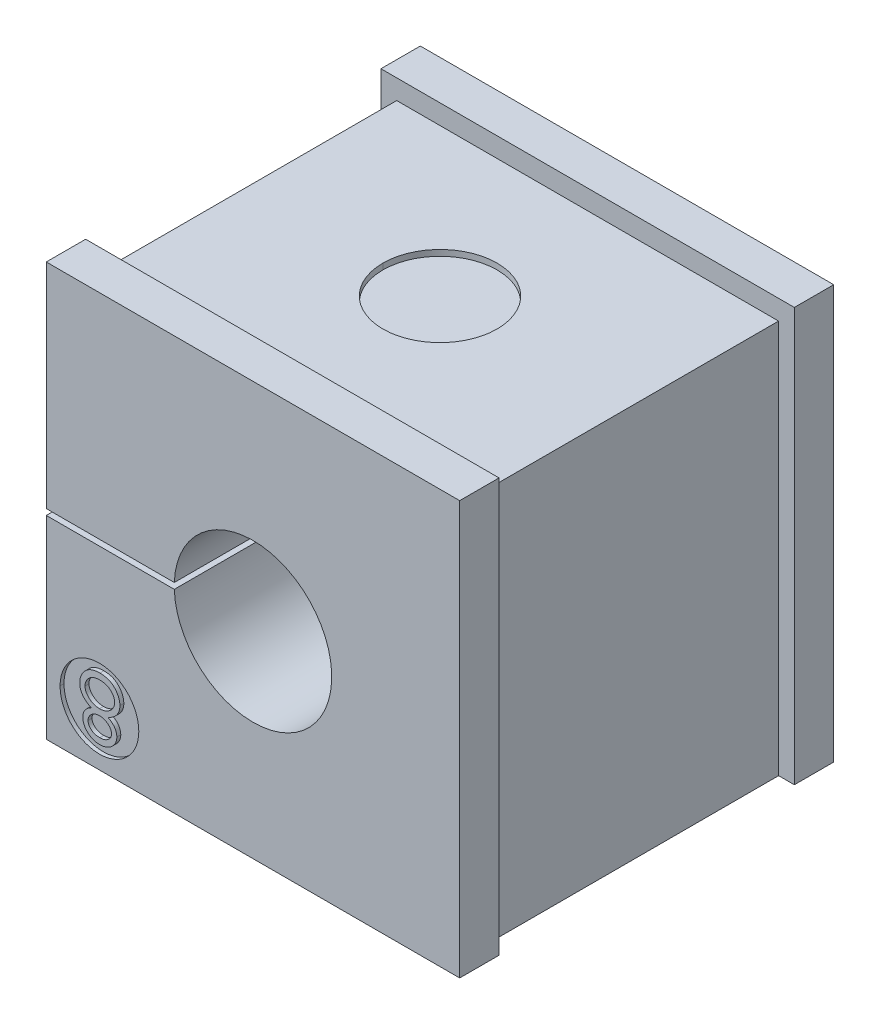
ISO-10303-21;
HEADER;
FILE_DESCRIPTION(('STEP AP214'),'2;1');
FILE_NAME('part.step','',(''),(''),'','','');
FILE_SCHEMA(('AUTOMOTIVE_DESIGN { 1 0 10303 214 1 1 1 1 }'));
ENDSEC;
DATA;
#1=APPLICATION_CONTEXT('core data for automotive mechanical design processes');
#2=APPLICATION_PROTOCOL_DEFINITION('international standard','automotive_design',2000,#1);
#3=PRODUCT_CONTEXT('',#1,'mechanical');
#4=PRODUCT('Part','Part','',(#3));
#5=PRODUCT_RELATED_PRODUCT_CATEGORY('part','',(#4));
#6=PRODUCT_DEFINITION_FORMATION('','',#4);
#7=PRODUCT_DEFINITION_CONTEXT('part definition',#1,'design');
#8=PRODUCT_DEFINITION('design','',#6,#7);
#9=PRODUCT_DEFINITION_SHAPE('','',#8);
#10=(LENGTH_UNIT() NAMED_UNIT(*) SI_UNIT(.MILLI.,.METRE.));
#11=(NAMED_UNIT(*) PLANE_ANGLE_UNIT() SI_UNIT($,.RADIAN.));
#12=(NAMED_UNIT(*) SI_UNIT($,.STERADIAN.) SOLID_ANGLE_UNIT());
#13=UNCERTAINTY_MEASURE_WITH_UNIT(LENGTH_MEASURE(1.E-05),#10,'distance_accuracy_value','');
#14=(GEOMETRIC_REPRESENTATION_CONTEXT(3) GLOBAL_UNCERTAINTY_ASSIGNED_CONTEXT((#13)) GLOBAL_UNIT_ASSIGNED_CONTEXT((#10,
#11,#12)) REPRESENTATION_CONTEXT('',''));
#15=CARTESIAN_POINT('',(0.,0.,0.));
#16=DIRECTION('',(0.,0.,1.));
#17=DIRECTION('',(1.,0.,0.));
#18=AXIS2_PLACEMENT_3D('',#15,#16,#17);
#19=CARTESIAN_POINT('',(10.5,9.2,0.));
#20=DIRECTION('',(0.,1.,0.));
#21=DIRECTION('',(1.,0.,0.));
#22=AXIS2_PLACEMENT_3D('',#19,#20,#21);
#23=PLANE('',#22);
#24=CARTESIAN_POINT('',(10.50000000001,9.20000000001,1.0001734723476E-11));
#25=DIRECTION('',(0.,1.,0.));
#26=DIRECTION('',(-1.,0.,0.));
#27=AXIS2_PLACEMENT_3D('',#24,#25,#26);
#28=CIRCLE('',#27,2.9);
#29=CARTESIAN_POINT('',(7.60000000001,9.20000000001,1.0001734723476E-11));
#30=VERTEX_POINT('',#29);
#31=CARTESIAN_POINT('',(13.4,9.20000000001,-4.9973776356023E-12));
#32=VERTEX_POINT('',#31);
#33=EDGE_CURVE('E11',#30,#32,#28,.T.);
#34=ORIENTED_EDGE('',*,*,#33,.T.);
#35=CARTESIAN_POINT('',(10.50000000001,9.20000000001,1.0001734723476E-11));
#36=DIRECTION('',(0.,1.,0.));
#37=DIRECTION('',(-1.,0.,0.));
#38=AXIS2_PLACEMENT_3D('',#35,#36,#37);
#39=CIRCLE('',#38,2.9);
#40=EDGE_CURVE('E24',#32,#30,#39,.T.);
#41=ORIENTED_EDGE('',*,*,#40,.T.);
#42=EDGE_LOOP('',(#34,#41));
#43=FACE_BOUND('',#42,.T.);
#44=ADVANCED_FACE('F16',(#43),#23,.T.);
#45=CARTESIAN_POINT('',(10.5,9.2,0.));
#46=DIRECTION('',(0.,1.,0.));
#47=DIRECTION('',(0.,0.,1.));
#48=AXIS2_PLACEMENT_3D('',#45,#46,#47);
#49=CYLINDRICAL_SURFACE('',#48,2.9);
#50=DIRECTION('',(0.,1.,0.));
#51=VECTOR('',#50,1.);
#52=CARTESIAN_POINT('',(13.4,9.20000000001,-4.9973776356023E-12));
#53=LINE('',#52,#51);
#54=CARTESIAN_POINT('',(13.40000000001,9.50000000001,1.0001734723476E-11));
#55=VERTEX_POINT('',#54);
#56=EDGE_CURVE('E1928',#32,#55,#53,.T.);
#57=ORIENTED_EDGE('',*,*,#56,.T.);
#58=CARTESIAN_POINT('',(10.50000000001,9.50000000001,1.0001734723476E-11));
#59=DIRECTION('',(0.,-1.,0.));
#60=DIRECTION('',(1.,0.,0.));
#61=AXIS2_PLACEMENT_3D('',#58,#59,#60);
#62=CIRCLE('',#61,2.9);
#63=CARTESIAN_POINT('',(7.6,9.50000000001,0.));
#64=VERTEX_POINT('',#63);
#65=EDGE_CURVE('E1923',#64,#55,#62,.T.);
#66=ORIENTED_EDGE('',*,*,#65,.F.);
#67=DIRECTION('',(0.,1.,0.));
#68=VECTOR('',#67,1.);
#69=CARTESIAN_POINT('',(7.6,9.20000000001,0.));
#70=LINE('',#69,#68);
#71=EDGE_CURVE('E1918',#30,#64,#70,.T.);
#72=ORIENTED_EDGE('',*,*,#71,.F.);
#73=ORIENTED_EDGE('',*,*,#40,.F.);
#74=EDGE_LOOP('',(#57,#66,#72,#73));
#75=FACE_BOUND('',#74,.T.);
#76=ADVANCED_FACE('F780',(#75),#49,.F.);
#77=CARTESIAN_POINT('',(10.5,9.2,0.));
#78=DIRECTION('',(0.,1.,0.));
#79=DIRECTION('',(-8.61816344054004E-13,0.,-1.));
#80=AXIS2_PLACEMENT_3D('',#77,#78,#79);
#81=CYLINDRICAL_SURFACE('',#80,2.9);
#82=ORIENTED_EDGE('',*,*,#56,.F.);
#83=ORIENTED_EDGE('',*,*,#33,.F.);
#84=ORIENTED_EDGE('',*,*,#71,.T.);
#85=CARTESIAN_POINT('',(10.50000000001,9.50000000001,1.0001734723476E-11));
#86=DIRECTION('',(0.,-1.,0.));
#87=DIRECTION('',(1.,0.,0.));
#88=AXIS2_PLACEMENT_3D('',#85,#86,#87);
#89=CIRCLE('',#88,2.9);
#90=EDGE_CURVE('E1913',#55,#64,#89,.T.);
#91=ORIENTED_EDGE('',*,*,#90,.F.);
#92=EDGE_LOOP('',(#82,#83,#84,#91));
#93=FACE_BOUND('',#92,.T.);
#94=ADVANCED_FACE('F784',(#93),#81,.F.);
#95=CARTESIAN_POINT('',(0.,9.5,7.5));
#96=DIRECTION('',(0.,-1.,0.));
#97=DIRECTION('',(0.,0.,-1.));
#98=AXIS2_PLACEMENT_3D('',#95,#96,#97);
#99=PLANE('',#98);
#100=DIRECTION('',(1.,0.,0.));
#101=VECTOR('',#100,1.);
#102=CARTESIAN_POINT('',(-1.0003469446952E-11,9.50000000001,7.50000000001));
#103=LINE('',#102,#101);
#104=CARTESIAN_POINT('',(0.8,9.5,7.5));
#105=VERTEX_POINT('',#104);
#106=CARTESIAN_POINT('',(20.2,9.5,7.5));
#107=VERTEX_POINT('',#106);
#108=EDGE_CURVE('E1909',#105,#107,#103,.T.);
#109=ORIENTED_EDGE('',*,*,#108,.T.);
#110=DIRECTION('',(0.,0.,1.));
#111=VECTOR('',#110,1.);
#112=CARTESIAN_POINT('',(20.20000000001,9.50000000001,-5.50000000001));
#113=LINE('',#112,#111);
#114=CARTESIAN_POINT('',(20.2,9.5,-7.5));
#115=VERTEX_POINT('',#114);
#116=EDGE_CURVE('E1904',#115,#107,#113,.T.);
#117=ORIENTED_EDGE('',*,*,#116,.F.);
#118=DIRECTION('',(1.,0.,0.));
#119=VECTOR('',#118,1.);
#120=CARTESIAN_POINT('',(-1.0003469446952E-11,9.50000000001,-7.50000000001));
#121=LINE('',#120,#119);
#122=CARTESIAN_POINT('',(0.8,9.5,-7.5));
#123=VERTEX_POINT('',#122);
#124=EDGE_CURVE('E1899',#123,#115,#121,.T.);
#125=ORIENTED_EDGE('',*,*,#124,.F.);
#126=DIRECTION('',(0.,0.,-1.));
#127=VECTOR('',#126,1.);
#128=CARTESIAN_POINT('',(0.800000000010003,9.50000000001,1.75000000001));
#129=LINE('',#128,#127);
#130=EDGE_CURVE('E1894',#105,#123,#129,.T.);
#131=ORIENTED_EDGE('',*,*,#130,.F.);
#132=EDGE_LOOP('',(#109,#117,#125,#131));
#133=FACE_BOUND('',#132,.T.);
#134=ORIENTED_EDGE('',*,*,#90,.T.);
#135=ORIENTED_EDGE('',*,*,#65,.T.);
#136=EDGE_LOOP('',(#134,#135));
#137=FACE_BOUND('',#136,.T.);
#138=ADVANCED_FACE('F789',(#133,#137),#99,.F.);
#139=CARTESIAN_POINT('',(0.8,0.,1.75));
#140=DIRECTION('',(1.,0.,0.));
#141=DIRECTION('',(0.,1.,0.));
#142=AXIS2_PLACEMENT_3D('',#139,#140,#141);
#143=PLANE('',#142);
#144=DIRECTION('',(0.,-1.,0.));
#145=VECTOR('',#144,1.);
#146=CARTESIAN_POINT('',(0.800000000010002,9.50000000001,-7.50000000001));
#147=LINE('',#146,#145);
#148=CARTESIAN_POINT('',(0.8,-0.35,-7.5));
#149=VERTEX_POINT('',#148);
#150=EDGE_CURVE('E1890',#123,#149,#147,.T.);
#151=ORIENTED_EDGE('',*,*,#150,.T.);
#152=DIRECTION('',(0.,0.,1.));
#153=VECTOR('',#152,1.);
#154=CARTESIAN_POINT('',(0.800000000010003,-0.350000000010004,1.75000000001));
#155=LINE('',#154,#153);
#156=CARTESIAN_POINT('',(0.8,-0.35,7.5));
#157=VERTEX_POINT('',#156);
#158=EDGE_CURVE('E1886',#149,#157,#155,.T.);
#159=ORIENTED_EDGE('',*,*,#158,.T.);
#160=DIRECTION('',(0.,1.,0.));
#161=VECTOR('',#160,1.);
#162=CARTESIAN_POINT('',(0.800000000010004,9.50000000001,7.50000000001));
#163=LINE('',#162,#161);
#164=EDGE_CURVE('E1881',#157,#105,#163,.T.);
#165=ORIENTED_EDGE('',*,*,#164,.T.);
#166=ORIENTED_EDGE('',*,*,#130,.T.);
#167=EDGE_LOOP('',(#151,#159,#165,#166));
#168=FACE_BOUND('',#167,.T.);
#169=ADVANCED_FACE('F795',(#168),#143,.F.);
#170=CARTESIAN_POINT('',(1.3,0.,7.5));
#171=DIRECTION('',(0.,0.,1.));
#172=DIRECTION('',(1.,0.,0.));
#173=AXIS2_PLACEMENT_3D('',#170,#171,#172);
#174=PLANE('',#173);
#175=ORIENTED_EDGE('',*,*,#164,.F.);
#176=DIRECTION('',(-1.,0.,0.));
#177=VECTOR('',#176,1.);
#178=CARTESIAN_POINT('',(1.30000000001,-0.350000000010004,7.50000000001));
#179=LINE('',#178,#177);
#180=CARTESIAN_POINT('',(0.,-0.35,7.5));
#181=VERTEX_POINT('',#180);
#182=EDGE_CURVE('E1877',#157,#181,#179,.T.);
#183=ORIENTED_EDGE('',*,*,#182,.T.);
#184=DIRECTION('',(0.,1.,0.));
#185=VECTOR('',#184,1.);
#186=CARTESIAN_POINT('',(1.00018371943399E-11,0.,7.50000000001));
#187=LINE('',#186,#185);
#188=CARTESIAN_POINT('',(0.,10.5,7.5));
#189=VERTEX_POINT('',#188);
#190=EDGE_CURVE('E1873',#181,#189,#187,.T.);
#191=ORIENTED_EDGE('',*,*,#190,.T.);
#192=DIRECTION('',(1.,0.,0.));
#193=VECTOR('',#192,1.);
#194=CARTESIAN_POINT('',(1.30000000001,10.50000000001,7.50000000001));
#195=LINE('',#194,#193);
#196=CARTESIAN_POINT('',(21.,10.5,7.5));
#197=VERTEX_POINT('',#196);
#198=EDGE_CURVE('E1869',#189,#197,#195,.T.);
#199=ORIENTED_EDGE('',*,*,#198,.T.);
#200=DIRECTION('',(0.,1.,0.));
#201=VECTOR('',#200,1.);
#202=CARTESIAN_POINT('',(21.00000000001,-10.50000000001,7.50000000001));
#203=LINE('',#202,#201);
#204=CARTESIAN_POINT('',(21.,-10.5,7.5));
#205=VERTEX_POINT('',#204);
#206=EDGE_CURVE('E1864',#205,#197,#203,.T.);
#207=ORIENTED_EDGE('',*,*,#206,.F.);
#208=DIRECTION('',(-1.,0.,0.));
#209=VECTOR('',#208,1.);
#210=CARTESIAN_POINT('',(19.70000000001,-10.50000000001,7.50000000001));
#211=LINE('',#210,#209);
#212=CARTESIAN_POINT('',(20.2,-10.5,7.5));
#213=VERTEX_POINT('',#212);
#214=EDGE_CURVE('E1860',#205,#213,#211,.T.);
#215=ORIENTED_EDGE('',*,*,#214,.T.);
#216=DIRECTION('',(0.,-1.,0.));
#217=VECTOR('',#216,1.);
#218=CARTESIAN_POINT('',(20.20000000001,9.50000000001,7.50000000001));
#219=LINE('',#218,#217);
#220=EDGE_CURVE('E1855',#107,#213,#219,.T.);
#221=ORIENTED_EDGE('',*,*,#220,.F.);
#222=ORIENTED_EDGE('',*,*,#108,.F.);
#223=EDGE_LOOP('',(#175,#183,#191,#199,#207,#215,#221,#222));
#224=FACE_BOUND('',#223,.T.);
#225=ADVANCED_FACE('F799',(#224),#174,.F.);
#226=CARTESIAN_POINT('',(20.2,-10.5,-5.5));
#227=DIRECTION('',(1.,0.,0.));
#228=DIRECTION('',(0.,1.,0.));
#229=AXIS2_PLACEMENT_3D('',#226,#227,#228);
#230=PLANE('',#229);
#231=DIRECTION('',(0.,0.,-1.));
#232=VECTOR('',#231,1.);
#233=CARTESIAN_POINT('',(20.20000000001,-10.50000000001,1.75000000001));
#234=LINE('',#233,#232);
#235=CARTESIAN_POINT('',(20.2,-10.5,-7.5));
#236=VERTEX_POINT('',#235);
#237=EDGE_CURVE('E1851',#213,#236,#234,.T.);
#238=ORIENTED_EDGE('',*,*,#237,.T.);
#239=DIRECTION('',(0.,1.,0.));
#240=VECTOR('',#239,1.);
#241=CARTESIAN_POINT('',(20.20000000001,9.50000000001,-7.50000000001));
#242=LINE('',#241,#240);
#243=EDGE_CURVE('E1846',#236,#115,#242,.T.);
#244=ORIENTED_EDGE('',*,*,#243,.T.);
#245=ORIENTED_EDGE('',*,*,#116,.T.);
#246=ORIENTED_EDGE('',*,*,#220,.T.);
#247=EDGE_LOOP('',(#238,#244,#245,#246));
#248=FACE_BOUND('',#247,.T.);
#249=ADVANCED_FACE('F803',(#248),#230,.T.);
#250=CARTESIAN_POINT('',(0.,0.,-7.5));
#251=DIRECTION('',(0.,0.,-1.));
#252=DIRECTION('',(-1.,0.,0.));
#253=AXIS2_PLACEMENT_3D('',#250,#251,#252);
#254=PLANE('',#253);
#255=DIRECTION('',(0.,1.,0.));
#256=VECTOR('',#255,1.);
#257=CARTESIAN_POINT('',(1.00000002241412E-11,0.,-7.50000000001));
#258=LINE('',#257,#256);
#259=CARTESIAN_POINT('',(0.,-0.35,-7.5));
#260=VERTEX_POINT('',#259);
#261=CARTESIAN_POINT('',(0.,10.5,-7.5));
#262=VERTEX_POINT('',#261);
#263=EDGE_CURVE('E1841',#260,#262,#258,.T.);
#264=ORIENTED_EDGE('',*,*,#263,.F.);
#265=DIRECTION('',(1.,0.,0.));
#266=VECTOR('',#265,1.);
#267=CARTESIAN_POINT('',(-1.00000023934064E-11,-0.350000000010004,-7.50000000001));
#268=LINE('',#267,#266);
#269=EDGE_CURVE('E1829',#260,#149,#268,.T.);
#270=ORIENTED_EDGE('',*,*,#269,.T.);
#271=ORIENTED_EDGE('',*,*,#150,.F.);
#272=ORIENTED_EDGE('',*,*,#124,.T.);
#273=ORIENTED_EDGE('',*,*,#243,.F.);
#274=DIRECTION('',(1.,0.,0.));
#275=VECTOR('',#274,1.);
#276=CARTESIAN_POINT('',(21.00000000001,-10.50000000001,-7.50000000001));
#277=LINE('',#276,#275);
#278=CARTESIAN_POINT('',(21.,-10.5,-7.5));
#279=VERTEX_POINT('',#278);
#280=EDGE_CURVE('E1826',#236,#279,#277,.T.);
#281=ORIENTED_EDGE('',*,*,#280,.T.);
#282=DIRECTION('',(0.,1.,0.));
#283=VECTOR('',#282,1.);
#284=CARTESIAN_POINT('',(21.00000000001,-10.50000000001,-7.50000000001));
#285=LINE('',#284,#283);
#286=CARTESIAN_POINT('',(21.,10.5,-7.5));
#287=VERTEX_POINT('',#286);
#288=EDGE_CURVE('E1821',#279,#287,#285,.T.);
#289=ORIENTED_EDGE('',*,*,#288,.T.);
#290=DIRECTION('',(-1.,0.,0.));
#291=VECTOR('',#290,1.);
#292=CARTESIAN_POINT('',(1.00000002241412E-11,10.50000000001,-7.50000000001));
#293=LINE('',#292,#291);
#294=EDGE_CURVE('E1827',#287,#262,#293,.T.);
#295=ORIENTED_EDGE('',*,*,#294,.T.);
#296=EDGE_LOOP('',(#264,#270,#271,#272,#273,#281,#289,#295));
#297=FACE_BOUND('',#296,.T.);
#298=ADVANCED_FACE('F807',(#297),#254,.F.);
#299=CARTESIAN_POINT('',(0.,10.5,9.5));
#300=DIRECTION('',(0.,-1.,0.));
#301=DIRECTION('',(0.,0.,-1.));
#302=AXIS2_PLACEMENT_3D('',#299,#300,#301);
#303=PLANE('',#302);
#304=ORIENTED_EDGE('',*,*,#294,.F.);
#305=DIRECTION('',(0.,0.,-1.));
#306=VECTOR('',#305,1.);
#307=CARTESIAN_POINT('',(21.00000000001,10.50000000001,9.50000000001));
#308=LINE('',#307,#306);
#309=CARTESIAN_POINT('',(21.,10.5,-9.5));
#310=VERTEX_POINT('',#309);
#311=EDGE_CURVE('E1824',#287,#310,#308,.T.);
#312=ORIENTED_EDGE('',*,*,#311,.T.);
#313=DIRECTION('',(-1.,0.,0.));
#314=VECTOR('',#313,1.);
#315=CARTESIAN_POINT('',(0.,10.50000000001,-9.50000000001));
#316=LINE('',#315,#314);
#317=CARTESIAN_POINT('',(0.,10.5,-9.5));
#318=VERTEX_POINT('',#317);
#319=EDGE_CURVE('E1976',#310,#318,#316,.T.);
#320=ORIENTED_EDGE('',*,*,#319,.T.);
#321=DIRECTION('',(0.,0.,-1.));
#322=VECTOR('',#321,1.);
#323=CARTESIAN_POINT('',(0.,10.50000000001,9.50000000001));
#324=LINE('',#323,#322);
#325=EDGE_CURVE('E1980',#262,#318,#324,.T.);
#326=ORIENTED_EDGE('',*,*,#325,.F.);
#327=EDGE_LOOP('',(#304,#312,#320,#326));
#328=FACE_BOUND('',#327,.T.);
#329=ADVANCED_FACE('F811',(#328),#303,.F.);
#330=CARTESIAN_POINT('',(0.,0.,9.5));
#331=DIRECTION('',(1.,0.,0.));
#332=DIRECTION('',(0.,1.,0.));
#333=AXIS2_PLACEMENT_3D('',#330,#331,#332);
#334=PLANE('',#333);
#335=DIRECTION('',(0.,-1.,0.));
#336=VECTOR('',#335,1.);
#337=CARTESIAN_POINT('',(0.,0.,-9.50000000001));
#338=LINE('',#337,#336);
#339=CARTESIAN_POINT('',(0.,-0.35,-9.5));
#340=VERTEX_POINT('',#339);
#341=EDGE_CURVE('E1977',#318,#340,#338,.T.);
#342=ORIENTED_EDGE('',*,*,#341,.T.);
#343=DIRECTION('',(0.,0.,1.));
#344=VECTOR('',#343,1.);
#345=CARTESIAN_POINT('',(-1.00001592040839E-11,-0.350000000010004,-9.50000000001));
#346=LINE('',#345,#344);
#347=EDGE_CURVE('E1994',#340,#260,#346,.T.);
#348=ORIENTED_EDGE('',*,*,#347,.T.);
#349=ORIENTED_EDGE('',*,*,#263,.T.);
#350=ORIENTED_EDGE('',*,*,#325,.T.);
#351=EDGE_LOOP('',(#342,#348,#349,#350));
#352=FACE_BOUND('',#351,.T.);
#353=ADVANCED_FACE('F815',(#352),#334,.F.);
#354=CARTESIAN_POINT('',(0.,-0.35,-9.5));
#355=DIRECTION('',(0.,1.,0.));
#356=DIRECTION('',(1.,0.,0.));
#357=AXIS2_PLACEMENT_3D('',#354,#355,#356);
#358=PLANE('',#357);
#359=DIRECTION('',(-1.,0.,0.));
#360=VECTOR('',#359,1.);
#361=CARTESIAN_POINT('',(-1.00001592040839E-11,-0.350000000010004,-9.50000000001));
#362=LINE('',#361,#360);
#363=CARTESIAN_POINT('',(6.50281348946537,-0.35,-9.5));
#364=VERTEX_POINT('',#363);
#365=EDGE_CURVE('E1999',#364,#340,#362,.T.);
#366=ORIENTED_EDGE('',*,*,#365,.F.);
#367=DIRECTION('',(0.,0.,-1.));
#368=VECTOR('',#367,1.);
#369=CARTESIAN_POINT('',(6.50281348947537,-0.350000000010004,-20.8137084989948));
#370=LINE('',#369,#368);
#371=CARTESIAN_POINT('',(6.50281348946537,-0.35,9.5));
#372=VERTEX_POINT('',#371);
#373=EDGE_CURVE('E300',#372,#364,#370,.T.);
#374=ORIENTED_EDGE('',*,*,#373,.F.);
#375=DIRECTION('',(-1.,0.,0.));
#376=VECTOR('',#375,1.);
#377=CARTESIAN_POINT('',(-1.00001592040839E-11,-0.350000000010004,9.50000000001));
#378=LINE('',#377,#376);
#379=CARTESIAN_POINT('',(0.,-0.35,9.5));
#380=VERTEX_POINT('',#379);
#381=EDGE_CURVE('E1956',#372,#380,#378,.T.);
#382=ORIENTED_EDGE('',*,*,#381,.T.);
#383=DIRECTION('',(0.,0.,1.));
#384=VECTOR('',#383,1.);
#385=CARTESIAN_POINT('',(-1.00001592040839E-11,-0.350000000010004,-9.50000000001));
#386=LINE('',#385,#384);
#387=EDGE_CURVE('E1954',#181,#380,#386,.T.);
#388=ORIENTED_EDGE('',*,*,#387,.F.);
#389=ORIENTED_EDGE('',*,*,#182,.F.);
#390=ORIENTED_EDGE('',*,*,#158,.F.);
#391=ORIENTED_EDGE('',*,*,#269,.F.);
#392=ORIENTED_EDGE('',*,*,#347,.F.);
#393=EDGE_LOOP('',(#366,#374,#382,#388,#389,#390,#391,#392));
#394=FACE_BOUND('',#393,.T.);
#395=ADVANCED_FACE('F819',(#394),#358,.F.);
#396=CARTESIAN_POINT('',(0.,0.,9.5));
#397=DIRECTION('',(1.,0.,0.));
#398=DIRECTION('',(0.,1.,0.));
#399=AXIS2_PLACEMENT_3D('',#396,#397,#398);
#400=PLANE('',#399);
#401=ORIENTED_EDGE('',*,*,#190,.F.);
#402=ORIENTED_EDGE('',*,*,#387,.T.);
#403=DIRECTION('',(0.,-1.,0.));
#404=VECTOR('',#403,1.);
#405=CARTESIAN_POINT('',(0.,0.,9.50000000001));
#406=LINE('',#405,#404);
#407=CARTESIAN_POINT('',(0.,10.5,9.5));
#408=VERTEX_POINT('',#407);
#409=EDGE_CURVE('E1958',#408,#380,#406,.T.);
#410=ORIENTED_EDGE('',*,*,#409,.F.);
#411=DIRECTION('',(0.,0.,-1.));
#412=VECTOR('',#411,1.);
#413=CARTESIAN_POINT('',(0.,10.50000000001,9.50000000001));
#414=LINE('',#413,#412);
#415=EDGE_CURVE('E1961',#408,#189,#414,.T.);
#416=ORIENTED_EDGE('',*,*,#415,.T.);
#417=EDGE_LOOP('',(#401,#402,#410,#416));
#418=FACE_BOUND('',#417,.T.);
#419=ADVANCED_FACE('F823',(#418),#400,.F.);
#420=CARTESIAN_POINT('',(0.,10.5,9.5));
#421=DIRECTION('',(0.,-1.,0.));
#422=DIRECTION('',(0.,0.,-1.));
#423=AXIS2_PLACEMENT_3D('',#420,#421,#422);
#424=PLANE('',#423);
#425=DIRECTION('',(0.,0.,-1.));
#426=VECTOR('',#425,1.);
#427=CARTESIAN_POINT('',(21.00000000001,10.50000000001,9.50000000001));
#428=LINE('',#427,#426);
#429=CARTESIAN_POINT('',(21.,10.5,9.5));
#430=VERTEX_POINT('',#429);
#431=EDGE_CURVE('E1964',#430,#197,#428,.T.);
#432=ORIENTED_EDGE('',*,*,#431,.T.);
#433=ORIENTED_EDGE('',*,*,#198,.F.);
#434=ORIENTED_EDGE('',*,*,#415,.F.);
#435=DIRECTION('',(-1.,0.,0.));
#436=VECTOR('',#435,1.);
#437=CARTESIAN_POINT('',(0.,10.50000000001,9.50000000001));
#438=LINE('',#437,#436);
#439=EDGE_CURVE('E2019',#430,#408,#438,.T.);
#440=ORIENTED_EDGE('',*,*,#439,.F.);
#441=EDGE_LOOP('',(#432,#433,#434,#440));
#442=FACE_BOUND('',#441,.T.);
#443=ADVANCED_FACE('F827',(#442),#424,.F.);
#444=CARTESIAN_POINT('',(0.,0.,9.5));
#445=DIRECTION('',(0.,0.,-1.));
#446=DIRECTION('',(0.,-1.,0.));
#447=AXIS2_PLACEMENT_3D('',#444,#445,#446);
#448=PLANE('',#447);
#449=ORIENTED_EDGE('',*,*,#409,.T.);
#450=ORIENTED_EDGE('',*,*,#381,.F.);
#451=CARTESIAN_POINT('',(10.50000000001,-0.500000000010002,9.50000000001));
#452=DIRECTION('',(0.,0.,1.));
#453=DIRECTION('',(1.,0.,0.));
#454=AXIS2_PLACEMENT_3D('',#451,#452,#453);
#455=CIRCLE('',#454,4.);
#456=CARTESIAN_POINT('',(6.50281348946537,-0.65,9.5));
#457=VERTEX_POINT('',#456);
#458=EDGE_CURVE('E2023',#457,#372,#455,.T.);
#459=ORIENTED_EDGE('',*,*,#458,.F.);
#460=DIRECTION('',(1.,0.,0.));
#461=VECTOR('',#460,1.);
#462=CARTESIAN_POINT('',(-1.0000067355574E-11,-0.650000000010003,9.50000000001));
#463=LINE('',#462,#461);
#464=CARTESIAN_POINT('',(0.,-0.65,9.5));
#465=VERTEX_POINT('',#464);
#466=EDGE_CURVE('E294',#465,#457,#463,.T.);
#467=ORIENTED_EDGE('',*,*,#466,.F.);
#468=DIRECTION('',(0.,-1.,0.));
#469=VECTOR('',#468,1.);
#470=CARTESIAN_POINT('',(0.,0.,9.50000000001));
#471=LINE('',#470,#469);
#472=CARTESIAN_POINT('',(0.,-10.5,9.5));
#473=VERTEX_POINT('',#472);
#474=EDGE_CURVE('E2030',#465,#473,#471,.T.);
#475=ORIENTED_EDGE('',*,*,#474,.T.);
#476=DIRECTION('',(-1.,0.,0.));
#477=VECTOR('',#476,1.);
#478=CARTESIAN_POINT('',(0.,-10.50000000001,9.50000000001));
#479=LINE('',#478,#477);
#480=CARTESIAN_POINT('',(21.,-10.5,9.5));
#481=VERTEX_POINT('',#480);
#482=EDGE_CURVE('E2034',#481,#473,#479,.T.);
#483=ORIENTED_EDGE('',*,*,#482,.F.);
#484=DIRECTION('',(0.,-1.,0.));
#485=VECTOR('',#484,1.);
#486=CARTESIAN_POINT('',(21.00000000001,1.0003469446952E-11,9.50000000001));
#487=LINE('',#486,#485);
#488=EDGE_CURVE('E1971',#430,#481,#487,.T.);
#489=ORIENTED_EDGE('',*,*,#488,.F.);
#490=ORIENTED_EDGE('',*,*,#439,.T.);
#491=EDGE_LOOP('',(#449,#450,#459,#467,#475,#483,#489,#490));
#492=FACE_BOUND('',#491,.T.);
#493=CARTESIAN_POINT('',(2.70000000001,-7.80000000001,9.50000000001));
#494=DIRECTION('',(0.,0.,1.));
#495=DIRECTION('',(1.,0.,0.));
#496=AXIS2_PLACEMENT_3D('',#493,#494,#495);
#497=CIRCLE('',#496,2.);
#498=CARTESIAN_POINT('',(0.7,-7.799999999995,9.50000000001));
#499=VERTEX_POINT('',#498);
#500=CARTESIAN_POINT('',(4.70000000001,-7.80000000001,9.50000000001));
#501=VERTEX_POINT('',#500);
#502=EDGE_CURVE('E2041',#499,#501,#497,.T.);
#503=ORIENTED_EDGE('',*,*,#502,.F.);
#504=CARTESIAN_POINT('',(2.70000000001,-7.80000000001,9.50000000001));
#505=DIRECTION('',(0.,0.,1.));
#506=DIRECTION('',(1.,0.,0.));
#507=AXIS2_PLACEMENT_3D('',#504,#505,#506);
#508=CIRCLE('',#507,2.);
#509=EDGE_CURVE('E2046',#501,#499,#508,.T.);
#510=ORIENTED_EDGE('',*,*,#509,.F.);
#511=EDGE_LOOP('',(#503,#510));
#512=FACE_BOUND('',#511,.T.);
#513=ADVANCED_FACE('F831',(#492,#512),#448,.F.);
#514=CARTESIAN_POINT('',(2.7,-7.8,9.3));
#515=DIRECTION('',(0.,0.,1.));
#516=DIRECTION('',(-3.75027214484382E-12,-1.,0.));
#517=AXIS2_PLACEMENT_3D('',#514,#515,#516);
#518=CYLINDRICAL_SURFACE('',#517,2.);
#519=DIRECTION('',(0.,0.,1.));
#520=VECTOR('',#519,1.);
#521=CARTESIAN_POINT('',(0.7,-7.799999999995,9.30000000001));
#522=LINE('',#521,#520);
#523=CARTESIAN_POINT('',(0.7,-7.799999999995,9.30000000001));
#524=VERTEX_POINT('',#523);
#525=EDGE_CURVE('E2051',#524,#499,#522,.T.);
#526=ORIENTED_EDGE('',*,*,#525,.F.);
#527=CARTESIAN_POINT('',(2.70000000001,-7.80000000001,9.30000000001));
#528=DIRECTION('',(0.,0.,1.));
#529=DIRECTION('',(1.,0.,0.));
#530=AXIS2_PLACEMENT_3D('',#527,#528,#529);
#531=CIRCLE('',#530,2.);
#532=CARTESIAN_POINT('',(4.70000000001,-7.80000000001,9.30000000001));
#533=VERTEX_POINT('',#532);
#534=EDGE_CURVE('E2056',#533,#524,#531,.T.);
#535=ORIENTED_EDGE('',*,*,#534,.F.);
#536=DIRECTION('',(0.,0.,1.));
#537=VECTOR('',#536,1.);
#538=CARTESIAN_POINT('',(4.7,-7.8,9.30000000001));
#539=LINE('',#538,#537);
#540=EDGE_CURVE('E2061',#533,#501,#539,.T.);
#541=ORIENTED_EDGE('',*,*,#540,.T.);
#542=ORIENTED_EDGE('',*,*,#509,.T.);
#543=EDGE_LOOP('',(#526,#535,#541,#542));
#544=FACE_BOUND('',#543,.T.);
#545=ADVANCED_FACE('F835',(#544),#518,.F.);
#546=CARTESIAN_POINT('',(2.7,-7.8,9.3));
#547=DIRECTION('',(0.,0.,1.));
#548=DIRECTION('',(1.25017235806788E-12,1.,0.));
#549=AXIS2_PLACEMENT_3D('',#546,#547,#548);
#550=CYLINDRICAL_SURFACE('',#549,2.);
#551=ORIENTED_EDGE('',*,*,#525,.T.);
#552=ORIENTED_EDGE('',*,*,#502,.T.);
#553=ORIENTED_EDGE('',*,*,#540,.F.);
#554=CARTESIAN_POINT('',(2.70000000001,-7.80000000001,9.30000000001));
#555=DIRECTION('',(0.,0.,1.));
#556=DIRECTION('',(1.,0.,0.));
#557=AXIS2_PLACEMENT_3D('',#554,#555,#556);
#558=CIRCLE('',#557,2.);
#559=EDGE_CURVE('E2066',#524,#533,#558,.T.);
#560=ORIENTED_EDGE('',*,*,#559,.F.);
#561=EDGE_LOOP('',(#551,#552,#553,#560));
#562=FACE_BOUND('',#561,.T.);
#563=ADVANCED_FACE('F839',(#562),#550,.F.);
#564=CARTESIAN_POINT('',(2.7,-7.8,9.3));
#565=DIRECTION('',(0.,0.,1.));
#566=DIRECTION('',(1.,0.,0.));
#567=AXIS2_PLACEMENT_3D('',#564,#565,#566);
#568=PLANE('',#567);
#569=ORIENTED_EDGE('',*,*,#534,.T.);
#570=ORIENTED_EDGE('',*,*,#559,.T.);
#571=EDGE_LOOP('',(#569,#570));
#572=FACE_BOUND('',#571,.T.);
#573=CARTESIAN_POINT('',(2.27992788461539,-7.97127403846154,9.30000000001));
#574=CARTESIAN_POINT('',(2.24617969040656,-7.99033093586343,9.30000000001));
#575=CARTESIAN_POINT('',(2.18089695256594,-8.02719472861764,9.30000000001));
#576=CARTESIAN_POINT('',(2.09416809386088,-8.09335563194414,9.30000000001));
#577=CARTESIAN_POINT('',(2.01978339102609,-8.16382304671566,9.30000000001));
#578=CARTESIAN_POINT('',(1.95870807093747,-8.2399751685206,9.30000000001));
#579=CARTESIAN_POINT('',(1.91217530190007,-8.32219019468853,9.30000000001));
#580=CARTESIAN_POINT('',(1.87768111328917,-8.40915433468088,9.30000000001));
#581=CARTESIAN_POINT('',(1.85751273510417,-8.50220577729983,9.30000000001));
#582=CARTESIAN_POINT('',(1.85508321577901,-8.56612931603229,9.30000000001));
#583=CARTESIAN_POINT('',(1.85384615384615,-8.59867788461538,9.30000000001));
#584=B_SPLINE_CURVE_WITH_KNOTS('',3,(#573,#574,#575,#576,#577,#578,#579,#580,#581,#582,#583),
.UNSPECIFIED.,.F.,.F.,(4,1,1,1,1,1,1,1,4),(0.,0.145142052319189,0.280763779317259,
0.407699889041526,0.528496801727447,0.645205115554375,0.760530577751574,0.878067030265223,1.),.UNSPECIFIED.);
#585=CARTESIAN_POINT('',(1.85384615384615,-8.59867788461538,9.3));
#586=VERTEX_POINT('',#585);
#587=CARTESIAN_POINT('',(2.27992788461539,-7.97127403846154,9.3));
#588=VERTEX_POINT('',#587);
#589=EDGE_CURVE('E917',#586,#588,#584,.F.);
#590=ORIENTED_EDGE('',*,*,#589,.T.);
#591=CARTESIAN_POINT('',(1.7,-7.17379807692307,9.30000000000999));
#592=CARTESIAN_POINT('',(1.70055930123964,-7.19444276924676,9.30000000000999));
#593=CARTESIAN_POINT('',(1.70166391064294,-7.23521564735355,9.30000000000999));
#594=CARTESIAN_POINT('',(1.70750762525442,-7.29554473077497,9.30000000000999));
#595=CARTESIAN_POINT('',(1.71837004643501,-7.35425859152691,9.30000000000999));
#596=CARTESIAN_POINT('',(1.73416895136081,-7.41096257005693,9.30000000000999));
#597=CARTESIAN_POINT('',(1.75330488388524,-7.46641753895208,9.30000000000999));
#598=CARTESIAN_POINT('',(1.77768573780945,-7.51986273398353,9.30000000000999));
#599=CARTESIAN_POINT('',(1.80562153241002,-7.57210956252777,9.30000000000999));
#600=CARTESIAN_POINT('',(1.83859880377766,-7.62240304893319,9.30000000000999));
#601=CARTESIAN_POINT('',(1.875766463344,-7.67136304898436,9.30000000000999));
#602=CARTESIAN_POINT('',(1.91887411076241,-7.71811890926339,9.30000000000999));
#603=CARTESIAN_POINT('',(1.9664408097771,-7.76387263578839,9.30000000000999));
#604=CARTESIAN_POINT('',(2.01897811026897,-7.80847952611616,9.30000000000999));
#605=CARTESIAN_POINT('',(2.07664769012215,-7.85182154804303,9.30000000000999));
#606=CARTESIAN_POINT('',(2.14001494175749,-7.89297740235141,9.30000000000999));
#607=CARTESIAN_POINT('',(2.20790784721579,-7.93342680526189,9.30000000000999));
#608=CARTESIAN_POINT('',(2.25556744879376,-7.95847239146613,9.30000000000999));
#609=CARTESIAN_POINT('',(2.27992788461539,-7.97127403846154,9.30000000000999));
#610=B_SPLINE_CURVE_WITH_KNOTS('',3,(#591,#592,#593,#594,#595,#596,#597,#598,#599,#600,#601,
#602,#603,#604,#605,#606,#607,#608,#609),.UNSPECIFIED.,.F.,.F.,(4,1,1,1,1,1,1,1,1,1,1,1,1,1,1,1,
4),(0.,0.0592962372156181,0.117108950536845,0.173861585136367,0.230520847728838,
0.286011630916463,0.342142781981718,0.39902646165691,0.455988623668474,0.514667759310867,
0.57534316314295,0.638404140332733,0.704107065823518,0.773138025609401,0.845414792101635,
0.920986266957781,1.),.UNSPECIFIED.);
#611=CARTESIAN_POINT('',(1.7,-7.17379807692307,9.3));
#612=VERTEX_POINT('',#611);
#613=EDGE_CURVE('E914',#588,#612,#610,.F.);
#614=ORIENTED_EDGE('',*,*,#613,.T.);
#615=CARTESIAN_POINT('',(1.92716346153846,-6.55240384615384,9.30000000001));
#616=CARTESIAN_POINT('',(1.90883447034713,-6.57487711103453,9.30000000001));
#617=CARTESIAN_POINT('',(1.87261101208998,-6.61929086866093,9.30000000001));
#618=CARTESIAN_POINT('',(1.82756873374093,-6.69149985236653,9.30000000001));
#619=CARTESIAN_POINT('',(1.78765990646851,-6.76499019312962,9.30000000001));
#620=CARTESIAN_POINT('',(1.75603311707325,-6.84187146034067,9.30000000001));
#621=CARTESIAN_POINT('',(1.73033172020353,-6.92110785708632,9.30000000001));
#622=CARTESIAN_POINT('',(1.71341284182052,-7.00337449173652,9.30000000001));
#623=CARTESIAN_POINT('',(1.70195897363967,-7.08773877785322,9.30000000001));
#624=CARTESIAN_POINT('',(1.70065751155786,-7.14491306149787,9.30000000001));
#625=CARTESIAN_POINT('',(1.7,-7.17379807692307,9.30000000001));
#626=B_SPLINE_CURVE_WITH_KNOTS('',3,(#615,#616,#617,#618,#619,#620,#621,#622,#623,#624,#625),
.UNSPECIFIED.,.F.,.F.,(4,1,1,1,1,1,1,1,4),(0.,0.128610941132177,0.254172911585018,
0.377099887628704,0.499475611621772,0.622656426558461,0.746314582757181,0.871835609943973,1.),.UNSPECIFIED.);
#627=CARTESIAN_POINT('',(1.92716346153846,-6.55240384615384,9.3));
#628=VERTEX_POINT('',#627);
#629=EDGE_CURVE('E904',#612,#628,#626,.F.);
#630=ORIENTED_EDGE('',*,*,#629,.T.);
#631=CARTESIAN_POINT('',(2.7234375,-6.22307692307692,9.30000000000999));
#632=CARTESIAN_POINT('',(2.68152915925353,-6.22417799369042,9.30000000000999));
#633=CARTESIAN_POINT('',(2.59983875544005,-6.22632427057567,9.30000000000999));
#634=CARTESIAN_POINT('',(2.48098376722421,-6.24117206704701,9.30000000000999));
#635=CARTESIAN_POINT('',(2.36963919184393,-6.26709422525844,9.30000000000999));
#636=CARTESIAN_POINT('',(2.26558796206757,-6.30316781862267,9.30000000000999));
#637=CARTESIAN_POINT('',(2.16885224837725,-6.34951515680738,9.30000000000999));
#638=CARTESIAN_POINT('',(2.07969063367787,-6.40638606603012,9.30000000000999));
#639=CARTESIAN_POINT('',(1.99844812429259,-6.47405818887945,9.30000000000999));
#640=CARTESIAN_POINT('',(1.95102329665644,-6.52618061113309,9.30000000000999));
#641=CARTESIAN_POINT('',(1.92716346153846,-6.55240384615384,9.30000000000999));
#642=B_SPLINE_CURVE_WITH_KNOTS('',3,(#631,#632,#633,#634,#635,#636,#637,#638,#639,#640,#641),
.UNSPECIFIED.,.F.,.F.,(4,1,1,1,1,1,1,1,4),(0.,0.141116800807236,0.275073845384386,
0.402539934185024,0.525423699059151,0.645203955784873,0.76290711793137,0.880716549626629,1.),.UNSPECIFIED.);
#643=CARTESIAN_POINT('',(2.7234375,-6.22307692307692,9.3));
#644=VERTEX_POINT('',#643);
#645=EDGE_CURVE('E937',#628,#644,#642,.F.);
#646=ORIENTED_EDGE('',*,*,#645,.T.);
#647=CARTESIAN_POINT('',(3.73846153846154,-7.14915865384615,9.30000000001));
#648=CARTESIAN_POINT('',(3.73762231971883,-7.12047058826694,9.30000000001));
#649=CARTESIAN_POINT('',(3.73595413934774,-7.06344508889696,9.30000000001));
#650=CARTESIAN_POINT('',(3.72348129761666,-6.9789314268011,9.30000000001));
#651=CARTESIAN_POINT('',(3.70362449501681,-6.89599317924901,9.30000000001));
#652=CARTESIAN_POINT('',(3.67562822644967,-6.81486596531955,9.30000000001));
#653=CARTESIAN_POINT('',(3.63800864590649,-6.73638233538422,9.30000000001));
#654=CARTESIAN_POINT('',(3.59436237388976,-6.65895204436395,9.30000000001));
#655=CARTESIAN_POINT('',(3.54155361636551,-6.58375288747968,9.30000000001));
#656=CARTESIAN_POINT('',(3.48148880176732,-6.51083959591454,9.30000000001));
#657=CARTESIAN_POINT('',(3.41381434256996,-6.44277934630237,9.30000000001));
#658=CARTESIAN_POINT('',(3.33704958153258,-6.38426617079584,9.30000000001));
#659=CARTESIAN_POINT('',(3.25360272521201,-6.33389188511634,9.30000000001));
#660=CARTESIAN_POINT('',(3.16225070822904,-6.2927937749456,9.30000000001));
#661=CARTESIAN_POINT('',(3.06282743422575,-6.26197459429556,9.30000000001));
#662=CARTESIAN_POINT('',(2.95629429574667,-6.23898210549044,9.30000000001));
#663=CARTESIAN_POINT('',(2.84214619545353,-6.22599480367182,9.30000000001));
#664=CARTESIAN_POINT('',(2.76373376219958,-6.22406741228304,9.30000000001));
#665=CARTESIAN_POINT('',(2.7234375,-6.22307692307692,9.30000000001));
#666=B_SPLINE_CURVE_WITH_KNOTS('',3,(#647,#648,#649,#650,#651,#652,#653,#654,#655,#656,#657,
#658,#659,#660,#661,#662,#663,#664,#665),.UNSPECIFIED.,.F.,.F.,(4,1,1,1,1,1,1,1,1,1,1,1,1,1,1,1,
4),(0.,0.055909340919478,0.111135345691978,0.16616494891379,0.22198693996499,0.278063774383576,
0.335606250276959,0.395078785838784,0.456928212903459,0.519610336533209,0.581705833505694,
0.644591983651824,0.709261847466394,0.776447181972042,0.847141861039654,0.921445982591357,1.),.UNSPECIFIED.);
#667=CARTESIAN_POINT('',(3.73846153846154,-7.14915865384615,9.3));
#668=VERTEX_POINT('',#667);
#669=EDGE_CURVE('E1197',#644,#668,#666,.F.);
#670=ORIENTED_EDGE('',*,*,#669,.T.);
#671=CARTESIAN_POINT('',(3.14651442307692,-7.97127403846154,9.30000000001));
#672=CARTESIAN_POINT('',(3.17193249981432,-7.9581687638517,9.30000000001));
#673=CARTESIAN_POINT('',(3.22148236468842,-7.93262141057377,9.30000000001));
#674=CARTESIAN_POINT('',(3.29118056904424,-7.88986724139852,9.30000000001));
#675=CARTESIAN_POINT('',(3.35643263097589,-7.84728606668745,9.30000000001));
#676=CARTESIAN_POINT('',(3.41506278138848,-7.80155463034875,9.30000000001));
#677=CARTESIAN_POINT('',(3.4698053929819,-7.75649527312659,9.30000000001));
#678=CARTESIAN_POINT('',(3.51770396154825,-7.70838545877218,9.30000000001));
#679=CARTESIAN_POINT('',(3.56160990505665,-7.66015074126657,9.30000000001));
#680=CARTESIAN_POINT('',(3.59859603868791,-7.60895788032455,9.30000000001));
#681=CARTESIAN_POINT('',(3.63216667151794,-7.55734883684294,9.30000000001));
#682=CARTESIAN_POINT('',(3.66037887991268,-7.50349549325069,9.30000000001));
#683=CARTESIAN_POINT('',(3.68434358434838,-7.44821775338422,9.30000000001));
#684=CARTESIAN_POINT('',(3.7045438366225,-7.39151721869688,9.30000000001));
#685=CARTESIAN_POINT('',(3.71931361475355,-7.33310147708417,9.30000000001));
#686=CARTESIAN_POINT('',(3.73021308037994,-7.27327875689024,9.30000000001));
#687=CARTESIAN_POINT('',(3.73698691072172,-7.21181293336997,9.30000000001));
#688=CARTESIAN_POINT('',(3.73796609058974,-7.17020934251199,9.30000000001));
#689=CARTESIAN_POINT('',(3.73846153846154,-7.14915865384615,9.30000000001));
#690=B_SPLINE_CURVE_WITH_KNOTS('',3,(#671,#672,#673,#674,#675,#676,#677,#678,#679,#680,#681,
#682,#683,#684,#685,#686,#687,#688,#689),.UNSPECIFIED.,.F.,.F.,(4,1,1,1,1,1,1,1,1,1,1,1,1,1,1,1,
4),(0.,0.079923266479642,0.155801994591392,0.228497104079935,0.297611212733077,
0.363583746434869,0.426552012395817,0.487247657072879,0.545719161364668,0.602891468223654,
0.659259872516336,0.71544434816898,0.771239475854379,0.82734014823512,0.883694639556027,
0.941151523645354,1.),.UNSPECIFIED.);
#691=CARTESIAN_POINT('',(3.14651442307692,-7.97127403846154,9.3));
#692=VERTEX_POINT('',#691);
#693=EDGE_CURVE('E1167',#668,#692,#690,.F.);
#694=ORIENTED_EDGE('',*,*,#693,.T.);
#695=CARTESIAN_POINT('',(3.58461538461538,-8.60709134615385,9.30000000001));
#696=CARTESIAN_POINT('',(3.58347476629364,-8.57571261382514,9.30000000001));
#697=CARTESIAN_POINT('',(3.58120362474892,-8.51323286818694,9.30000000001));
#698=CARTESIAN_POINT('',(3.55878387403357,-8.42160700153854,9.30000000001));
#699=CARTESIAN_POINT('',(3.52443583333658,-8.33286100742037,9.30000000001));
#700=CARTESIAN_POINT('',(3.47585381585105,-8.24798469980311,9.30000000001));
#701=CARTESIAN_POINT('',(3.4143225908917,-8.16742490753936,9.30000000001));
#702=CARTESIAN_POINT('',(3.33825039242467,-8.09382935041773,9.30000000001));
#703=CARTESIAN_POINT('',(3.24844566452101,-8.02708727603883,9.30000000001));
#704=CARTESIAN_POINT('',(3.18126467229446,-7.99030180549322,9.30000000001));
#705=CARTESIAN_POINT('',(3.14651442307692,-7.97127403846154,9.30000000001));
#706=B_SPLINE_CURVE_WITH_KNOTS('',3,(#695,#696,#697,#698,#699,#700,#701,#702,#703,#704,#705),
.UNSPECIFIED.,.F.,.F.,(4,1,1,1,1,1,1,1,4),(0.,0.11545700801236,0.229892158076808,
0.345603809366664,0.465288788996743,0.589030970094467,0.717984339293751,0.85412370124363,1.),.UNSPECIFIED.);
#707=CARTESIAN_POINT('',(3.58461538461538,-8.60709134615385,9.3));
#708=VERTEX_POINT('',#707);
#709=EDGE_CURVE('E1123',#692,#708,#706,.F.);
#710=ORIENTED_EDGE('',*,*,#709,.T.);
#711=CARTESIAN_POINT('',(2.70540865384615,-9.37692307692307,9.30000000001));
#712=CARTESIAN_POINT('',(2.74456606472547,-9.37572252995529,9.30000000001));
#713=CARTESIAN_POINT('',(2.82179412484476,-9.37335475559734,9.30000000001));
#714=CARTESIAN_POINT('',(2.9352405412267,-9.35238281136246,9.30000000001));
#715=CARTESIAN_POINT('',(3.04474626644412,-9.32049605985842,9.30000000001));
#716=CARTESIAN_POINT('',(3.14835964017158,-9.27378820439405,9.30000000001));
#717=CARTESIAN_POINT('',(3.24481441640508,-9.21667273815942,9.30000000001));
#718=CARTESIAN_POINT('',(3.33160217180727,-9.14910675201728,9.30000000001));
#719=CARTESIAN_POINT('',(3.40681533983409,-9.07127475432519,9.30000000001));
#720=CARTESIAN_POINT('',(3.4703593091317,-8.98519112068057,9.30000000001));
#721=CARTESIAN_POINT('',(3.5202907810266,-8.89303489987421,9.30000000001));
#722=CARTESIAN_POINT('',(3.55764084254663,-8.79900528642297,9.30000000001));
#723=CARTESIAN_POINT('',(3.58038826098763,-8.70332018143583,9.30000000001));
#724=CARTESIAN_POINT('',(3.58321110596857,-8.63905920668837,9.30000000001));
#725=CARTESIAN_POINT('',(3.58461538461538,-8.60709134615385,9.30000000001));
#726=B_SPLINE_CURVE_WITH_KNOTS('',3,(#711,#712,#713,#714,#715,#716,#717,#718,#719,#720,#721,
#722,#723,#724,#725),.UNSPECIFIED.,.F.,.F.,(4,1,1,1,1,1,1,1,1,1,1,1,4),(0.,0.090715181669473,
0.178912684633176,0.266642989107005,0.354595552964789,0.441659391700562,0.526025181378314,
0.608799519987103,0.691849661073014,0.773326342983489,0.851125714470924,0.925939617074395,1.),.UNSPECIFIED.);
#727=CARTESIAN_POINT('',(2.70540865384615,-9.37692307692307,9.3));
#728=VERTEX_POINT('',#727);
#729=EDGE_CURVE('E1039',#708,#728,#726,.F.);
#730=ORIENTED_EDGE('',*,*,#729,.T.);
#731=CARTESIAN_POINT('',(1.85384615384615,-8.59867788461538,9.30000000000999));
#732=CARTESIAN_POINT('',(1.85525723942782,-8.63184479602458,9.30000000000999));
#733=CARTESIAN_POINT('',(1.85807365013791,-8.69804322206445,9.30000000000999));
#734=CARTESIAN_POINT('',(1.88023785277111,-8.79592727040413,9.30000000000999));
#735=CARTESIAN_POINT('',(1.91529624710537,-8.89151732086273,9.30000000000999));
#736=CARTESIAN_POINT('',(1.9639806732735,-8.9836673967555,9.30000000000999));
#737=CARTESIAN_POINT('',(2.02466846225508,-9.07003495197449,9.30000000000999));
#738=CARTESIAN_POINT('',(2.09812431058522,-9.14701887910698,9.30000000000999));
#739=CARTESIAN_POINT('',(2.18117677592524,-9.21532842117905,9.30000000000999));
#740=CARTESIAN_POINT('',(2.27450385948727,-9.2727854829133,9.30000000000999));
#741=CARTESIAN_POINT('',(2.37526083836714,-9.31889761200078,9.30000000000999));
#742=CARTESIAN_POINT('',(2.48130382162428,-9.35275371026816,9.30000000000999));
#743=CARTESIAN_POINT('',(2.59203847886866,-9.37325468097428,9.30000000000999));
#744=CARTESIAN_POINT('',(2.6672611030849,-9.37568871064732,9.30000000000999));
#745=CARTESIAN_POINT('',(2.70540865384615,-9.37692307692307,9.30000000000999));
#746=B_SPLINE_CURVE_WITH_KNOTS('',3,(#731,#732,#733,#734,#735,#736,#737,#738,#739,#740,#741,
#742,#743,#744,#745),.UNSPECIFIED.,.F.,.F.,(4,1,1,1,1,1,1,1,1,1,1,1,4),(0.,0.077699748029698,
0.155082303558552,0.234131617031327,0.315855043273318,0.398734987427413,0.480797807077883,
0.564568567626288,0.650198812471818,0.736995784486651,0.823740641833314,0.910613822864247,1.),.UNSPECIFIED.);
#747=EDGE_CURVE('E1027',#728,#586,#746,.F.);
#748=ORIENTED_EDGE('',*,*,#747,.T.);
#749=EDGE_LOOP('',(#590,#614,#630,#646,#670,#694,#710,#730,#748));
#750=FACE_BOUND('',#749,.T.);
#751=ADVANCED_FACE('F843',(#572,#750),#568,.T.);
#752=CARTESIAN_POINT('',(2.70540865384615,-9.37692307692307,9.5));
#753=CARTESIAN_POINT('',(2.70540865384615,-9.37692307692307,9.3));
#754=CARTESIAN_POINT('',(2.6672611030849,-9.37568871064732,9.5));
#755=CARTESIAN_POINT('',(2.6672611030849,-9.37568871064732,9.3));
#756=CARTESIAN_POINT('',(2.59203847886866,-9.37325468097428,9.5));
#757=CARTESIAN_POINT('',(2.59203847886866,-9.37325468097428,9.3));
#758=CARTESIAN_POINT('',(2.48130382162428,-9.35275371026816,9.5));
#759=CARTESIAN_POINT('',(2.48130382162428,-9.35275371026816,9.3));
#760=CARTESIAN_POINT('',(2.37526083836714,-9.31889761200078,9.5));
#761=CARTESIAN_POINT('',(2.37526083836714,-9.31889761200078,9.3));
#762=CARTESIAN_POINT('',(2.27450385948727,-9.2727854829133,9.5));
#763=CARTESIAN_POINT('',(2.27450385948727,-9.2727854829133,9.3));
#764=CARTESIAN_POINT('',(2.18117677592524,-9.21532842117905,9.5));
#765=CARTESIAN_POINT('',(2.18117677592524,-9.21532842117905,9.3));
#766=CARTESIAN_POINT('',(2.09812431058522,-9.14701887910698,9.5));
#767=CARTESIAN_POINT('',(2.09812431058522,-9.14701887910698,9.3));
#768=CARTESIAN_POINT('',(2.02466846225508,-9.07003495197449,9.5));
#769=CARTESIAN_POINT('',(2.02466846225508,-9.07003495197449,9.3));
#770=CARTESIAN_POINT('',(1.9639806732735,-8.9836673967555,9.5));
#771=CARTESIAN_POINT('',(1.9639806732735,-8.9836673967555,9.3));
#772=CARTESIAN_POINT('',(1.91529624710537,-8.89151732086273,9.5));
#773=CARTESIAN_POINT('',(1.91529624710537,-8.89151732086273,9.3));
#774=CARTESIAN_POINT('',(1.88023785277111,-8.79592727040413,9.5));
#775=CARTESIAN_POINT('',(1.88023785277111,-8.79592727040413,9.3));
#776=CARTESIAN_POINT('',(1.85807365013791,-8.69804322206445,9.5));
#777=CARTESIAN_POINT('',(1.85807365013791,-8.69804322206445,9.3));
#778=CARTESIAN_POINT('',(1.85525723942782,-8.63184479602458,9.5));
#779=CARTESIAN_POINT('',(1.85525723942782,-8.63184479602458,9.3));
#780=CARTESIAN_POINT('',(1.85384615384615,-8.59867788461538,9.5));
#781=CARTESIAN_POINT('',(1.85384615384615,-8.59867788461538,9.3));
#782=B_SPLINE_SURFACE_WITH_KNOTS('',3,1,((#752,#753),(#754,#755),(#756,#757),(#758,#759),(#760,
#761),(#762,#763),(#764,#765),(#766,#767),(#768,#769),(#770,#771),(#772,#773),(#774,#775),(#776,
#777),(#778,#779),(#780,#781)),.UNSPECIFIED.,.F.,.F.,.F.,(4,1,1,1,1,1,1,1,1,1,1,1,4),(2,2),(0.,
0.0893861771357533,0.176259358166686,0.263004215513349,0.349801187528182,0.435431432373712,
0.519202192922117,0.601265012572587,0.684144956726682,0.765868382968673,0.844917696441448,
0.922300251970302,1.),(0.,1.),.UNSPECIFIED.);
#783=DIRECTION('',(0.,0.,-1.));
#784=VECTOR('',#783,1.);
#785=CARTESIAN_POINT('',(2.70540865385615,-9.37692307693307,9.50000000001));
#786=LINE('',#785,#784);
#787=CARTESIAN_POINT('',(2.70540865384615,-9.37692307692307,9.5));
#788=VERTEX_POINT('',#787);
#789=EDGE_CURVE('E1024',#788,#728,#786,.T.);
#790=CARTESIAN_POINT('',(2.70540865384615,-9.37692307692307,9.5));
#791=CARTESIAN_POINT('',(2.6672611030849,-9.37568871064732,9.5));
#792=CARTESIAN_POINT('',(2.59203847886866,-9.37325468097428,9.5));
#793=CARTESIAN_POINT('',(2.48130382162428,-9.35275371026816,9.5));
#794=CARTESIAN_POINT('',(2.37526083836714,-9.31889761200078,9.5));
#795=CARTESIAN_POINT('',(2.27450385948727,-9.2727854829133,9.5));
#796=CARTESIAN_POINT('',(2.18117677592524,-9.21532842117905,9.5));
#797=CARTESIAN_POINT('',(2.09812431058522,-9.14701887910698,9.5));
#798=CARTESIAN_POINT('',(2.02466846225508,-9.07003495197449,9.5));
#799=CARTESIAN_POINT('',(1.9639806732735,-8.9836673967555,9.5));
#800=CARTESIAN_POINT('',(1.91529624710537,-8.89151732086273,9.5));
#801=CARTESIAN_POINT('',(1.88023785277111,-8.79592727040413,9.5));
#802=CARTESIAN_POINT('',(1.85807365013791,-8.69804322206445,9.5));
#803=CARTESIAN_POINT('',(1.85525723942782,-8.63184479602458,9.5));
#804=CARTESIAN_POINT('',(1.85384615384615,-8.59867788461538,9.5));
#805=B_SPLINE_CURVE_WITH_KNOTS('',3,(#790,#791,#792,#793,#794,#795,#796,#797,#798,#799,#800,
#801,#802,#803,#804),.UNSPECIFIED.,.F.,.F.,(4,1,1,1,1,1,1,1,1,1,1,1,4),(0.,0.0893861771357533,
0.176259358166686,0.263004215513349,0.349801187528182,0.435431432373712,0.519202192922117,
0.601265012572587,0.684144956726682,0.765868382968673,0.844917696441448,0.922300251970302,1.),.UNSPECIFIED.);
#806=CARTESIAN_POINT('',(1.85384615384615,-8.59867788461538,9.5));
#807=VERTEX_POINT('',#806);
#808=EDGE_CURVE('E1010',#788,#807,#805,.T.);
#809=DIRECTION('',(0.,0.,-1.));
#810=VECTOR('',#809,1.);
#811=CARTESIAN_POINT('',(1.85384615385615,-8.59867788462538,9.50000000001));
#812=LINE('',#811,#810);
#813=EDGE_CURVE('E1007',#807,#586,#812,.T.);
#814=ORIENTED_EDGE('',*,*,#747,.F.);
#815=ORIENTED_EDGE('',*,*,#789,.F.);
#816=ORIENTED_EDGE('',*,*,#808,.T.);
#817=ORIENTED_EDGE('',*,*,#813,.T.);
#818=EDGE_LOOP('',(#814,#815,#816,#817));
#819=FACE_BOUND('',#818,.T.);
#820=ADVANCED_FACE('F848',(#819),#782,.T.);
#821=CARTESIAN_POINT('',(1.85384615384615,-8.59867788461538,9.5));
#822=CARTESIAN_POINT('',(1.85384615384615,-8.59867788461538,9.3));
#823=CARTESIAN_POINT('',(1.85508321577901,-8.56612931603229,9.5));
#824=CARTESIAN_POINT('',(1.85508321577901,-8.56612931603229,9.3));
#825=CARTESIAN_POINT('',(1.85751273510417,-8.50220577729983,9.5));
#826=CARTESIAN_POINT('',(1.85751273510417,-8.50220577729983,9.3));
#827=CARTESIAN_POINT('',(1.87768111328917,-8.40915433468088,9.5));
#828=CARTESIAN_POINT('',(1.87768111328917,-8.40915433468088,9.3));
#829=CARTESIAN_POINT('',(1.91217530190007,-8.32219019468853,9.5));
#830=CARTESIAN_POINT('',(1.91217530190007,-8.32219019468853,9.3));
#831=CARTESIAN_POINT('',(1.95870807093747,-8.2399751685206,9.5));
#832=CARTESIAN_POINT('',(1.95870807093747,-8.2399751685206,9.3));
#833=CARTESIAN_POINT('',(2.01978339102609,-8.16382304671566,9.5));
#834=CARTESIAN_POINT('',(2.01978339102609,-8.16382304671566,9.3));
#835=CARTESIAN_POINT('',(2.09416809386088,-8.09335563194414,9.5));
#836=CARTESIAN_POINT('',(2.09416809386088,-8.09335563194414,9.3));
#837=CARTESIAN_POINT('',(2.18089695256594,-8.02719472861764,9.5));
#838=CARTESIAN_POINT('',(2.18089695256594,-8.02719472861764,9.3));
#839=CARTESIAN_POINT('',(2.24617969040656,-7.99033093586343,9.5));
#840=CARTESIAN_POINT('',(2.24617969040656,-7.99033093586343,9.3));
#841=CARTESIAN_POINT('',(2.27992788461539,-7.97127403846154,9.5));
#842=CARTESIAN_POINT('',(2.27992788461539,-7.97127403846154,9.3));
#843=B_SPLINE_SURFACE_WITH_KNOTS('',3,1,((#821,#822),(#823,#824),(#825,#826),(#827,#828),(#829,
#830),(#831,#832),(#833,#834),(#835,#836),(#837,#838),(#839,#840),(#841,#842)),.UNSPECIFIED.,
.F.,.F.,.F.,(4,1,1,1,1,1,1,1,4),(2,2),(0.,0.121932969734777,0.239469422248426,0.354794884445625,
0.471503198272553,0.592300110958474,0.719236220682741,0.854857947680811,1.),(0.,1.),.UNSPECIFIED.);
#844=CARTESIAN_POINT('',(1.85384615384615,-8.59867788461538,9.5));
#845=CARTESIAN_POINT('',(1.85508321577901,-8.56612931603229,9.5));
#846=CARTESIAN_POINT('',(1.85751273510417,-8.50220577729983,9.5));
#847=CARTESIAN_POINT('',(1.87768111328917,-8.40915433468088,9.5));
#848=CARTESIAN_POINT('',(1.91217530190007,-8.32219019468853,9.5));
#849=CARTESIAN_POINT('',(1.95870807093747,-8.2399751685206,9.5));
#850=CARTESIAN_POINT('',(2.01978339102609,-8.16382304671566,9.5));
#851=CARTESIAN_POINT('',(2.09416809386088,-8.09335563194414,9.5));
#852=CARTESIAN_POINT('',(2.18089695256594,-8.02719472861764,9.5));
#853=CARTESIAN_POINT('',(2.24617969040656,-7.99033093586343,9.5));
#854=CARTESIAN_POINT('',(2.27992788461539,-7.97127403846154,9.5));
#855=B_SPLINE_CURVE_WITH_KNOTS('',3,(#844,#845,#846,#847,#848,#849,#850,#851,#852,#853,#854),
.UNSPECIFIED.,.F.,.F.,(4,1,1,1,1,1,1,1,4),(0.,0.121932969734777,0.239469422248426,
0.354794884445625,0.471503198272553,0.592300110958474,0.719236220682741,0.854857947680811,1.),.UNSPECIFIED.);
#856=CARTESIAN_POINT('',(2.27992788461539,-7.97127403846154,9.5));
#857=VERTEX_POINT('',#856);
#858=EDGE_CURVE('E983',#807,#857,#855,.T.);
#859=DIRECTION('',(0.,0.,-1.));
#860=VECTOR('',#859,1.);
#861=CARTESIAN_POINT('',(2.27992788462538,-7.97127403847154,9.50000000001));
#862=LINE('',#861,#860);
#863=EDGE_CURVE('E981',#857,#588,#862,.T.);
#864=ORIENTED_EDGE('',*,*,#589,.F.);
#865=ORIENTED_EDGE('',*,*,#813,.F.);
#866=ORIENTED_EDGE('',*,*,#858,.T.);
#867=ORIENTED_EDGE('',*,*,#863,.T.);
#868=EDGE_LOOP('',(#864,#865,#866,#867));
#869=FACE_BOUND('',#868,.T.);
#870=ADVANCED_FACE('F959',(#869),#843,.T.);
#871=CARTESIAN_POINT('',(2.27992788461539,-7.97127403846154,9.5));
#872=CARTESIAN_POINT('',(2.27992788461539,-7.97127403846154,9.3));
#873=CARTESIAN_POINT('',(2.25556744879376,-7.95847239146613,9.5));
#874=CARTESIAN_POINT('',(2.25556744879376,-7.95847239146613,9.3));
#875=CARTESIAN_POINT('',(2.20790784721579,-7.93342680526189,9.5));
#876=CARTESIAN_POINT('',(2.20790784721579,-7.93342680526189,9.3));
#877=CARTESIAN_POINT('',(2.14001494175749,-7.89297740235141,9.5));
#878=CARTESIAN_POINT('',(2.14001494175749,-7.89297740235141,9.3));
#879=CARTESIAN_POINT('',(2.07664769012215,-7.85182154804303,9.5));
#880=CARTESIAN_POINT('',(2.07664769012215,-7.85182154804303,9.3));
#881=CARTESIAN_POINT('',(2.01897811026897,-7.80847952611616,9.5));
#882=CARTESIAN_POINT('',(2.01897811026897,-7.80847952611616,9.3));
#883=CARTESIAN_POINT('',(1.9664408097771,-7.76387263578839,9.5));
#884=CARTESIAN_POINT('',(1.9664408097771,-7.76387263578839,9.3));
#885=CARTESIAN_POINT('',(1.91887411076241,-7.71811890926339,9.5));
#886=CARTESIAN_POINT('',(1.91887411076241,-7.71811890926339,9.3));
#887=CARTESIAN_POINT('',(1.875766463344,-7.67136304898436,9.5));
#888=CARTESIAN_POINT('',(1.875766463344,-7.67136304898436,9.3));
#889=CARTESIAN_POINT('',(1.83859880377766,-7.62240304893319,9.5));
#890=CARTESIAN_POINT('',(1.83859880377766,-7.62240304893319,9.3));
#891=CARTESIAN_POINT('',(1.80562153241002,-7.57210956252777,9.5));
#892=CARTESIAN_POINT('',(1.80562153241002,-7.57210956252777,9.3));
#893=CARTESIAN_POINT('',(1.77768573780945,-7.51986273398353,9.5));
#894=CARTESIAN_POINT('',(1.77768573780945,-7.51986273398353,9.3));
#895=CARTESIAN_POINT('',(1.75330488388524,-7.46641753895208,9.5));
#896=CARTESIAN_POINT('',(1.75330488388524,-7.46641753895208,9.3));
#897=CARTESIAN_POINT('',(1.73416895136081,-7.41096257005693,9.5));
#898=CARTESIAN_POINT('',(1.73416895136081,-7.41096257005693,9.3));
#899=CARTESIAN_POINT('',(1.71837004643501,-7.35425859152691,9.5));
#900=CARTESIAN_POINT('',(1.71837004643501,-7.35425859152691,9.3));
#901=CARTESIAN_POINT('',(1.70750762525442,-7.29554473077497,9.5));
#902=CARTESIAN_POINT('',(1.70750762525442,-7.29554473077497,9.3));
#903=CARTESIAN_POINT('',(1.70166391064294,-7.23521564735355,9.5));
#904=CARTESIAN_POINT('',(1.70166391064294,-7.23521564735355,9.3));
#905=CARTESIAN_POINT('',(1.70055930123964,-7.19444276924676,9.5));
#906=CARTESIAN_POINT('',(1.70055930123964,-7.19444276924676,9.3));
#907=CARTESIAN_POINT('',(1.7,-7.17379807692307,9.5));
#908=CARTESIAN_POINT('',(1.7,-7.17379807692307,9.3));
#909=B_SPLINE_SURFACE_WITH_KNOTS('',3,1,((#871,#872),(#873,#874),(#875,#876),(#877,#878),(#879,
#880),(#881,#882),(#883,#884),(#885,#886),(#887,#888),(#889,#890),(#891,#892),(#893,#894),(#895,
#896),(#897,#898),(#899,#900),(#901,#902),(#903,#904),(#905,#906),(#907,#908)),.UNSPECIFIED.,
.F.,.F.,.F.,(4,1,1,1,1,1,1,1,1,1,1,1,1,1,1,1,4),(2,2),(0.,0.0790137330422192,0.154585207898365,
0.226861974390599,0.295892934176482,0.361595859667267,0.42465683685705,0.485332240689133,
0.544011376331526,0.60097353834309,0.657857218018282,0.713988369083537,0.769479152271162,
0.826138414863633,0.882891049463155,0.940703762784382,1.),(0.,1.),.UNSPECIFIED.);
#910=CARTESIAN_POINT('',(2.27992788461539,-7.97127403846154,9.5));
#911=CARTESIAN_POINT('',(2.25556744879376,-7.95847239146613,9.5));
#912=CARTESIAN_POINT('',(2.20790784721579,-7.93342680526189,9.5));
#913=CARTESIAN_POINT('',(2.14001494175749,-7.89297740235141,9.5));
#914=CARTESIAN_POINT('',(2.07664769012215,-7.85182154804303,9.5));
#915=CARTESIAN_POINT('',(2.01897811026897,-7.80847952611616,9.5));
#916=CARTESIAN_POINT('',(1.9664408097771,-7.76387263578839,9.5));
#917=CARTESIAN_POINT('',(1.91887411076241,-7.71811890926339,9.5));
#918=CARTESIAN_POINT('',(1.875766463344,-7.67136304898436,9.5));
#919=CARTESIAN_POINT('',(1.83859880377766,-7.62240304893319,9.5));
#920=CARTESIAN_POINT('',(1.80562153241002,-7.57210956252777,9.5));
#921=CARTESIAN_POINT('',(1.77768573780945,-7.51986273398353,9.5));
#922=CARTESIAN_POINT('',(1.75330488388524,-7.46641753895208,9.5));
#923=CARTESIAN_POINT('',(1.73416895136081,-7.41096257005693,9.5));
#924=CARTESIAN_POINT('',(1.71837004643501,-7.35425859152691,9.5));
#925=CARTESIAN_POINT('',(1.70750762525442,-7.29554473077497,9.5));
#926=CARTESIAN_POINT('',(1.70166391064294,-7.23521564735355,9.5));
#927=CARTESIAN_POINT('',(1.70055930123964,-7.19444276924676,9.5));
#928=CARTESIAN_POINT('',(1.7,-7.17379807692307,9.5));
#929=B_SPLINE_CURVE_WITH_KNOTS('',3,(#910,#911,#912,#913,#914,#915,#916,#917,#918,#919,#920,
#921,#922,#923,#924,#925,#926,#927,#928),.UNSPECIFIED.,.F.,.F.,(4,1,1,1,1,1,1,1,1,1,1,1,1,1,1,1,
4),(0.,0.0790137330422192,0.154585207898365,0.226861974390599,0.295892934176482,
0.361595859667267,0.42465683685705,0.485332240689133,0.544011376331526,0.60097353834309,
0.657857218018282,0.713988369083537,0.769479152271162,0.826138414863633,0.882891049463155,
0.940703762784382,1.),.UNSPECIFIED.);
#930=CARTESIAN_POINT('',(1.7,-7.17379807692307,9.5));
#931=VERTEX_POINT('',#930);
#932=EDGE_CURVE('E926',#857,#931,#929,.T.);
#933=DIRECTION('',(0.,0.,-1.));
#934=VECTOR('',#933,1.);
#935=CARTESIAN_POINT('',(1.70000000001,-7.17379807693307,9.50000000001));
#936=LINE('',#935,#934);
#937=EDGE_CURVE('E923',#931,#612,#936,.T.);
#938=ORIENTED_EDGE('',*,*,#613,.F.);
#939=ORIENTED_EDGE('',*,*,#863,.F.);
#940=ORIENTED_EDGE('',*,*,#932,.T.);
#941=ORIENTED_EDGE('',*,*,#937,.T.);
#942=EDGE_LOOP('',(#938,#939,#940,#941));
#943=FACE_BOUND('',#942,.T.);
#944=ADVANCED_FACE('F924',(#943),#909,.T.);
#945=CARTESIAN_POINT('',(1.7,-7.17379807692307,9.5));
#946=CARTESIAN_POINT('',(1.7,-7.17379807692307,9.3));
#947=CARTESIAN_POINT('',(1.70065751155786,-7.14491306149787,9.5));
#948=CARTESIAN_POINT('',(1.70065751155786,-7.14491306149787,9.3));
#949=CARTESIAN_POINT('',(1.70195897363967,-7.08773877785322,9.5));
#950=CARTESIAN_POINT('',(1.70195897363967,-7.08773877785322,9.3));
#951=CARTESIAN_POINT('',(1.71341284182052,-7.00337449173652,9.5));
#952=CARTESIAN_POINT('',(1.71341284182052,-7.00337449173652,9.3));
#953=CARTESIAN_POINT('',(1.73033172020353,-6.92110785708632,9.5));
#954=CARTESIAN_POINT('',(1.73033172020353,-6.92110785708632,9.3));
#955=CARTESIAN_POINT('',(1.75603311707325,-6.84187146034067,9.5));
#956=CARTESIAN_POINT('',(1.75603311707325,-6.84187146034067,9.3));
#957=CARTESIAN_POINT('',(1.78765990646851,-6.76499019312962,9.5));
#958=CARTESIAN_POINT('',(1.78765990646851,-6.76499019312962,9.3));
#959=CARTESIAN_POINT('',(1.82756873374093,-6.69149985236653,9.5));
#960=CARTESIAN_POINT('',(1.82756873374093,-6.69149985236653,9.3));
#961=CARTESIAN_POINT('',(1.87261101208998,-6.61929086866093,9.5));
#962=CARTESIAN_POINT('',(1.87261101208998,-6.61929086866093,9.3));
#963=CARTESIAN_POINT('',(1.90883447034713,-6.57487711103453,9.5));
#964=CARTESIAN_POINT('',(1.90883447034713,-6.57487711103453,9.3));
#965=CARTESIAN_POINT('',(1.92716346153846,-6.55240384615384,9.5));
#966=CARTESIAN_POINT('',(1.92716346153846,-6.55240384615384,9.3));
#967=B_SPLINE_SURFACE_WITH_KNOTS('',3,1,((#945,#946),(#947,#948),(#949,#950),(#951,#952),(#953,
#954),(#955,#956),(#957,#958),(#959,#960),(#961,#962),(#963,#964),(#965,#966)),.UNSPECIFIED.,
.F.,.F.,.F.,(4,1,1,1,1,1,1,1,4),(2,2),(0.,0.128164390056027,0.253685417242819,0.377343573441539,
0.500524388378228,0.622900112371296,0.745827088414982,0.871389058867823,1.),(0.,1.),.UNSPECIFIED.);
#968=CARTESIAN_POINT('',(1.7,-7.17379807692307,9.5));
#969=CARTESIAN_POINT('',(1.70065751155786,-7.14491306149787,9.5));
#970=CARTESIAN_POINT('',(1.70195897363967,-7.08773877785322,9.5));
#971=CARTESIAN_POINT('',(1.71341284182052,-7.00337449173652,9.5));
#972=CARTESIAN_POINT('',(1.73033172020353,-6.92110785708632,9.5));
#973=CARTESIAN_POINT('',(1.75603311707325,-6.84187146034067,9.5));
#974=CARTESIAN_POINT('',(1.78765990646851,-6.76499019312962,9.5));
#975=CARTESIAN_POINT('',(1.82756873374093,-6.69149985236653,9.5));
#976=CARTESIAN_POINT('',(1.87261101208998,-6.61929086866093,9.5));
#977=CARTESIAN_POINT('',(1.90883447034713,-6.57487711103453,9.5));
#978=CARTESIAN_POINT('',(1.92716346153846,-6.55240384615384,9.5));
#979=B_SPLINE_CURVE_WITH_KNOTS('',3,(#968,#969,#970,#971,#972,#973,#974,#975,#976,#977,#978),
.UNSPECIFIED.,.F.,.F.,(4,1,1,1,1,1,1,1,4),(0.,0.128164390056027,0.253685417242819,
0.377343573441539,0.500524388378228,0.622900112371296,0.745827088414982,0.871389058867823,1.),.UNSPECIFIED.);
#980=CARTESIAN_POINT('',(1.92716346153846,-6.55240384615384,9.5));
#981=VERTEX_POINT('',#980);
#982=EDGE_CURVE('E930',#931,#981,#979,.T.);
#983=DIRECTION('',(0.,0.,-1.));
#984=VECTOR('',#983,1.);
#985=CARTESIAN_POINT('',(1.92716346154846,-6.55240384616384,9.50000000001));
#986=LINE('',#985,#984);
#987=EDGE_CURVE('E935',#981,#628,#986,.T.);
#988=ORIENTED_EDGE('',*,*,#629,.F.);
#989=ORIENTED_EDGE('',*,*,#937,.F.);
#990=ORIENTED_EDGE('',*,*,#982,.T.);
#991=ORIENTED_EDGE('',*,*,#987,.T.);
#992=EDGE_LOOP('',(#988,#989,#990,#991));
#993=FACE_BOUND('',#992,.T.);
#994=ADVANCED_FACE('F933',(#993),#967,.T.);
#995=CARTESIAN_POINT('',(1.92716346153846,-6.55240384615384,9.5));
#996=CARTESIAN_POINT('',(1.92716346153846,-6.55240384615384,9.3));
#997=CARTESIAN_POINT('',(1.95102329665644,-6.52618061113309,9.5));
#998=CARTESIAN_POINT('',(1.95102329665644,-6.52618061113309,9.3));
#999=CARTESIAN_POINT('',(1.99844812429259,-6.47405818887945,9.5));
#1000=CARTESIAN_POINT('',(1.99844812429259,-6.47405818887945,9.3));
#1001=CARTESIAN_POINT('',(2.07969063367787,-6.40638606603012,9.5));
#1002=CARTESIAN_POINT('',(2.07969063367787,-6.40638606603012,9.3));
#1003=CARTESIAN_POINT('',(2.16885224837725,-6.34951515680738,9.5));
#1004=CARTESIAN_POINT('',(2.16885224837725,-6.34951515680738,9.3));
#1005=CARTESIAN_POINT('',(2.26558796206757,-6.30316781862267,9.5));
#1006=CARTESIAN_POINT('',(2.26558796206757,-6.30316781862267,9.3));
#1007=CARTESIAN_POINT('',(2.36963919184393,-6.26709422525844,9.5));
#1008=CARTESIAN_POINT('',(2.36963919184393,-6.26709422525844,9.3));
#1009=CARTESIAN_POINT('',(2.48098376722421,-6.24117206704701,9.5));
#1010=CARTESIAN_POINT('',(2.48098376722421,-6.24117206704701,9.3));
#1011=CARTESIAN_POINT('',(2.59983875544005,-6.22632427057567,9.5));
#1012=CARTESIAN_POINT('',(2.59983875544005,-6.22632427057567,9.3));
#1013=CARTESIAN_POINT('',(2.68152915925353,-6.22417799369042,9.5));
#1014=CARTESIAN_POINT('',(2.68152915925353,-6.22417799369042,9.3));
#1015=CARTESIAN_POINT('',(2.7234375,-6.22307692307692,9.5));
#1016=CARTESIAN_POINT('',(2.7234375,-6.22307692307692,9.3));
#1017=B_SPLINE_SURFACE_WITH_KNOTS('',3,1,((#995,#996),(#997,#998),(#999,#1000),(#1001,#1002),
(#1003,#1004),(#1005,#1006),(#1007,#1008),(#1009,#1010),(#1011,#1012),(#1013,#1014),(#1015,
#1016)),.UNSPECIFIED.,.F.,.F.,.F.,(4,1,1,1,1,1,1,1,4),(2,2),(0.,0.119283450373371,
0.23709288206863,0.354796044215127,0.474576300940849,0.597460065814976,0.724926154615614,
0.858883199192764,1.),(0.,1.),.UNSPECIFIED.);
#1018=CARTESIAN_POINT('',(1.92716346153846,-6.55240384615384,9.5));
#1019=CARTESIAN_POINT('',(1.95102329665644,-6.52618061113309,9.5));
#1020=CARTESIAN_POINT('',(1.99844812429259,-6.47405818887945,9.5));
#1021=CARTESIAN_POINT('',(2.07969063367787,-6.40638606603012,9.5));
#1022=CARTESIAN_POINT('',(2.16885224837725,-6.34951515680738,9.5));
#1023=CARTESIAN_POINT('',(2.26558796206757,-6.30316781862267,9.5));
#1024=CARTESIAN_POINT('',(2.36963919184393,-6.26709422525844,9.5));
#1025=CARTESIAN_POINT('',(2.48098376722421,-6.24117206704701,9.5));
#1026=CARTESIAN_POINT('',(2.59983875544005,-6.22632427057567,9.5));
#1027=CARTESIAN_POINT('',(2.68152915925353,-6.22417799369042,9.5));
#1028=CARTESIAN_POINT('',(2.7234375,-6.22307692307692,9.5));
#1029=B_SPLINE_CURVE_WITH_KNOTS('',3,(#1018,#1019,#1020,#1021,#1022,#1023,#1024,#1025,#1026,
#1027,#1028),.UNSPECIFIED.,.F.,.F.,(4,1,1,1,1,1,1,1,4),(0.,0.119283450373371,0.23709288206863,
0.354796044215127,0.474576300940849,0.597460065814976,0.724926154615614,0.858883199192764,1.),.UNSPECIFIED.);
#1030=CARTESIAN_POINT('',(2.7234375,-6.22307692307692,9.5));
#1031=VERTEX_POINT('',#1030);
#1032=EDGE_CURVE('E1201',#981,#1031,#1029,.T.);
#1033=DIRECTION('',(0.,0.,-1.));
#1034=VECTOR('',#1033,1.);
#1035=CARTESIAN_POINT('',(2.72343750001,-6.22307692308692,9.50000000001));
#1036=LINE('',#1035,#1034);
#1037=EDGE_CURVE('E1198',#1031,#644,#1036,.T.);
#1038=ORIENTED_EDGE('',*,*,#645,.F.);
#1039=ORIENTED_EDGE('',*,*,#987,.F.);
#1040=ORIENTED_EDGE('',*,*,#1032,.T.);
#1041=ORIENTED_EDGE('',*,*,#1037,.T.);
#1042=EDGE_LOOP('',(#1038,#1039,#1040,#1041));
#1043=FACE_BOUND('',#1042,.T.);
#1044=ADVANCED_FACE('F1208',(#1043),#1017,.T.);
#1045=CARTESIAN_POINT('',(2.7234375,-6.22307692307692,9.5));
#1046=CARTESIAN_POINT('',(2.7234375,-6.22307692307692,9.3));
#1047=CARTESIAN_POINT('',(2.76373376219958,-6.22406741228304,9.5));
#1048=CARTESIAN_POINT('',(2.76373376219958,-6.22406741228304,9.3));
#1049=CARTESIAN_POINT('',(2.84214619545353,-6.22599480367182,9.5));
#1050=CARTESIAN_POINT('',(2.84214619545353,-6.22599480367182,9.3));
#1051=CARTESIAN_POINT('',(2.95629429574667,-6.23898210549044,9.5));
#1052=CARTESIAN_POINT('',(2.95629429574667,-6.23898210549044,9.3));
#1053=CARTESIAN_POINT('',(3.06282743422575,-6.26197459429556,9.5));
#1054=CARTESIAN_POINT('',(3.06282743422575,-6.26197459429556,9.3));
#1055=CARTESIAN_POINT('',(3.16225070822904,-6.2927937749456,9.5));
#1056=CARTESIAN_POINT('',(3.16225070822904,-6.2927937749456,9.3));
#1057=CARTESIAN_POINT('',(3.25360272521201,-6.33389188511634,9.5));
#1058=CARTESIAN_POINT('',(3.25360272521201,-6.33389188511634,9.3));
#1059=CARTESIAN_POINT('',(3.33704958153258,-6.38426617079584,9.5));
#1060=CARTESIAN_POINT('',(3.33704958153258,-6.38426617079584,9.3));
#1061=CARTESIAN_POINT('',(3.41381434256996,-6.44277934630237,9.5));
#1062=CARTESIAN_POINT('',(3.41381434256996,-6.44277934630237,9.3));
#1063=CARTESIAN_POINT('',(3.48148880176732,-6.51083959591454,9.5));
#1064=CARTESIAN_POINT('',(3.48148880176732,-6.51083959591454,9.3));
#1065=CARTESIAN_POINT('',(3.54155361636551,-6.58375288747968,9.5));
#1066=CARTESIAN_POINT('',(3.54155361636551,-6.58375288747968,9.3));
#1067=CARTESIAN_POINT('',(3.59436237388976,-6.65895204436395,9.5));
#1068=CARTESIAN_POINT('',(3.59436237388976,-6.65895204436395,9.3));
#1069=CARTESIAN_POINT('',(3.63800864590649,-6.73638233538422,9.5));
#1070=CARTESIAN_POINT('',(3.63800864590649,-6.73638233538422,9.3));
#1071=CARTESIAN_POINT('',(3.67562822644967,-6.81486596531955,9.5));
#1072=CARTESIAN_POINT('',(3.67562822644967,-6.81486596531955,9.3));
#1073=CARTESIAN_POINT('',(3.70362449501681,-6.89599317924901,9.5));
#1074=CARTESIAN_POINT('',(3.70362449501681,-6.89599317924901,9.3));
#1075=CARTESIAN_POINT('',(3.72348129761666,-6.9789314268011,9.5));
#1076=CARTESIAN_POINT('',(3.72348129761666,-6.9789314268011,9.3));
#1077=CARTESIAN_POINT('',(3.73595413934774,-7.06344508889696,9.5));
#1078=CARTESIAN_POINT('',(3.73595413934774,-7.06344508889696,9.3));
#1079=CARTESIAN_POINT('',(3.73762231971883,-7.12047058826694,9.5));
#1080=CARTESIAN_POINT('',(3.73762231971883,-7.12047058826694,9.3));
#1081=CARTESIAN_POINT('',(3.73846153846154,-7.14915865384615,9.5));
#1082=CARTESIAN_POINT('',(3.73846153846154,-7.14915865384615,9.3));
#1083=B_SPLINE_SURFACE_WITH_KNOTS('',3,1,((#1045,#1046),(#1047,#1048),(#1049,#1050),(#1051,
#1052),(#1053,#1054),(#1055,#1056),(#1057,#1058),(#1059,#1060),(#1061,#1062),(#1063,#1064),
(#1065,#1066),(#1067,#1068),(#1069,#1070),(#1071,#1072),(#1073,#1074),(#1075,#1076),(#1077,
#1078),(#1079,#1080),(#1081,#1082)),.UNSPECIFIED.,.F.,.F.,.F.,(4,1,1,1,1,1,1,1,1,1,1,1,1,1,1,1,
4),(2,2),(0.,0.0785540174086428,0.152858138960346,0.223552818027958,0.290738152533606,
0.355408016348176,0.418294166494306,0.480389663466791,0.543071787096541,0.604921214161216,
0.664393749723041,0.721936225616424,0.77801306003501,0.83383505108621,0.888864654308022,
0.944090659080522,1.),(0.,1.),.UNSPECIFIED.);
#1084=CARTESIAN_POINT('',(2.7234375,-6.22307692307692,9.5));
#1085=CARTESIAN_POINT('',(2.76373376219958,-6.22406741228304,9.5));
#1086=CARTESIAN_POINT('',(2.84214619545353,-6.22599480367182,9.5));
#1087=CARTESIAN_POINT('',(2.95629429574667,-6.23898210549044,9.5));
#1088=CARTESIAN_POINT('',(3.06282743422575,-6.26197459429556,9.5));
#1089=CARTESIAN_POINT('',(3.16225070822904,-6.2927937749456,9.5));
#1090=CARTESIAN_POINT('',(3.25360272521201,-6.33389188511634,9.5));
#1091=CARTESIAN_POINT('',(3.33704958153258,-6.38426617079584,9.5));
#1092=CARTESIAN_POINT('',(3.41381434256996,-6.44277934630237,9.5));
#1093=CARTESIAN_POINT('',(3.48148880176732,-6.51083959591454,9.5));
#1094=CARTESIAN_POINT('',(3.54155361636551,-6.58375288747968,9.5));
#1095=CARTESIAN_POINT('',(3.59436237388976,-6.65895204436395,9.5));
#1096=CARTESIAN_POINT('',(3.63800864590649,-6.73638233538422,9.5));
#1097=CARTESIAN_POINT('',(3.67562822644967,-6.81486596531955,9.5));
#1098=CARTESIAN_POINT('',(3.70362449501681,-6.89599317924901,9.5));
#1099=CARTESIAN_POINT('',(3.72348129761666,-6.9789314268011,9.5));
#1100=CARTESIAN_POINT('',(3.73595413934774,-7.06344508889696,9.5));
#1101=CARTESIAN_POINT('',(3.73762231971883,-7.12047058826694,9.5));
#1102=CARTESIAN_POINT('',(3.73846153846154,-7.14915865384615,9.5));
#1103=B_SPLINE_CURVE_WITH_KNOTS('',3,(#1084,#1085,#1086,#1087,#1088,#1089,#1090,#1091,#1092,
#1093,#1094,#1095,#1096,#1097,#1098,#1099,#1100,#1101,#1102),.UNSPECIFIED.,.F.,.F.,(4,1,1,1,1,1,
1,1,1,1,1,1,1,1,1,1,4),(0.,0.0785540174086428,0.152858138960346,0.223552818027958,
0.290738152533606,0.355408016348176,0.418294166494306,0.480389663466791,0.543071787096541,
0.604921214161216,0.664393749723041,0.721936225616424,0.77801306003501,0.83383505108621,
0.888864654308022,0.944090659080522,1.),.UNSPECIFIED.);
#1104=CARTESIAN_POINT('',(3.73846153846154,-7.14915865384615,9.5));
#1105=VERTEX_POINT('',#1104);
#1106=EDGE_CURVE('E1171',#1031,#1105,#1103,.T.);
#1107=DIRECTION('',(0.,0.,-1.));
#1108=VECTOR('',#1107,1.);
#1109=CARTESIAN_POINT('',(3.73846153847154,-7.14915865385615,9.50000000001));
#1110=LINE('',#1109,#1108);
#1111=EDGE_CURVE('E1169',#1105,#668,#1110,.T.);
#1112=ORIENTED_EDGE('',*,*,#669,.F.);
#1113=ORIENTED_EDGE('',*,*,#1037,.F.);
#1114=ORIENTED_EDGE('',*,*,#1106,.T.);
#1115=ORIENTED_EDGE('',*,*,#1111,.T.);
#1116=EDGE_LOOP('',(#1112,#1113,#1114,#1115));
#1117=FACE_BOUND('',#1116,.T.);
#1118=ADVANCED_FACE('F1145',(#1117),#1083,.T.);
#1119=CARTESIAN_POINT('',(3.73846153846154,-7.14915865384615,9.5));
#1120=CARTESIAN_POINT('',(3.73846153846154,-7.14915865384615,9.3));
#1121=CARTESIAN_POINT('',(3.73796609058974,-7.17020934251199,9.5));
#1122=CARTESIAN_POINT('',(3.73796609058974,-7.17020934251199,9.3));
#1123=CARTESIAN_POINT('',(3.73698691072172,-7.21181293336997,9.5));
#1124=CARTESIAN_POINT('',(3.73698691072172,-7.21181293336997,9.3));
#1125=CARTESIAN_POINT('',(3.73021308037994,-7.27327875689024,9.5));
#1126=CARTESIAN_POINT('',(3.73021308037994,-7.27327875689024,9.3));
#1127=CARTESIAN_POINT('',(3.71931361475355,-7.33310147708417,9.5));
#1128=CARTESIAN_POINT('',(3.71931361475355,-7.33310147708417,9.3));
#1129=CARTESIAN_POINT('',(3.7045438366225,-7.39151721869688,9.5));
#1130=CARTESIAN_POINT('',(3.7045438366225,-7.39151721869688,9.3));
#1131=CARTESIAN_POINT('',(3.68434358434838,-7.44821775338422,9.5));
#1132=CARTESIAN_POINT('',(3.68434358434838,-7.44821775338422,9.3));
#1133=CARTESIAN_POINT('',(3.66037887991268,-7.50349549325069,9.5));
#1134=CARTESIAN_POINT('',(3.66037887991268,-7.50349549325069,9.3));
#1135=CARTESIAN_POINT('',(3.63216667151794,-7.55734883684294,9.5));
#1136=CARTESIAN_POINT('',(3.63216667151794,-7.55734883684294,9.3));
#1137=CARTESIAN_POINT('',(3.59859603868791,-7.60895788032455,9.5));
#1138=CARTESIAN_POINT('',(3.59859603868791,-7.60895788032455,9.3));
#1139=CARTESIAN_POINT('',(3.56160990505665,-7.66015074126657,9.5));
#1140=CARTESIAN_POINT('',(3.56160990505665,-7.66015074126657,9.3));
#1141=CARTESIAN_POINT('',(3.51770396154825,-7.70838545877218,9.5));
#1142=CARTESIAN_POINT('',(3.51770396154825,-7.70838545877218,9.3));
#1143=CARTESIAN_POINT('',(3.4698053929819,-7.75649527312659,9.5));
#1144=CARTESIAN_POINT('',(3.4698053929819,-7.75649527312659,9.3));
#1145=CARTESIAN_POINT('',(3.41506278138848,-7.80155463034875,9.5));
#1146=CARTESIAN_POINT('',(3.41506278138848,-7.80155463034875,9.3));
#1147=CARTESIAN_POINT('',(3.35643263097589,-7.84728606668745,9.5));
#1148=CARTESIAN_POINT('',(3.35643263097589,-7.84728606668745,9.3));
#1149=CARTESIAN_POINT('',(3.29118056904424,-7.88986724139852,9.5));
#1150=CARTESIAN_POINT('',(3.29118056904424,-7.88986724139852,9.3));
#1151=CARTESIAN_POINT('',(3.22148236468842,-7.93262141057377,9.5));
#1152=CARTESIAN_POINT('',(3.22148236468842,-7.93262141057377,9.3));
#1153=CARTESIAN_POINT('',(3.17193249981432,-7.9581687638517,9.5));
#1154=CARTESIAN_POINT('',(3.17193249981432,-7.9581687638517,9.3));
#1155=CARTESIAN_POINT('',(3.14651442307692,-7.97127403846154,9.5));
#1156=CARTESIAN_POINT('',(3.14651442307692,-7.97127403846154,9.3));
#1157=B_SPLINE_SURFACE_WITH_KNOTS('',3,1,((#1119,#1120),(#1121,#1122),(#1123,#1124),(#1125,
#1126),(#1127,#1128),(#1129,#1130),(#1131,#1132),(#1133,#1134),(#1135,#1136),(#1137,#1138),
(#1139,#1140),(#1141,#1142),(#1143,#1144),(#1145,#1146),(#1147,#1148),(#1149,#1150),(#1151,
#1152),(#1153,#1154),(#1155,#1156)),.UNSPECIFIED.,.F.,.F.,.F.,(4,1,1,1,1,1,1,1,1,1,1,1,1,1,1,1,
4),(2,2),(0.,0.0588484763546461,0.116305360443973,0.17265985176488,0.228760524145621,
0.28455565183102,0.340740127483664,0.397108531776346,0.454280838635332,0.512752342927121,
0.573447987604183,0.636416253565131,0.702388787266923,0.771502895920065,0.844198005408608,
0.920076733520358,1.),(0.,1.),.UNSPECIFIED.);
#1158=CARTESIAN_POINT('',(3.73846153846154,-7.14915865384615,9.5));
#1159=CARTESIAN_POINT('',(3.73796609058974,-7.17020934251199,9.5));
#1160=CARTESIAN_POINT('',(3.73698691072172,-7.21181293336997,9.5));
#1161=CARTESIAN_POINT('',(3.73021308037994,-7.27327875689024,9.5));
#1162=CARTESIAN_POINT('',(3.71931361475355,-7.33310147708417,9.5));
#1163=CARTESIAN_POINT('',(3.7045438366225,-7.39151721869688,9.5));
#1164=CARTESIAN_POINT('',(3.68434358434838,-7.44821775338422,9.5));
#1165=CARTESIAN_POINT('',(3.66037887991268,-7.50349549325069,9.5));
#1166=CARTESIAN_POINT('',(3.63216667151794,-7.55734883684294,9.5));
#1167=CARTESIAN_POINT('',(3.59859603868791,-7.60895788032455,9.5));
#1168=CARTESIAN_POINT('',(3.56160990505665,-7.66015074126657,9.5));
#1169=CARTESIAN_POINT('',(3.51770396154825,-7.70838545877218,9.5));
#1170=CARTESIAN_POINT('',(3.4698053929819,-7.75649527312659,9.5));
#1171=CARTESIAN_POINT('',(3.41506278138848,-7.80155463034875,9.5));
#1172=CARTESIAN_POINT('',(3.35643263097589,-7.84728606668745,9.5));
#1173=CARTESIAN_POINT('',(3.29118056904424,-7.88986724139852,9.5));
#1174=CARTESIAN_POINT('',(3.22148236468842,-7.93262141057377,9.5));
#1175=CARTESIAN_POINT('',(3.17193249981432,-7.9581687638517,9.5));
#1176=CARTESIAN_POINT('',(3.14651442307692,-7.97127403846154,9.5));
#1177=B_SPLINE_CURVE_WITH_KNOTS('',3,(#1158,#1159,#1160,#1161,#1162,#1163,#1164,#1165,#1166,
#1167,#1168,#1169,#1170,#1171,#1172,#1173,#1174,#1175,#1176),.UNSPECIFIED.,.F.,.F.,(4,1,1,1,1,1,
1,1,1,1,1,1,1,1,1,1,4),(0.,0.0588484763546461,0.116305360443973,0.17265985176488,
0.228760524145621,0.28455565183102,0.340740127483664,0.397108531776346,0.454280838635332,
0.512752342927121,0.573447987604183,0.636416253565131,0.702388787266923,0.771502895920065,
0.844198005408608,0.920076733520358,1.),.UNSPECIFIED.);
#1178=CARTESIAN_POINT('',(3.14651442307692,-7.97127403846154,9.5));
#1179=VERTEX_POINT('',#1178);
#1180=EDGE_CURVE('E1127',#1105,#1179,#1177,.T.);
#1181=DIRECTION('',(0.,0.,-1.));
#1182=VECTOR('',#1181,1.);
#1183=CARTESIAN_POINT('',(3.14651442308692,-7.97127403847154,9.50000000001));
#1184=LINE('',#1183,#1182);
#1185=EDGE_CURVE('E1124',#1179,#692,#1184,.T.);
#1186=ORIENTED_EDGE('',*,*,#693,.F.);
#1187=ORIENTED_EDGE('',*,*,#1111,.F.);
#1188=ORIENTED_EDGE('',*,*,#1180,.T.);
#1189=ORIENTED_EDGE('',*,*,#1185,.T.);
#1190=EDGE_LOOP('',(#1186,#1187,#1188,#1189));
#1191=FACE_BOUND('',#1190,.T.);
#1192=ADVANCED_FACE('F1134',(#1191),#1157,.T.);
#1193=CARTESIAN_POINT('',(3.14651442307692,-7.97127403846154,9.5));
#1194=CARTESIAN_POINT('',(3.14651442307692,-7.97127403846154,9.3));
#1195=CARTESIAN_POINT('',(3.18126467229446,-7.99030180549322,9.5));
#1196=CARTESIAN_POINT('',(3.18126467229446,-7.99030180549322,9.3));
#1197=CARTESIAN_POINT('',(3.24844566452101,-8.02708727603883,9.5));
#1198=CARTESIAN_POINT('',(3.24844566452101,-8.02708727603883,9.3));
#1199=CARTESIAN_POINT('',(3.33825039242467,-8.09382935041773,9.5));
#1200=CARTESIAN_POINT('',(3.33825039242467,-8.09382935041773,9.3));
#1201=CARTESIAN_POINT('',(3.4143225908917,-8.16742490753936,9.5));
#1202=CARTESIAN_POINT('',(3.4143225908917,-8.16742490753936,9.3));
#1203=CARTESIAN_POINT('',(3.47585381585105,-8.24798469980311,9.5));
#1204=CARTESIAN_POINT('',(3.47585381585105,-8.24798469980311,9.3));
#1205=CARTESIAN_POINT('',(3.52443583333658,-8.33286100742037,9.5));
#1206=CARTESIAN_POINT('',(3.52443583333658,-8.33286100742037,9.3));
#1207=CARTESIAN_POINT('',(3.55878387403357,-8.42160700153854,9.5));
#1208=CARTESIAN_POINT('',(3.55878387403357,-8.42160700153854,9.3));
#1209=CARTESIAN_POINT('',(3.58120362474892,-8.51323286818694,9.5));
#1210=CARTESIAN_POINT('',(3.58120362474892,-8.51323286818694,9.3));
#1211=CARTESIAN_POINT('',(3.58347476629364,-8.57571261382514,9.5));
#1212=CARTESIAN_POINT('',(3.58347476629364,-8.57571261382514,9.3));
#1213=CARTESIAN_POINT('',(3.58461538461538,-8.60709134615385,9.5));
#1214=CARTESIAN_POINT('',(3.58461538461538,-8.60709134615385,9.3));
#1215=B_SPLINE_SURFACE_WITH_KNOTS('',3,1,((#1193,#1194),(#1195,#1196),(#1197,#1198),(#1199,
#1200),(#1201,#1202),(#1203,#1204),(#1205,#1206),(#1207,#1208),(#1209,#1210),(#1211,#1212),
(#1213,#1214)),.UNSPECIFIED.,.F.,.F.,.F.,(4,1,1,1,1,1,1,1,4),(2,2),(0.,0.14587629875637,
0.282015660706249,0.410969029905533,0.534711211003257,0.654396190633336,0.770107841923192,
0.88454299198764,1.),(0.,1.),.UNSPECIFIED.);
#1216=CARTESIAN_POINT('',(3.14651442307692,-7.97127403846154,9.5));
#1217=CARTESIAN_POINT('',(3.18126467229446,-7.99030180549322,9.5));
#1218=CARTESIAN_POINT('',(3.24844566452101,-8.02708727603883,9.5));
#1219=CARTESIAN_POINT('',(3.33825039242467,-8.09382935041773,9.5));
#1220=CARTESIAN_POINT('',(3.4143225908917,-8.16742490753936,9.5));
#1221=CARTESIAN_POINT('',(3.47585381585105,-8.24798469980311,9.5));
#1222=CARTESIAN_POINT('',(3.52443583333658,-8.33286100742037,9.5));
#1223=CARTESIAN_POINT('',(3.55878387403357,-8.42160700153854,9.5));
#1224=CARTESIAN_POINT('',(3.58120362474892,-8.51323286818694,9.5));
#1225=CARTESIAN_POINT('',(3.58347476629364,-8.57571261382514,9.5));
#1226=CARTESIAN_POINT('',(3.58461538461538,-8.60709134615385,9.5));
#1227=B_SPLINE_CURVE_WITH_KNOTS('',3,(#1216,#1217,#1218,#1219,#1220,#1221,#1222,#1223,#1224,
#1225,#1226),.UNSPECIFIED.,.F.,.F.,(4,1,1,1,1,1,1,1,4),(0.,0.14587629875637,0.282015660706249,
0.410969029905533,0.534711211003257,0.654396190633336,0.770107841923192,0.88454299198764,1.),.UNSPECIFIED.);
#1228=CARTESIAN_POINT('',(3.58461538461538,-8.60709134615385,9.5));
#1229=VERTEX_POINT('',#1228);
#1230=EDGE_CURVE('E1099',#1179,#1229,#1227,.T.);
#1231=DIRECTION('',(0.,0.,-1.));
#1232=VECTOR('',#1231,1.);
#1233=CARTESIAN_POINT('',(3.58461538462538,-8.60709134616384,9.50000000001));
#1234=LINE('',#1233,#1232);
#1235=EDGE_CURVE('E1048',#1229,#708,#1234,.T.);
#1236=ORIENTED_EDGE('',*,*,#709,.F.);
#1237=ORIENTED_EDGE('',*,*,#1185,.F.);
#1238=ORIENTED_EDGE('',*,*,#1230,.T.);
#1239=ORIENTED_EDGE('',*,*,#1235,.T.);
#1240=EDGE_LOOP('',(#1236,#1237,#1238,#1239));
#1241=FACE_BOUND('',#1240,.T.);
#1242=ADVANCED_FACE('F1079',(#1241),#1215,.T.);
#1243=CARTESIAN_POINT('',(3.58461538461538,-8.60709134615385,9.5));
#1244=CARTESIAN_POINT('',(3.58461538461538,-8.60709134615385,9.3));
#1245=CARTESIAN_POINT('',(3.58321110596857,-8.63905920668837,9.5));
#1246=CARTESIAN_POINT('',(3.58321110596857,-8.63905920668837,9.3));
#1247=CARTESIAN_POINT('',(3.58038826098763,-8.70332018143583,9.5));
#1248=CARTESIAN_POINT('',(3.58038826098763,-8.70332018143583,9.3));
#1249=CARTESIAN_POINT('',(3.55764084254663,-8.79900528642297,9.5));
#1250=CARTESIAN_POINT('',(3.55764084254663,-8.79900528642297,9.3));
#1251=CARTESIAN_POINT('',(3.5202907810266,-8.89303489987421,9.5));
#1252=CARTESIAN_POINT('',(3.5202907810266,-8.89303489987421,9.3));
#1253=CARTESIAN_POINT('',(3.4703593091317,-8.98519112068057,9.5));
#1254=CARTESIAN_POINT('',(3.4703593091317,-8.98519112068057,9.3));
#1255=CARTESIAN_POINT('',(3.40681533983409,-9.07127475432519,9.5));
#1256=CARTESIAN_POINT('',(3.40681533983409,-9.07127475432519,9.3));
#1257=CARTESIAN_POINT('',(3.33160217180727,-9.14910675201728,9.5));
#1258=CARTESIAN_POINT('',(3.33160217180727,-9.14910675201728,9.3));
#1259=CARTESIAN_POINT('',(3.24481441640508,-9.21667273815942,9.5));
#1260=CARTESIAN_POINT('',(3.24481441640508,-9.21667273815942,9.3));
#1261=CARTESIAN_POINT('',(3.14835964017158,-9.27378820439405,9.5));
#1262=CARTESIAN_POINT('',(3.14835964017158,-9.27378820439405,9.3));
#1263=CARTESIAN_POINT('',(3.04474626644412,-9.32049605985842,9.5));
#1264=CARTESIAN_POINT('',(3.04474626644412,-9.32049605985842,9.3));
#1265=CARTESIAN_POINT('',(2.9352405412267,-9.35238281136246,9.5));
#1266=CARTESIAN_POINT('',(2.9352405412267,-9.35238281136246,9.3));
#1267=CARTESIAN_POINT('',(2.82179412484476,-9.37335475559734,9.5));
#1268=CARTESIAN_POINT('',(2.82179412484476,-9.37335475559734,9.3));
#1269=CARTESIAN_POINT('',(2.74456606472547,-9.37572252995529,9.5));
#1270=CARTESIAN_POINT('',(2.74456606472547,-9.37572252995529,9.3));
#1271=CARTESIAN_POINT('',(2.70540865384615,-9.37692307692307,9.5));
#1272=CARTESIAN_POINT('',(2.70540865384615,-9.37692307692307,9.3));
#1273=B_SPLINE_SURFACE_WITH_KNOTS('',3,1,((#1243,#1244),(#1245,#1246),(#1247,#1248),(#1249,
#1250),(#1251,#1252),(#1253,#1254),(#1255,#1256),(#1257,#1258),(#1259,#1260),(#1261,#1262),
(#1263,#1264),(#1265,#1266),(#1267,#1268),(#1269,#1270),(#1271,#1272)),.UNSPECIFIED.,.F.,.F.,
.F.,(4,1,1,1,1,1,1,1,1,1,1,1,4),(2,2),(0.,0.0740603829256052,0.148874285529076,
0.226673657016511,0.308150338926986,0.391200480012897,0.473974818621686,0.558340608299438,
0.645404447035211,0.733357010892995,0.821087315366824,0.909284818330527,1.),(0.,1.),.UNSPECIFIED.);
#1274=CARTESIAN_POINT('',(3.58461538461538,-8.60709134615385,9.5));
#1275=CARTESIAN_POINT('',(3.58321110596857,-8.63905920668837,9.5));
#1276=CARTESIAN_POINT('',(3.58038826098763,-8.70332018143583,9.5));
#1277=CARTESIAN_POINT('',(3.55764084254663,-8.79900528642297,9.5));
#1278=CARTESIAN_POINT('',(3.5202907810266,-8.89303489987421,9.5));
#1279=CARTESIAN_POINT('',(3.4703593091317,-8.98519112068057,9.5));
#1280=CARTESIAN_POINT('',(3.40681533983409,-9.07127475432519,9.5));
#1281=CARTESIAN_POINT('',(3.33160217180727,-9.14910675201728,9.5));
#1282=CARTESIAN_POINT('',(3.24481441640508,-9.21667273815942,9.5));
#1283=CARTESIAN_POINT('',(3.14835964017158,-9.27378820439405,9.5));
#1284=CARTESIAN_POINT('',(3.04474626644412,-9.32049605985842,9.5));
#1285=CARTESIAN_POINT('',(2.9352405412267,-9.35238281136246,9.5));
#1286=CARTESIAN_POINT('',(2.82179412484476,-9.37335475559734,9.5));
#1287=CARTESIAN_POINT('',(2.74456606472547,-9.37572252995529,9.5));
#1288=CARTESIAN_POINT('',(2.70540865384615,-9.37692307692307,9.5));
#1289=B_SPLINE_CURVE_WITH_KNOTS('',3,(#1274,#1275,#1276,#1277,#1278,#1279,#1280,#1281,#1282,
#1283,#1284,#1285,#1286,#1287,#1288),.UNSPECIFIED.,.F.,.F.,(4,1,1,1,1,1,1,1,1,1,1,1,4),(0.,
0.0740603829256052,0.148874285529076,0.226673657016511,0.308150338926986,0.391200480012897,
0.473974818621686,0.558340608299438,0.645404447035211,0.733357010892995,0.821087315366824,
0.909284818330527,1.),.UNSPECIFIED.);
#1290=EDGE_CURVE('E583',#1229,#788,#1289,.T.);
#1291=ORIENTED_EDGE('',*,*,#729,.F.);
#1292=ORIENTED_EDGE('',*,*,#1235,.F.);
#1293=ORIENTED_EDGE('',*,*,#1290,.T.);
#1294=ORIENTED_EDGE('',*,*,#789,.T.);
#1295=EDGE_LOOP('',(#1291,#1292,#1293,#1294));
#1296=FACE_BOUND('',#1295,.T.);
#1297=ADVANCED_FACE('F1042',(#1296),#1273,.T.);
#1298=CARTESIAN_POINT('',(1.97334886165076,-8.22364466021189,9.5));
#1299=DIRECTION('',(0.,0.,1.));
#1300=DIRECTION('',(1.,0.,0.));
#1301=AXIS2_PLACEMENT_3D('',#1298,#1299,#1300);
#1302=PLANE('',#1301);
#1303=ORIENTED_EDGE('',*,*,#858,.F.);
#1304=ORIENTED_EDGE('',*,*,#808,.F.);
#1305=ORIENTED_EDGE('',*,*,#1290,.F.);
#1306=ORIENTED_EDGE('',*,*,#1230,.F.);
#1307=ORIENTED_EDGE('',*,*,#1180,.F.);
#1308=ORIENTED_EDGE('',*,*,#1106,.F.);
#1309=ORIENTED_EDGE('',*,*,#1032,.F.);
#1310=ORIENTED_EDGE('',*,*,#982,.F.);
#1311=ORIENTED_EDGE('',*,*,#932,.F.);
#1312=EDGE_LOOP('',(#1303,#1304,#1305,#1306,#1307,#1308,#1309,#1310,#1311));
#1313=FACE_BOUND('',#1312,.T.);
#1314=CARTESIAN_POINT('',(2.72043269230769,-9.06923076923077,9.5));
#1315=CARTESIAN_POINT('',(2.74147697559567,-9.06867419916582,9.5));
#1316=CARTESIAN_POINT('',(2.78264879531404,-9.06758530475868,9.5));
#1317=CARTESIAN_POINT('',(2.84300592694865,-9.06185258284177,9.5));
#1318=CARTESIAN_POINT('',(2.90044787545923,-9.05084092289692,9.5));
#1319=CARTESIAN_POINT('',(2.95528875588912,-9.03575509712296,9.5));
#1320=CARTESIAN_POINT('',(3.00771643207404,-9.01698530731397,9.5));
#1321=CARTESIAN_POINT('',(3.05652864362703,-8.99225546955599,9.5));
#1322=CARTESIAN_POINT('',(3.10336575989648,-8.96476815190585,9.5));
#1323=CARTESIAN_POINT('',(3.14669124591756,-8.93252677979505,9.5));
#1324=CARTESIAN_POINT('',(3.18591181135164,-8.89735074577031,9.5));
#1325=CARTESIAN_POINT('',(3.22094269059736,-8.8606149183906,9.5));
#1326=CARTESIAN_POINT('',(3.24948198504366,-8.82123634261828,9.5));
#1327=CARTESIAN_POINT('',(3.27403538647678,-8.7811850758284,9.5));
#1328=CARTESIAN_POINT('',(3.2922697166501,-8.7387998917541,9.5));
#1329=CARTESIAN_POINT('',(3.30522275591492,-8.69500882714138,9.5));
#1330=CARTESIAN_POINT('',(3.31438972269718,-8.64953451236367,9.5));
#1331=CARTESIAN_POINT('',(3.31505040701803,-8.61855543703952,9.5));
#1332=CARTESIAN_POINT('',(3.31538461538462,-8.60288461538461,9.5));
#1333=B_SPLINE_CURVE_WITH_KNOTS('',3,(#1314,#1315,#1316,#1317,#1318,#1319,#1320,#1321,#1322,
#1323,#1324,#1325,#1326,#1327,#1328,#1329,#1330,#1331,#1332),.UNSPECIFIED.,.F.,.F.,(4,1,1,1,1,1,
1,1,1,1,1,1,1,1,1,1,4),(0.,0.0752210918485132,0.147165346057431,0.216383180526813,
0.283941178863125,0.350301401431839,0.414972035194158,0.479181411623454,0.544184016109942,
0.607557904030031,0.667323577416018,0.725167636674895,0.781028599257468,0.834890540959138,
0.889470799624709,0.94408860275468,1.),.UNSPECIFIED.);
#1334=CARTESIAN_POINT('',(2.72043269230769,-9.06923076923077,9.5));
#1335=VERTEX_POINT('',#1334);
#1336=CARTESIAN_POINT('',(3.31538461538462,-8.60288461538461,9.5));
#1337=VERTEX_POINT('',#1336);
#1338=EDGE_CURVE('E449',#1335,#1337,#1333,.T.);
#1339=ORIENTED_EDGE('',*,*,#1338,.F.);
#1340=CARTESIAN_POINT('',(2.12307692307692,-8.60889423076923,9.5));
#1341=CARTESIAN_POINT('',(2.12352440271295,-8.62314982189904,9.5));
#1342=CARTESIAN_POINT('',(2.12441258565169,-8.65144512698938,9.5));
#1343=CARTESIAN_POINT('',(2.13202822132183,-8.6933664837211,9.5));
#1344=CARTESIAN_POINT('',(2.14390628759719,-8.73436028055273,9.5));
#1345=CARTESIAN_POINT('',(2.16122024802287,-8.77418586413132,9.5));
#1346=CARTESIAN_POINT('',(2.18216475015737,-8.81376841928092,9.5));
#1347=CARTESIAN_POINT('',(2.20886218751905,-8.85186620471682,9.5));
#1348=CARTESIAN_POINT('',(2.23980299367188,-8.88963216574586,9.5));
#1349=CARTESIAN_POINT('',(2.27543384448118,-8.92582321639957,9.5));
#1350=CARTESIAN_POINT('',(2.31568935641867,-8.95980034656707,9.5));
#1351=CARTESIAN_POINT('',(2.36089516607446,-8.98925319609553,9.5));
#1352=CARTESIAN_POINT('',(2.41065234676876,-9.01381359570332,9.5));
#1353=CARTESIAN_POINT('',(2.46429382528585,-9.03444736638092,9.5));
#1354=CARTESIAN_POINT('',(2.52238647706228,-9.04977224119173,9.5));
#1355=CARTESIAN_POINT('',(2.58443013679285,-9.06130476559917,9.5));
#1356=CARTESIAN_POINT('',(2.65098462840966,-9.06779152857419,9.5));
#1357=CARTESIAN_POINT('',(2.69678125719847,-9.06874061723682,9.5));
#1358=CARTESIAN_POINT('',(2.72043269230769,-9.06923076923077,9.5));
#1359=B_SPLINE_CURVE_WITH_KNOTS('',3,(#1340,#1341,#1342,#1343,#1344,#1345,#1346,#1347,#1348,
#1349,#1350,#1351,#1352,#1353,#1354,#1355,#1356,#1357,#1358),.UNSPECIFIED.,.F.,.F.,(4,1,1,1,1,1,
1,1,1,1,1,1,1,1,1,1,4),(0.,0.0508772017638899,0.100983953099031,0.151694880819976,
0.202987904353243,0.255805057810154,0.311370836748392,0.368807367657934,0.430022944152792,
0.492496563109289,0.556591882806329,0.622183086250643,0.690345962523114,0.76150315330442,
0.836437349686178,0.915528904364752,1.),.UNSPECIFIED.);
#1360=CARTESIAN_POINT('',(2.12307692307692,-8.60889423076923,9.5));
#1361=VERTEX_POINT('',#1360);
#1362=EDGE_CURVE('E580',#1361,#1335,#1359,.T.);
#1363=ORIENTED_EDGE('',*,*,#1362,.F.);
#1364=CARTESIAN_POINT('',(2.70961538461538,-8.10769230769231,9.5));
#1365=CARTESIAN_POINT('',(2.68411376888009,-8.10843670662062,9.5));
#1366=CARTESIAN_POINT('',(2.63336241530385,-8.1099181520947,9.5));
#1367=CARTESIAN_POINT('',(2.5585741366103,-8.12381780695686,9.5));
#1368=CARTESIAN_POINT('',(2.48567284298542,-8.14540528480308,9.5));
#1369=CARTESIAN_POINT('',(2.41603795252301,-8.17604480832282,9.5));
#1370=CARTESIAN_POINT('',(2.35091576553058,-8.21340174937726,9.5));
#1371=CARTESIAN_POINT('',(2.29214299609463,-8.2574560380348,9.5));
#1372=CARTESIAN_POINT('',(2.24217917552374,-8.30924225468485,9.5));
#1373=CARTESIAN_POINT('',(2.19967267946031,-8.36575640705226,9.5));
#1374=CARTESIAN_POINT('',(2.16643861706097,-8.42570426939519,9.5));
#1375=CARTESIAN_POINT('',(2.14098080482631,-8.48610963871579,9.5));
#1376=CARTESIAN_POINT('',(2.12598840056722,-8.54747007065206,9.5));
#1377=CARTESIAN_POINT('',(2.12403951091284,-8.58858627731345,9.5));
#1378=CARTESIAN_POINT('',(2.12307692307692,-8.60889423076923,9.5));
#1379=B_SPLINE_CURVE_WITH_KNOTS('',3,(#1364,#1365,#1366,#1367,#1368,#1369,#1370,#1371,#1372,
#1373,#1374,#1375,#1376,#1377,#1378),.UNSPECIFIED.,.F.,.F.,(4,1,1,1,1,1,1,1,1,1,1,1,4),(0.,
0.0897134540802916,0.178540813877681,0.266907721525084,0.35693118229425,0.445730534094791,
0.530795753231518,0.614591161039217,0.698243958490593,0.779084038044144,0.85531566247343,
0.928538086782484,1.),.UNSPECIFIED.);
#1380=CARTESIAN_POINT('',(2.70961538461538,-8.10769230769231,9.5));
#1381=VERTEX_POINT('',#1380);
#1382=EDGE_CURVE('E517',#1381,#1361,#1379,.T.);
#1383=ORIENTED_EDGE('',*,*,#1382,.F.);
#1384=CARTESIAN_POINT('',(3.31538461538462,-8.60288461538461,9.5));
#1385=CARTESIAN_POINT('',(3.31477509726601,-8.58722266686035,9.5));
#1386=CARTESIAN_POINT('',(3.31357060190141,-8.5562724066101,9.5));
#1387=CARTESIAN_POINT('',(3.30485242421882,-8.51038432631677,9.5));
#1388=CARTESIAN_POINT('',(3.29027555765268,-8.46587730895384,9.5));
#1389=CARTESIAN_POINT('',(3.27028753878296,-8.42233587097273,9.5));
#1390=CARTESIAN_POINT('',(3.24463665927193,-8.37987177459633,9.5));
#1391=CARTESIAN_POINT('',(3.21350415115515,-8.33832229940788,9.5));
#1392=CARTESIAN_POINT('',(3.17553918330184,-8.29878618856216,9.5));
#1393=CARTESIAN_POINT('',(3.13361440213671,-8.26014172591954,9.5));
#1394=CARTESIAN_POINT('',(3.08781899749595,-8.22453801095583,9.5));
#1395=CARTESIAN_POINT('',(3.03969635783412,-8.19273482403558,9.5));
#1396=CARTESIAN_POINT('',(2.98889528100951,-8.16738160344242,9.5));
#1397=CARTESIAN_POINT('',(2.93693714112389,-8.14515201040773,9.5));
#1398=CARTESIAN_POINT('',(2.88272314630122,-8.12847723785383,9.5));
#1399=CARTESIAN_POINT('',(2.8266271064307,-8.11646404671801,9.5));
#1400=CARTESIAN_POINT('',(2.76870894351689,-8.10903313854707,9.5));
#1401=CARTESIAN_POINT('',(2.72946911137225,-8.10814278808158,9.5));
#1402=CARTESIAN_POINT('',(2.70961538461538,-8.10769230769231,9.5));
#1403=B_SPLINE_CURVE_WITH_KNOTS('',3,(#1384,#1385,#1386,#1387,#1388,#1389,#1390,#1391,#1392,
#1393,#1394,#1395,#1396,#1397,#1398,#1399,#1400,#1401,#1402),.UNSPECIFIED.,.F.,.F.,(4,1,1,1,1,1,
1,1,1,1,1,1,1,1,1,1,4),(0.,0.0545758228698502,0.107849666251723,0.162170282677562,
0.217473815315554,0.274474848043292,0.334804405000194,0.39803425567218,0.465248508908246,
0.533409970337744,0.600034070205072,0.665925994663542,0.731025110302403,0.796839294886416,
0.863261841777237,0.930816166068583,1.),.UNSPECIFIED.);
#1404=EDGE_CURVE('E584',#1337,#1381,#1403,.T.);
#1405=ORIENTED_EDGE('',*,*,#1404,.F.);
#1406=EDGE_LOOP('',(#1339,#1363,#1383,#1405));
#1407=FACE_BOUND('',#1406,.T.);
#1408=CARTESIAN_POINT('',(2.70300480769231,-7.8,9.5));
#1409=CARTESIAN_POINT('',(2.72968397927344,-7.79952531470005,9.5));
#1410=CARTESIAN_POINT('',(2.78202200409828,-7.79859409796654,9.5));
#1411=CARTESIAN_POINT('',(2.85870040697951,-7.78823358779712,9.5));
#1412=CARTESIAN_POINT('',(2.93228506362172,-7.77380140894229,9.5));
#1413=CARTESIAN_POINT('',(3.00255008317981,-7.75194310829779,9.5));
#1414=CARTESIAN_POINT('',(3.06913478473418,-7.72350248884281,9.5));
#1415=CARTESIAN_POINT('',(3.1329762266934,-7.68977678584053,9.5));
#1416=CARTESIAN_POINT('',(3.19307466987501,-7.64935319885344,9.5));
#1417=CARTESIAN_POINT('',(3.24916149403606,-7.60321195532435,9.5));
#1418=CARTESIAN_POINT('',(3.30051048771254,-7.55320979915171,9.5));
#1419=CARTESIAN_POINT('',(3.34572399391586,-7.50040084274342,9.5));
#1420=CARTESIAN_POINT('',(3.38392299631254,-7.44550216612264,9.5));
#1421=CARTESIAN_POINT('',(3.41492191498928,-7.3884443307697,9.5));
#1422=CARTESIAN_POINT('',(3.43897005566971,-7.32935305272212,9.5));
#1423=CARTESIAN_POINT('',(3.45671795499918,-7.26819384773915,9.5));
#1424=CARTESIAN_POINT('',(3.46702236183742,-7.20479612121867,9.5));
#1425=CARTESIAN_POINT('',(3.46849052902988,-7.16181501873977,9.5));
#1426=CARTESIAN_POINT('',(3.46923076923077,-7.14014423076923,9.5));
#1427=B_SPLINE_CURVE_WITH_KNOTS('',3,(#1408,#1409,#1410,#1411,#1412,#1413,#1414,#1415,#1416,
#1417,#1418,#1419,#1420,#1421,#1422,#1423,#1424,#1425,#1426),.UNSPECIFIED.,.F.,.F.,(4,1,1,1,1,1,
1,1,1,1,1,1,1,1,1,1,4),(0.,0.0712707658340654,0.13981585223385,0.206503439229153,
0.271543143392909,0.336091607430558,0.399815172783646,0.464272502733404,0.529340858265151,
0.593715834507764,0.655631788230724,0.714899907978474,0.772167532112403,0.828848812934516,
0.885118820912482,0.942077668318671,1.),.UNSPECIFIED.);
#1428=CARTESIAN_POINT('',(2.70300480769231,-7.8,9.5));
#1429=VERTEX_POINT('',#1428);
#1430=CARTESIAN_POINT('',(3.46923076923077,-7.14014423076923,9.5));
#1431=VERTEX_POINT('',#1430);
#1432=EDGE_CURVE('E585',#1429,#1431,#1427,.T.);
#1433=ORIENTED_EDGE('',*,*,#1432,.F.);
#1434=CARTESIAN_POINT('',(1.96923076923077,-7.16838942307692,9.5));
#1435=CARTESIAN_POINT('',(1.97000208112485,-7.18885804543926,9.5));
#1436=CARTESIAN_POINT('',(1.97152297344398,-7.22921859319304,9.5));
#1437=CARTESIAN_POINT('',(1.9813145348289,-7.28898467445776,9.5));
#1438=CARTESIAN_POINT('',(1.99812340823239,-7.34696283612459,9.5));
#1439=CARTESIAN_POINT('',(2.02263357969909,-7.40289158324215,9.5));
#1440=CARTESIAN_POINT('',(2.0527333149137,-7.45742151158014,9.5));
#1441=CARTESIAN_POINT('',(2.0899160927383,-7.51009483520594,9.5));
#1442=CARTESIAN_POINT('',(2.13372872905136,-7.56105740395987,9.5));
#1443=CARTESIAN_POINT('',(2.18406398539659,-7.60925995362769,9.5));
#1444=CARTESIAN_POINT('',(2.23861603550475,-7.65382102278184,9.5));
#1445=CARTESIAN_POINT('',(2.29642929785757,-7.69342147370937,9.5));
#1446=CARTESIAN_POINT('',(2.35776724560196,-7.72578728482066,9.5));
#1447=CARTESIAN_POINT('',(2.42141479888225,-7.75297684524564,9.5));
#1448=CARTESIAN_POINT('',(2.48801358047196,-7.77416584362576,9.5));
#1449=CARTESIAN_POINT('',(2.55724236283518,-7.78902384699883,9.5));
#1450=CARTESIAN_POINT('',(2.62923229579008,-7.79836209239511,9.5));
#1451=CARTESIAN_POINT('',(2.67813615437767,-7.79944786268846,9.5));
#1452=CARTESIAN_POINT('',(2.70300480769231,-7.8,9.5));
#1453=B_SPLINE_CURVE_WITH_KNOTS('',3,(#1434,#1435,#1436,#1437,#1438,#1439,#1440,#1441,#1442,
#1443,#1444,#1445,#1446,#1447,#1448,#1449,#1450,#1451,#1452),.UNSPECIFIED.,.F.,.F.,(4,1,1,1,1,1,
1,1,1,1,1,1,1,1,1,1,4),(0.,0.0573335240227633,0.113051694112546,0.169164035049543,
0.22597067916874,0.283741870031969,0.343363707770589,0.406234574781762,0.471713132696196,
0.538316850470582,0.603370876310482,0.667636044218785,0.73225300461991,0.797025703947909,
0.863062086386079,0.930364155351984,1.),.UNSPECIFIED.);
#1454=CARTESIAN_POINT('',(1.96923076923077,-7.16838942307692,9.5));
#1455=VERTEX_POINT('',#1454);
#1456=EDGE_CURVE('E587',#1455,#1429,#1453,.T.);
#1457=ORIENTED_EDGE('',*,*,#1456,.F.);
#1458=CARTESIAN_POINT('',(2.72043269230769,-6.53076923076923,9.5));
#1459=CARTESIAN_POINT('',(2.69236289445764,-6.53131450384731,9.5));
#1460=CARTESIAN_POINT('',(2.63767392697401,-6.53237687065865,9.5));
#1461=CARTESIAN_POINT('',(2.55785902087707,-6.54155909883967,9.5));
#1462=CARTESIAN_POINT('',(2.48271526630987,-6.55655805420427,9.5));
#1463=CARTESIAN_POINT('',(2.41152276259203,-6.5768950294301,9.5));
#1464=CARTESIAN_POINT('',(2.34481141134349,-6.60385347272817,9.5));
#1465=CARTESIAN_POINT('',(2.2826721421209,-6.63733844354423,9.5));
#1466=CARTESIAN_POINT('',(2.22425878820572,-6.67558551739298,9.5));
#1467=CARTESIAN_POINT('',(2.17206782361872,-6.72086674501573,9.5));
#1468=CARTESIAN_POINT('',(2.12461340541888,-6.76932045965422,9.5));
#1469=CARTESIAN_POINT('',(2.08304707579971,-6.82034382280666,9.5));
#1470=CARTESIAN_POINT('',(2.04786917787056,-6.87342583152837,9.5));
#1471=CARTESIAN_POINT('',(2.01951241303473,-6.92853541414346,9.5));
#1472=CARTESIAN_POINT('',(1.99699443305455,-6.98547004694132,9.5));
#1473=CARTESIAN_POINT('',(1.98076153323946,-7.04446344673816,9.5));
#1474=CARTESIAN_POINT('',(1.9707567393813,-7.10574733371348,9.5));
#1475=CARTESIAN_POINT('',(1.96974408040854,-7.14731765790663,9.5));
#1476=CARTESIAN_POINT('',(1.96923076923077,-7.16838942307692,9.5));
#1477=B_SPLINE_CURVE_WITH_KNOTS('',3,(#1458,#1459,#1460,#1461,#1462,#1463,#1464,#1465,#1466,
#1467,#1468,#1469,#1470,#1471,#1472,#1473,#1474,#1475,#1476),.UNSPECIFIED.,.F.,.F.,(4,1,1,1,1,1,
1,1,1,1,1,1,1,1,1,1,4),(0.,0.0765394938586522,0.149123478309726,0.218771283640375,
0.285340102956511,0.350780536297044,0.414576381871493,0.477614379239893,0.540787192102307,
0.602605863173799,0.662421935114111,0.720005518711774,0.775964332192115,0.831157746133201,
0.886696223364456,0.942566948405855,1.),.UNSPECIFIED.);
#1478=CARTESIAN_POINT('',(2.72043269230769,-6.53076923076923,9.5));
#1479=VERTEX_POINT('',#1478);
#1480=EDGE_CURVE('E593',#1479,#1455,#1477,.T.);
#1481=ORIENTED_EDGE('',*,*,#1480,.F.);
#1482=CARTESIAN_POINT('',(3.46923076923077,-7.14014423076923,9.5));
#1483=CARTESIAN_POINT('',(3.46804066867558,-7.11320816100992,9.5));
#1484=CARTESIAN_POINT('',(3.46567089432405,-7.05957201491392,9.5));
#1485=CARTESIAN_POINT('',(3.44754491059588,-6.98050281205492,9.5));
#1486=CARTESIAN_POINT('',(3.41777680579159,-6.90397786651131,9.5));
#1487=CARTESIAN_POINT('',(3.37601566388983,-6.83107644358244,9.5));
#1488=CARTESIAN_POINT('',(3.32507683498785,-6.76268244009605,9.5));
#1489=CARTESIAN_POINT('',(3.2631507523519,-6.70222646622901,9.5));
#1490=CARTESIAN_POINT('',(3.19174723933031,-6.65052235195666,9.5));
#1491=CARTESIAN_POINT('',(3.11145290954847,-6.60730831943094,9.5));
#1492=CARTESIAN_POINT('',(3.02343460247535,-6.57308221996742,9.5));
#1493=CARTESIAN_POINT('',(2.9282362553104,-6.54859578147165,9.5));
#1494=CARTESIAN_POINT('',(2.82650270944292,-6.53320502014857,9.5));
#1495=CARTESIAN_POINT('',(2.75634654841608,-6.53159395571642,9.5));
#1496=CARTESIAN_POINT('',(2.72043269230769,-6.53076923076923,9.5));
#1497=B_SPLINE_CURVE_WITH_KNOTS('',3,(#1482,#1483,#1484,#1485,#1486,#1487,#1488,#1489,#1490,
#1491,#1492,#1493,#1494,#1495,#1496),.UNSPECIFIED.,.F.,.F.,(4,1,1,1,1,1,1,1,1,1,1,1,4),(0.,
0.0749254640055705,0.149194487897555,0.22457708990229,0.302729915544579,0.382354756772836,
0.461214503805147,0.542630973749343,0.626960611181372,0.71435369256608,0.804831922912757,
0.900090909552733,1.),.UNSPECIFIED.);
#1498=EDGE_CURVE('E598',#1431,#1479,#1497,.T.);
#1499=ORIENTED_EDGE('',*,*,#1498,.F.);
#1500=EDGE_LOOP('',(#1433,#1457,#1481,#1499));
#1501=FACE_BOUND('',#1500,.T.);
#1502=ADVANCED_FACE('F640',(#1313,#1407,#1501),#1302,.T.);
#1503=CARTESIAN_POINT('',(3.46923076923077,-7.14014423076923,9.5));
#1504=CARTESIAN_POINT('',(3.46923076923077,-7.14014423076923,9.3));
#1505=CARTESIAN_POINT('',(3.46804066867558,-7.11320816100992,9.5));
#1506=CARTESIAN_POINT('',(3.46804066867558,-7.11320816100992,9.3));
#1507=CARTESIAN_POINT('',(3.46567089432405,-7.05957201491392,9.5));
#1508=CARTESIAN_POINT('',(3.46567089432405,-7.05957201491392,9.3));
#1509=CARTESIAN_POINT('',(3.44754491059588,-6.98050281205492,9.5));
#1510=CARTESIAN_POINT('',(3.44754491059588,-6.98050281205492,9.3));
#1511=CARTESIAN_POINT('',(3.41777680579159,-6.90397786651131,9.5));
#1512=CARTESIAN_POINT('',(3.41777680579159,-6.90397786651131,9.3));
#1513=CARTESIAN_POINT('',(3.37601566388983,-6.83107644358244,9.5));
#1514=CARTESIAN_POINT('',(3.37601566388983,-6.83107644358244,9.3));
#1515=CARTESIAN_POINT('',(3.32507683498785,-6.76268244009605,9.5));
#1516=CARTESIAN_POINT('',(3.32507683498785,-6.76268244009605,9.3));
#1517=CARTESIAN_POINT('',(3.2631507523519,-6.70222646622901,9.5));
#1518=CARTESIAN_POINT('',(3.2631507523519,-6.70222646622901,9.3));
#1519=CARTESIAN_POINT('',(3.19174723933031,-6.65052235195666,9.5));
#1520=CARTESIAN_POINT('',(3.19174723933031,-6.65052235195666,9.3));
#1521=CARTESIAN_POINT('',(3.11145290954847,-6.60730831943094,9.5));
#1522=CARTESIAN_POINT('',(3.11145290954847,-6.60730831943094,9.3));
#1523=CARTESIAN_POINT('',(3.02343460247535,-6.57308221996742,9.5));
#1524=CARTESIAN_POINT('',(3.02343460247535,-6.57308221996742,9.3));
#1525=CARTESIAN_POINT('',(2.9282362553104,-6.54859578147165,9.5));
#1526=CARTESIAN_POINT('',(2.9282362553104,-6.54859578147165,9.3));
#1527=CARTESIAN_POINT('',(2.82650270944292,-6.53320502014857,9.5));
#1528=CARTESIAN_POINT('',(2.82650270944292,-6.53320502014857,9.3));
#1529=CARTESIAN_POINT('',(2.75634654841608,-6.53159395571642,9.5));
#1530=CARTESIAN_POINT('',(2.75634654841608,-6.53159395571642,9.3));
#1531=CARTESIAN_POINT('',(2.72043269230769,-6.53076923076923,9.5));
#1532=CARTESIAN_POINT('',(2.72043269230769,-6.53076923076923,9.3));
#1533=B_SPLINE_SURFACE_WITH_KNOTS('',3,1,((#1503,#1504),(#1505,#1506),(#1507,#1508),(#1509,
#1510),(#1511,#1512),(#1513,#1514),(#1515,#1516),(#1517,#1518),(#1519,#1520),(#1521,#1522),
(#1523,#1524),(#1525,#1526),(#1527,#1528),(#1529,#1530),(#1531,#1532)),.UNSPECIFIED.,.F.,.F.,
.F.,(4,1,1,1,1,1,1,1,1,1,1,1,4),(2,2),(0.,0.0749254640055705,0.149194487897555,0.22457708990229,
0.302729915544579,0.382354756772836,0.461214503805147,0.542630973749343,0.626960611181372,
0.71435369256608,0.804831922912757,0.900090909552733,1.),(0.,1.),.UNSPECIFIED.);
#1534=CARTESIAN_POINT('',(2.72043269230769,-6.53076923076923,9.30000000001));
#1535=CARTESIAN_POINT('',(2.75634654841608,-6.53159395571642,9.30000000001));
#1536=CARTESIAN_POINT('',(2.82650270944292,-6.53320502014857,9.30000000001));
#1537=CARTESIAN_POINT('',(2.9282362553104,-6.54859578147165,9.30000000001));
#1538=CARTESIAN_POINT('',(3.02343460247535,-6.57308221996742,9.30000000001));
#1539=CARTESIAN_POINT('',(3.11145290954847,-6.60730831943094,9.30000000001));
#1540=CARTESIAN_POINT('',(3.19174723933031,-6.65052235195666,9.30000000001));
#1541=CARTESIAN_POINT('',(3.2631507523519,-6.70222646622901,9.30000000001));
#1542=CARTESIAN_POINT('',(3.32507683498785,-6.76268244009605,9.30000000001));
#1543=CARTESIAN_POINT('',(3.37601566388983,-6.83107644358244,9.30000000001));
#1544=CARTESIAN_POINT('',(3.41777680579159,-6.90397786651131,9.30000000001));
#1545=CARTESIAN_POINT('',(3.44754491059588,-6.98050281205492,9.30000000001));
#1546=CARTESIAN_POINT('',(3.46567089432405,-7.05957201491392,9.30000000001));
#1547=CARTESIAN_POINT('',(3.46804066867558,-7.11320816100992,9.30000000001));
#1548=CARTESIAN_POINT('',(3.46923076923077,-7.14014423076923,9.30000000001));
#1549=B_SPLINE_CURVE_WITH_KNOTS('',3,(#1534,#1535,#1536,#1537,#1538,#1539,#1540,#1541,#1542,
#1543,#1544,#1545,#1546,#1547,#1548),.UNSPECIFIED.,.F.,.F.,(4,1,1,1,1,1,1,1,1,1,1,1,4),(0.,
0.099909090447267,0.195168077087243,0.28564630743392,0.373039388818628,0.457369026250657,
0.538785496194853,0.617645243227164,0.697270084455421,0.77542291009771,0.850805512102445,
0.925074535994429,1.),.UNSPECIFIED.);
#1550=CARTESIAN_POINT('',(3.46923076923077,-7.14014423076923,9.3));
#1551=VERTEX_POINT('',#1550);
#1552=CARTESIAN_POINT('',(2.72043269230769,-6.53076923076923,9.3));
#1553=VERTEX_POINT('',#1552);
#1554=EDGE_CURVE('E603',#1551,#1553,#1549,.F.);
#1555=DIRECTION('',(0.,0.,-1.));
#1556=VECTOR('',#1555,1.);
#1557=CARTESIAN_POINT('',(3.46923076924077,-7.14014423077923,9.50000000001));
#1558=LINE('',#1557,#1556);
#1559=EDGE_CURVE('E608',#1431,#1551,#1558,.T.);
#1560=DIRECTION('',(0.,0.,-1.));
#1561=VECTOR('',#1560,1.);
#1562=CARTESIAN_POINT('',(2.72043269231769,-6.53076923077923,9.50000000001));
#1563=LINE('',#1562,#1561);
#1564=EDGE_CURVE('E613',#1479,#1553,#1563,.T.);
#1565=ORIENTED_EDGE('',*,*,#1554,.F.);
#1566=ORIENTED_EDGE('',*,*,#1559,.F.);
#1567=ORIENTED_EDGE('',*,*,#1498,.T.);
#1568=ORIENTED_EDGE('',*,*,#1564,.T.);
#1569=EDGE_LOOP('',(#1565,#1566,#1567,#1568));
#1570=FACE_BOUND('',#1569,.T.);
#1571=ADVANCED_FACE('F627',(#1570),#1533,.T.);
#1572=CARTESIAN_POINT('',(2.72043269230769,-6.53076923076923,9.5));
#1573=CARTESIAN_POINT('',(2.72043269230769,-6.53076923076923,9.3));
#1574=CARTESIAN_POINT('',(2.69236289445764,-6.53131450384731,9.5));
#1575=CARTESIAN_POINT('',(2.69236289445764,-6.53131450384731,9.3));
#1576=CARTESIAN_POINT('',(2.63767392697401,-6.53237687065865,9.5));
#1577=CARTESIAN_POINT('',(2.63767392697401,-6.53237687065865,9.3));
#1578=CARTESIAN_POINT('',(2.55785902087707,-6.54155909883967,9.5));
#1579=CARTESIAN_POINT('',(2.55785902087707,-6.54155909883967,9.3));
#1580=CARTESIAN_POINT('',(2.48271526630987,-6.55655805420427,9.5));
#1581=CARTESIAN_POINT('',(2.48271526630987,-6.55655805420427,9.3));
#1582=CARTESIAN_POINT('',(2.41152276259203,-6.5768950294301,9.5));
#1583=CARTESIAN_POINT('',(2.41152276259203,-6.5768950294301,9.3));
#1584=CARTESIAN_POINT('',(2.34481141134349,-6.60385347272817,9.5));
#1585=CARTESIAN_POINT('',(2.34481141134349,-6.60385347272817,9.3));
#1586=CARTESIAN_POINT('',(2.2826721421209,-6.63733844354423,9.5));
#1587=CARTESIAN_POINT('',(2.2826721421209,-6.63733844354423,9.3));
#1588=CARTESIAN_POINT('',(2.22425878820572,-6.67558551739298,9.5));
#1589=CARTESIAN_POINT('',(2.22425878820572,-6.67558551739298,9.3));
#1590=CARTESIAN_POINT('',(2.17206782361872,-6.72086674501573,9.5));
#1591=CARTESIAN_POINT('',(2.17206782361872,-6.72086674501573,9.3));
#1592=CARTESIAN_POINT('',(2.12461340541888,-6.76932045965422,9.5));
#1593=CARTESIAN_POINT('',(2.12461340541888,-6.76932045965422,9.3));
#1594=CARTESIAN_POINT('',(2.08304707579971,-6.82034382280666,9.5));
#1595=CARTESIAN_POINT('',(2.08304707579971,-6.82034382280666,9.3));
#1596=CARTESIAN_POINT('',(2.04786917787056,-6.87342583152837,9.5));
#1597=CARTESIAN_POINT('',(2.04786917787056,-6.87342583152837,9.3));
#1598=CARTESIAN_POINT('',(2.01951241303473,-6.92853541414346,9.5));
#1599=CARTESIAN_POINT('',(2.01951241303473,-6.92853541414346,9.3));
#1600=CARTESIAN_POINT('',(1.99699443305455,-6.98547004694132,9.5));
#1601=CARTESIAN_POINT('',(1.99699443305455,-6.98547004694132,9.3));
#1602=CARTESIAN_POINT('',(1.98076153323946,-7.04446344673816,9.5));
#1603=CARTESIAN_POINT('',(1.98076153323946,-7.04446344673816,9.3));
#1604=CARTESIAN_POINT('',(1.9707567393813,-7.10574733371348,9.5));
#1605=CARTESIAN_POINT('',(1.9707567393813,-7.10574733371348,9.3));
#1606=CARTESIAN_POINT('',(1.96974408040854,-7.14731765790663,9.5));
#1607=CARTESIAN_POINT('',(1.96974408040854,-7.14731765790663,9.3));
#1608=CARTESIAN_POINT('',(1.96923076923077,-7.16838942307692,9.5));
#1609=CARTESIAN_POINT('',(1.96923076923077,-7.16838942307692,9.3));
#1610=B_SPLINE_SURFACE_WITH_KNOTS('',3,1,((#1572,#1573),(#1574,#1575),(#1576,#1577),(#1578,
#1579),(#1580,#1581),(#1582,#1583),(#1584,#1585),(#1586,#1587),(#1588,#1589),(#1590,#1591),
(#1592,#1593),(#1594,#1595),(#1596,#1597),(#1598,#1599),(#1600,#1601),(#1602,#1603),(#1604,
#1605),(#1606,#1607),(#1608,#1609)),.UNSPECIFIED.,.F.,.F.,.F.,(4,1,1,1,1,1,1,1,1,1,1,1,1,1,1,1,
4),(2,2),(0.,0.0765394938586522,0.149123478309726,0.218771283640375,0.285340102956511,
0.350780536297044,0.414576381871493,0.477614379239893,0.540787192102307,0.602605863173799,
0.662421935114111,0.720005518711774,0.775964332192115,0.831157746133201,0.886696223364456,
0.942566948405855,1.),(0.,1.),.UNSPECIFIED.);
#1611=CARTESIAN_POINT('',(1.96923076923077,-7.16838942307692,9.30000000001));
#1612=CARTESIAN_POINT('',(1.96974408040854,-7.14731765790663,9.30000000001));
#1613=CARTESIAN_POINT('',(1.9707567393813,-7.10574733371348,9.30000000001));
#1614=CARTESIAN_POINT('',(1.98076153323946,-7.04446344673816,9.30000000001));
#1615=CARTESIAN_POINT('',(1.99699443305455,-6.98547004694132,9.30000000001));
#1616=CARTESIAN_POINT('',(2.01951241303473,-6.92853541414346,9.30000000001));
#1617=CARTESIAN_POINT('',(2.04786917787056,-6.87342583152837,9.30000000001));
#1618=CARTESIAN_POINT('',(2.08304707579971,-6.82034382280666,9.30000000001));
#1619=CARTESIAN_POINT('',(2.12461340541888,-6.76932045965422,9.30000000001));
#1620=CARTESIAN_POINT('',(2.17206782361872,-6.72086674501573,9.30000000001));
#1621=CARTESIAN_POINT('',(2.22425878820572,-6.67558551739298,9.30000000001));
#1622=CARTESIAN_POINT('',(2.2826721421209,-6.63733844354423,9.30000000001));
#1623=CARTESIAN_POINT('',(2.34481141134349,-6.60385347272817,9.30000000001));
#1624=CARTESIAN_POINT('',(2.41152276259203,-6.5768950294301,9.30000000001));
#1625=CARTESIAN_POINT('',(2.48271526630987,-6.55655805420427,9.30000000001));
#1626=CARTESIAN_POINT('',(2.55785902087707,-6.54155909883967,9.30000000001));
#1627=CARTESIAN_POINT('',(2.63767392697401,-6.53237687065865,9.30000000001));
#1628=CARTESIAN_POINT('',(2.69236289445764,-6.53131450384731,9.30000000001));
#1629=CARTESIAN_POINT('',(2.72043269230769,-6.53076923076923,9.30000000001));
#1630=B_SPLINE_CURVE_WITH_KNOTS('',3,(#1611,#1612,#1613,#1614,#1615,#1616,#1617,#1618,#1619,
#1620,#1621,#1622,#1623,#1624,#1625,#1626,#1627,#1628,#1629),.UNSPECIFIED.,.F.,.F.,(4,1,1,1,1,1,
1,1,1,1,1,1,1,1,1,1,4),(0.,0.057433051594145,0.113303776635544,0.168842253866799,
0.224035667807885,0.279994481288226,0.337578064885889,0.397394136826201,0.459212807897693,
0.522385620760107,0.585423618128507,0.649219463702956,0.714659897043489,0.781228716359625,
0.850876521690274,0.923460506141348,1.),.UNSPECIFIED.);
#1631=CARTESIAN_POINT('',(1.96923076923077,-7.16838942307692,9.3));
#1632=VERTEX_POINT('',#1631);
#1633=EDGE_CURVE('E616',#1553,#1632,#1630,.F.);
#1634=DIRECTION('',(0.,0.,-1.));
#1635=VECTOR('',#1634,1.);
#1636=CARTESIAN_POINT('',(1.96923076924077,-7.16838942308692,9.50000000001));
#1637=LINE('',#1636,#1635);
#1638=EDGE_CURVE('E683',#1455,#1632,#1637,.T.);
#1639=ORIENTED_EDGE('',*,*,#1633,.F.);
#1640=ORIENTED_EDGE('',*,*,#1564,.F.);
#1641=ORIENTED_EDGE('',*,*,#1480,.T.);
#1642=ORIENTED_EDGE('',*,*,#1638,.T.);
#1643=EDGE_LOOP('',(#1639,#1640,#1641,#1642));
#1644=FACE_BOUND('',#1643,.T.);
#1645=ADVANCED_FACE('F639',(#1644),#1610,.T.);
#1646=CARTESIAN_POINT('',(1.96923076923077,-7.16838942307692,9.5));
#1647=CARTESIAN_POINT('',(1.96923076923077,-7.16838942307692,9.3));
#1648=CARTESIAN_POINT('',(1.97000208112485,-7.18885804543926,9.5));
#1649=CARTESIAN_POINT('',(1.97000208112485,-7.18885804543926,9.3));
#1650=CARTESIAN_POINT('',(1.97152297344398,-7.22921859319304,9.5));
#1651=CARTESIAN_POINT('',(1.97152297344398,-7.22921859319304,9.3));
#1652=CARTESIAN_POINT('',(1.9813145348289,-7.28898467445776,9.5));
#1653=CARTESIAN_POINT('',(1.9813145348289,-7.28898467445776,9.3));
#1654=CARTESIAN_POINT('',(1.99812340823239,-7.34696283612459,9.5));
#1655=CARTESIAN_POINT('',(1.99812340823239,-7.34696283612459,9.3));
#1656=CARTESIAN_POINT('',(2.02263357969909,-7.40289158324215,9.5));
#1657=CARTESIAN_POINT('',(2.02263357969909,-7.40289158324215,9.3));
#1658=CARTESIAN_POINT('',(2.0527333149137,-7.45742151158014,9.5));
#1659=CARTESIAN_POINT('',(2.0527333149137,-7.45742151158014,9.3));
#1660=CARTESIAN_POINT('',(2.0899160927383,-7.51009483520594,9.5));
#1661=CARTESIAN_POINT('',(2.0899160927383,-7.51009483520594,9.3));
#1662=CARTESIAN_POINT('',(2.13372872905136,-7.56105740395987,9.5));
#1663=CARTESIAN_POINT('',(2.13372872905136,-7.56105740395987,9.3));
#1664=CARTESIAN_POINT('',(2.18406398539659,-7.60925995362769,9.5));
#1665=CARTESIAN_POINT('',(2.18406398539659,-7.60925995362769,9.3));
#1666=CARTESIAN_POINT('',(2.23861603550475,-7.65382102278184,9.5));
#1667=CARTESIAN_POINT('',(2.23861603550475,-7.65382102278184,9.3));
#1668=CARTESIAN_POINT('',(2.29642929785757,-7.69342147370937,9.5));
#1669=CARTESIAN_POINT('',(2.29642929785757,-7.69342147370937,9.3));
#1670=CARTESIAN_POINT('',(2.35776724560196,-7.72578728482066,9.5));
#1671=CARTESIAN_POINT('',(2.35776724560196,-7.72578728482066,9.3));
#1672=CARTESIAN_POINT('',(2.42141479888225,-7.75297684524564,9.5));
#1673=CARTESIAN_POINT('',(2.42141479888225,-7.75297684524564,9.3));
#1674=CARTESIAN_POINT('',(2.48801358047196,-7.77416584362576,9.5));
#1675=CARTESIAN_POINT('',(2.48801358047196,-7.77416584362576,9.3));
#1676=CARTESIAN_POINT('',(2.55724236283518,-7.78902384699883,9.5));
#1677=CARTESIAN_POINT('',(2.55724236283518,-7.78902384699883,9.3));
#1678=CARTESIAN_POINT('',(2.62923229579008,-7.79836209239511,9.5));
#1679=CARTESIAN_POINT('',(2.62923229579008,-7.79836209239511,9.3));
#1680=CARTESIAN_POINT('',(2.67813615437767,-7.79944786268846,9.5));
#1681=CARTESIAN_POINT('',(2.67813615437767,-7.79944786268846,9.3));
#1682=CARTESIAN_POINT('',(2.70300480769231,-7.8,9.5));
#1683=CARTESIAN_POINT('',(2.70300480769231,-7.8,9.3));
#1684=B_SPLINE_SURFACE_WITH_KNOTS('',3,1,((#1646,#1647),(#1648,#1649),(#1650,#1651),(#1652,
#1653),(#1654,#1655),(#1656,#1657),(#1658,#1659),(#1660,#1661),(#1662,#1663),(#1664,#1665),
(#1666,#1667),(#1668,#1669),(#1670,#1671),(#1672,#1673),(#1674,#1675),(#1676,#1677),(#1678,
#1679),(#1680,#1681),(#1682,#1683)),.UNSPECIFIED.,.F.,.F.,.F.,(4,1,1,1,1,1,1,1,1,1,1,1,1,1,1,1,
4),(2,2),(0.,0.0573335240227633,0.113051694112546,0.169164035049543,0.22597067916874,
0.283741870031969,0.343363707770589,0.406234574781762,0.471713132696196,0.538316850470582,
0.603370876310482,0.667636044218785,0.73225300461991,0.797025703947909,0.863062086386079,
0.930364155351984,1.),(0.,1.),.UNSPECIFIED.);
#1685=CARTESIAN_POINT('',(2.70300480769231,-7.8,9.30000000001));
#1686=CARTESIAN_POINT('',(2.67813615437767,-7.79944786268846,9.30000000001));
#1687=CARTESIAN_POINT('',(2.62923229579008,-7.79836209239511,9.30000000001));
#1688=CARTESIAN_POINT('',(2.55724236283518,-7.78902384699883,9.30000000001));
#1689=CARTESIAN_POINT('',(2.48801358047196,-7.77416584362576,9.30000000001));
#1690=CARTESIAN_POINT('',(2.42141479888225,-7.75297684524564,9.30000000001));
#1691=CARTESIAN_POINT('',(2.35776724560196,-7.72578728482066,9.30000000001));
#1692=CARTESIAN_POINT('',(2.29642929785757,-7.69342147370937,9.30000000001));
#1693=CARTESIAN_POINT('',(2.23861603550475,-7.65382102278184,9.30000000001));
#1694=CARTESIAN_POINT('',(2.18406398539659,-7.60925995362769,9.30000000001));
#1695=CARTESIAN_POINT('',(2.13372872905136,-7.56105740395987,9.30000000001));
#1696=CARTESIAN_POINT('',(2.0899160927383,-7.51009483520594,9.30000000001));
#1697=CARTESIAN_POINT('',(2.0527333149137,-7.45742151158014,9.30000000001));
#1698=CARTESIAN_POINT('',(2.02263357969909,-7.40289158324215,9.30000000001));
#1699=CARTESIAN_POINT('',(1.99812340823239,-7.34696283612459,9.30000000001));
#1700=CARTESIAN_POINT('',(1.9813145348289,-7.28898467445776,9.30000000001));
#1701=CARTESIAN_POINT('',(1.97152297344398,-7.22921859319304,9.30000000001));
#1702=CARTESIAN_POINT('',(1.97000208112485,-7.18885804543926,9.30000000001));
#1703=CARTESIAN_POINT('',(1.96923076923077,-7.16838942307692,9.30000000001));
#1704=B_SPLINE_CURVE_WITH_KNOTS('',3,(#1685,#1686,#1687,#1688,#1689,#1690,#1691,#1692,#1693,
#1694,#1695,#1696,#1697,#1698,#1699,#1700,#1701,#1702,#1703),.UNSPECIFIED.,.F.,.F.,(4,1,1,1,1,1,
1,1,1,1,1,1,1,1,1,1,4),(0.,0.069635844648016,0.136937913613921,0.202974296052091,
0.26774699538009,0.332363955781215,0.396629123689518,0.461683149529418,0.528286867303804,
0.593765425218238,0.656636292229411,0.716258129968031,0.77402932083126,0.830835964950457,
0.886948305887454,0.942666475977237,1.),.UNSPECIFIED.);
#1705=CARTESIAN_POINT('',(2.70300480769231,-7.8,9.3));
#1706=VERTEX_POINT('',#1705);
#1707=EDGE_CURVE('E685',#1632,#1706,#1704,.F.);
#1708=DIRECTION('',(0.,0.,-1.));
#1709=VECTOR('',#1708,1.);
#1710=CARTESIAN_POINT('',(2.70300480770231,-7.80000000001,9.50000000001));
#1711=LINE('',#1710,#1709);
#1712=EDGE_CURVE('E722',#1429,#1706,#1711,.T.);
#1713=ORIENTED_EDGE('',*,*,#1707,.F.);
#1714=ORIENTED_EDGE('',*,*,#1638,.F.);
#1715=ORIENTED_EDGE('',*,*,#1456,.T.);
#1716=ORIENTED_EDGE('',*,*,#1712,.T.);
#1717=EDGE_LOOP('',(#1713,#1714,#1715,#1716));
#1718=FACE_BOUND('',#1717,.T.);
#1719=ADVANCED_FACE('F692',(#1718),#1684,.T.);
#1720=CARTESIAN_POINT('',(2.70300480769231,-7.8,9.5));
#1721=CARTESIAN_POINT('',(2.70300480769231,-7.8,9.3));
#1722=CARTESIAN_POINT('',(2.72968397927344,-7.79952531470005,9.5));
#1723=CARTESIAN_POINT('',(2.72968397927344,-7.79952531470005,9.3));
#1724=CARTESIAN_POINT('',(2.78202200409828,-7.79859409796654,9.5));
#1725=CARTESIAN_POINT('',(2.78202200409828,-7.79859409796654,9.3));
#1726=CARTESIAN_POINT('',(2.85870040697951,-7.78823358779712,9.5));
#1727=CARTESIAN_POINT('',(2.85870040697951,-7.78823358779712,9.3));
#1728=CARTESIAN_POINT('',(2.93228506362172,-7.77380140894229,9.5));
#1729=CARTESIAN_POINT('',(2.93228506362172,-7.77380140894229,9.3));
#1730=CARTESIAN_POINT('',(3.00255008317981,-7.75194310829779,9.5));
#1731=CARTESIAN_POINT('',(3.00255008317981,-7.75194310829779,9.3));
#1732=CARTESIAN_POINT('',(3.06913478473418,-7.72350248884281,9.5));
#1733=CARTESIAN_POINT('',(3.06913478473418,-7.72350248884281,9.3));
#1734=CARTESIAN_POINT('',(3.1329762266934,-7.68977678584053,9.5));
#1735=CARTESIAN_POINT('',(3.1329762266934,-7.68977678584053,9.3));
#1736=CARTESIAN_POINT('',(3.19307466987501,-7.64935319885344,9.5));
#1737=CARTESIAN_POINT('',(3.19307466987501,-7.64935319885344,9.3));
#1738=CARTESIAN_POINT('',(3.24916149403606,-7.60321195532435,9.5));
#1739=CARTESIAN_POINT('',(3.24916149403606,-7.60321195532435,9.3));
#1740=CARTESIAN_POINT('',(3.30051048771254,-7.55320979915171,9.5));
#1741=CARTESIAN_POINT('',(3.30051048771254,-7.55320979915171,9.3));
#1742=CARTESIAN_POINT('',(3.34572399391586,-7.50040084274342,9.5));
#1743=CARTESIAN_POINT('',(3.34572399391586,-7.50040084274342,9.3));
#1744=CARTESIAN_POINT('',(3.38392299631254,-7.44550216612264,9.5));
#1745=CARTESIAN_POINT('',(3.38392299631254,-7.44550216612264,9.3));
#1746=CARTESIAN_POINT('',(3.41492191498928,-7.3884443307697,9.5));
#1747=CARTESIAN_POINT('',(3.41492191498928,-7.3884443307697,9.3));
#1748=CARTESIAN_POINT('',(3.43897005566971,-7.32935305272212,9.5));
#1749=CARTESIAN_POINT('',(3.43897005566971,-7.32935305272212,9.3));
#1750=CARTESIAN_POINT('',(3.45671795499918,-7.26819384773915,9.5));
#1751=CARTESIAN_POINT('',(3.45671795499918,-7.26819384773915,9.3));
#1752=CARTESIAN_POINT('',(3.46702236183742,-7.20479612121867,9.5));
#1753=CARTESIAN_POINT('',(3.46702236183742,-7.20479612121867,9.3));
#1754=CARTESIAN_POINT('',(3.46849052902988,-7.16181501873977,9.5));
#1755=CARTESIAN_POINT('',(3.46849052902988,-7.16181501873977,9.3));
#1756=CARTESIAN_POINT('',(3.46923076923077,-7.14014423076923,9.5));
#1757=CARTESIAN_POINT('',(3.46923076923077,-7.14014423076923,9.3));
#1758=B_SPLINE_SURFACE_WITH_KNOTS('',3,1,((#1720,#1721),(#1722,#1723),(#1724,#1725),(#1726,
#1727),(#1728,#1729),(#1730,#1731),(#1732,#1733),(#1734,#1735),(#1736,#1737),(#1738,#1739),
(#1740,#1741),(#1742,#1743),(#1744,#1745),(#1746,#1747),(#1748,#1749),(#1750,#1751),(#1752,
#1753),(#1754,#1755),(#1756,#1757)),.UNSPECIFIED.,.F.,.F.,.F.,(4,1,1,1,1,1,1,1,1,1,1,1,1,1,1,1,
4),(2,2),(0.,0.0712707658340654,0.13981585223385,0.206503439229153,0.271543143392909,
0.336091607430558,0.399815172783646,0.464272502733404,0.529340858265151,0.593715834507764,
0.655631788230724,0.714899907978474,0.772167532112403,0.828848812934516,0.885118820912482,
0.942077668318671,1.),(0.,1.),.UNSPECIFIED.);
#1759=CARTESIAN_POINT('',(3.46923076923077,-7.14014423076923,9.30000000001));
#1760=CARTESIAN_POINT('',(3.46849052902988,-7.16181501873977,9.30000000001));
#1761=CARTESIAN_POINT('',(3.46702236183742,-7.20479612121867,9.30000000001));
#1762=CARTESIAN_POINT('',(3.45671795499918,-7.26819384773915,9.30000000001));
#1763=CARTESIAN_POINT('',(3.43897005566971,-7.32935305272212,9.30000000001));
#1764=CARTESIAN_POINT('',(3.41492191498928,-7.3884443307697,9.30000000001));
#1765=CARTESIAN_POINT('',(3.38392299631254,-7.44550216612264,9.30000000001));
#1766=CARTESIAN_POINT('',(3.34572399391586,-7.50040084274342,9.30000000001));
#1767=CARTESIAN_POINT('',(3.30051048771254,-7.55320979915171,9.30000000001));
#1768=CARTESIAN_POINT('',(3.24916149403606,-7.60321195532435,9.30000000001));
#1769=CARTESIAN_POINT('',(3.19307466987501,-7.64935319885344,9.30000000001));
#1770=CARTESIAN_POINT('',(3.1329762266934,-7.68977678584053,9.30000000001));
#1771=CARTESIAN_POINT('',(3.06913478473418,-7.72350248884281,9.30000000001));
#1772=CARTESIAN_POINT('',(3.00255008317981,-7.75194310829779,9.30000000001));
#1773=CARTESIAN_POINT('',(2.93228506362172,-7.77380140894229,9.30000000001));
#1774=CARTESIAN_POINT('',(2.85870040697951,-7.78823358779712,9.30000000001));
#1775=CARTESIAN_POINT('',(2.78202200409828,-7.79859409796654,9.30000000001));
#1776=CARTESIAN_POINT('',(2.72968397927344,-7.79952531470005,9.30000000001));
#1777=CARTESIAN_POINT('',(2.70300480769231,-7.8,9.30000000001));
#1778=B_SPLINE_CURVE_WITH_KNOTS('',3,(#1759,#1760,#1761,#1762,#1763,#1764,#1765,#1766,#1767,
#1768,#1769,#1770,#1771,#1772,#1773,#1774,#1775,#1776,#1777),.UNSPECIFIED.,.F.,.F.,(4,1,1,1,1,1,
1,1,1,1,1,1,1,1,1,1,4),(0.,0.057922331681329,0.114881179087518,0.171151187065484,
0.227832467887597,0.285100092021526,0.344368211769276,0.406284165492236,0.470659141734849,
0.535727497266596,0.600184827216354,0.663908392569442,0.728456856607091,0.793496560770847,
0.86018414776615,0.928729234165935,1.),.UNSPECIFIED.);
#1779=EDGE_CURVE('E455',#1706,#1551,#1778,.F.);
#1780=ORIENTED_EDGE('',*,*,#1779,.F.);
#1781=ORIENTED_EDGE('',*,*,#1712,.F.);
#1782=ORIENTED_EDGE('',*,*,#1432,.T.);
#1783=ORIENTED_EDGE('',*,*,#1559,.T.);
#1784=EDGE_LOOP('',(#1780,#1781,#1782,#1783));
#1785=FACE_BOUND('',#1784,.T.);
#1786=ADVANCED_FACE('F702',(#1785),#1758,.T.);
#1787=CARTESIAN_POINT('',(2.7,-7.8,9.3));
#1788=DIRECTION('',(0.,0.,1.));
#1789=DIRECTION('',(1.,0.,0.));
#1790=AXIS2_PLACEMENT_3D('',#1787,#1788,#1789);
#1791=PLANE('',#1790);
#1792=ORIENTED_EDGE('',*,*,#1707,.T.);
#1793=ORIENTED_EDGE('',*,*,#1779,.T.);
#1794=ORIENTED_EDGE('',*,*,#1554,.T.);
#1795=ORIENTED_EDGE('',*,*,#1633,.T.);
#1796=EDGE_LOOP('',(#1792,#1793,#1794,#1795));
#1797=FACE_BOUND('',#1796,.T.);
#1798=ADVANCED_FACE('F481',(#1797),#1791,.T.);
#1799=CARTESIAN_POINT('',(3.31538461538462,-8.60288461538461,9.5));
#1800=CARTESIAN_POINT('',(3.31538461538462,-8.60288461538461,9.3));
#1801=CARTESIAN_POINT('',(3.31477509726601,-8.58722266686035,9.5));
#1802=CARTESIAN_POINT('',(3.31477509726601,-8.58722266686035,9.3));
#1803=CARTESIAN_POINT('',(3.31357060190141,-8.5562724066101,9.5));
#1804=CARTESIAN_POINT('',(3.31357060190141,-8.5562724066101,9.3));
#1805=CARTESIAN_POINT('',(3.30485242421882,-8.51038432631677,9.5));
#1806=CARTESIAN_POINT('',(3.30485242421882,-8.51038432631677,9.3));
#1807=CARTESIAN_POINT('',(3.29027555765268,-8.46587730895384,9.5));
#1808=CARTESIAN_POINT('',(3.29027555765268,-8.46587730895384,9.3));
#1809=CARTESIAN_POINT('',(3.27028753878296,-8.42233587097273,9.5));
#1810=CARTESIAN_POINT('',(3.27028753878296,-8.42233587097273,9.3));
#1811=CARTESIAN_POINT('',(3.24463665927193,-8.37987177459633,9.5));
#1812=CARTESIAN_POINT('',(3.24463665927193,-8.37987177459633,9.3));
#1813=CARTESIAN_POINT('',(3.21350415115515,-8.33832229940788,9.5));
#1814=CARTESIAN_POINT('',(3.21350415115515,-8.33832229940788,9.3));
#1815=CARTESIAN_POINT('',(3.17553918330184,-8.29878618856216,9.5));
#1816=CARTESIAN_POINT('',(3.17553918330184,-8.29878618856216,9.3));
#1817=CARTESIAN_POINT('',(3.13361440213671,-8.26014172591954,9.5));
#1818=CARTESIAN_POINT('',(3.13361440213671,-8.26014172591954,9.3));
#1819=CARTESIAN_POINT('',(3.08781899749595,-8.22453801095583,9.5));
#1820=CARTESIAN_POINT('',(3.08781899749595,-8.22453801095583,9.3));
#1821=CARTESIAN_POINT('',(3.03969635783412,-8.19273482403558,9.5));
#1822=CARTESIAN_POINT('',(3.03969635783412,-8.19273482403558,9.3));
#1823=CARTESIAN_POINT('',(2.98889528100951,-8.16738160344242,9.5));
#1824=CARTESIAN_POINT('',(2.98889528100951,-8.16738160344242,9.3));
#1825=CARTESIAN_POINT('',(2.93693714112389,-8.14515201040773,9.5));
#1826=CARTESIAN_POINT('',(2.93693714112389,-8.14515201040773,9.3));
#1827=CARTESIAN_POINT('',(2.88272314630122,-8.12847723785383,9.5));
#1828=CARTESIAN_POINT('',(2.88272314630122,-8.12847723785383,9.3));
#1829=CARTESIAN_POINT('',(2.8266271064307,-8.11646404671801,9.5));
#1830=CARTESIAN_POINT('',(2.8266271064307,-8.11646404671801,9.3));
#1831=CARTESIAN_POINT('',(2.76870894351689,-8.10903313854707,9.5));
#1832=CARTESIAN_POINT('',(2.76870894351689,-8.10903313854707,9.3));
#1833=CARTESIAN_POINT('',(2.72946911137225,-8.10814278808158,9.5));
#1834=CARTESIAN_POINT('',(2.72946911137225,-8.10814278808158,9.3));
#1835=CARTESIAN_POINT('',(2.70961538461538,-8.10769230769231,9.5));
#1836=CARTESIAN_POINT('',(2.70961538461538,-8.10769230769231,9.3));
#1837=B_SPLINE_SURFACE_WITH_KNOTS('',3,1,((#1799,#1800),(#1801,#1802),(#1803,#1804),(#1805,
#1806),(#1807,#1808),(#1809,#1810),(#1811,#1812),(#1813,#1814),(#1815,#1816),(#1817,#1818),
(#1819,#1820),(#1821,#1822),(#1823,#1824),(#1825,#1826),(#1827,#1828),(#1829,#1830),(#1831,
#1832),(#1833,#1834),(#1835,#1836)),.UNSPECIFIED.,.F.,.F.,.F.,(4,1,1,1,1,1,1,1,1,1,1,1,1,1,1,1,
4),(2,2),(0.,0.0545758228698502,0.107849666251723,0.162170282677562,0.217473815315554,
0.274474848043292,0.334804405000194,0.39803425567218,0.465248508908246,0.533409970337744,
0.600034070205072,0.665925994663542,0.731025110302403,0.796839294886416,0.863261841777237,
0.930816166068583,1.),(0.,1.),.UNSPECIFIED.);
#1838=CARTESIAN_POINT('',(2.70961538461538,-8.10769230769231,9.30000000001));
#1839=CARTESIAN_POINT('',(2.72946911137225,-8.10814278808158,9.30000000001));
#1840=CARTESIAN_POINT('',(2.76870894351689,-8.10903313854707,9.30000000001));
#1841=CARTESIAN_POINT('',(2.8266271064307,-8.11646404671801,9.30000000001));
#1842=CARTESIAN_POINT('',(2.88272314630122,-8.12847723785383,9.30000000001));
#1843=CARTESIAN_POINT('',(2.93693714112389,-8.14515201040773,9.30000000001));
#1844=CARTESIAN_POINT('',(2.98889528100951,-8.16738160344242,9.30000000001));
#1845=CARTESIAN_POINT('',(3.03969635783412,-8.19273482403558,9.30000000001));
#1846=CARTESIAN_POINT('',(3.08781899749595,-8.22453801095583,9.30000000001));
#1847=CARTESIAN_POINT('',(3.13361440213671,-8.26014172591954,9.30000000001));
#1848=CARTESIAN_POINT('',(3.17553918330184,-8.29878618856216,9.30000000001));
#1849=CARTESIAN_POINT('',(3.21350415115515,-8.33832229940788,9.30000000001));
#1850=CARTESIAN_POINT('',(3.24463665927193,-8.37987177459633,9.30000000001));
#1851=CARTESIAN_POINT('',(3.27028753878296,-8.42233587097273,9.30000000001));
#1852=CARTESIAN_POINT('',(3.29027555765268,-8.46587730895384,9.30000000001));
#1853=CARTESIAN_POINT('',(3.30485242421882,-8.51038432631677,9.30000000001));
#1854=CARTESIAN_POINT('',(3.31357060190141,-8.5562724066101,9.30000000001));
#1855=CARTESIAN_POINT('',(3.31477509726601,-8.58722266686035,9.30000000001));
#1856=CARTESIAN_POINT('',(3.31538461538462,-8.60288461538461,9.30000000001));
#1857=B_SPLINE_CURVE_WITH_KNOTS('',3,(#1838,#1839,#1840,#1841,#1842,#1843,#1844,#1845,#1846,
#1847,#1848,#1849,#1850,#1851,#1852,#1853,#1854,#1855,#1856),.UNSPECIFIED.,.F.,.F.,(4,1,1,1,1,1,
1,1,1,1,1,1,1,1,1,1,4),(0.,0.069183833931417,0.136738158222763,0.203160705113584,
0.268974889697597,0.334074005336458,0.399965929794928,0.466590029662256,0.534751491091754,
0.60196574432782,0.665195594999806,0.725525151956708,0.782526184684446,0.837829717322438,
0.892150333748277,0.94542417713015,1.),.UNSPECIFIED.);
#1858=CARTESIAN_POINT('',(3.31538461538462,-8.60288461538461,9.3));
#1859=VERTEX_POINT('',#1858);
#1860=CARTESIAN_POINT('',(2.70961538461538,-8.10769230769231,9.3));
#1861=VERTEX_POINT('',#1860);
#1862=EDGE_CURVE('E429',#1859,#1861,#1857,.F.);
#1863=DIRECTION('',(0.,0.,-1.));
#1864=VECTOR('',#1863,1.);
#1865=CARTESIAN_POINT('',(3.31538461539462,-8.60288461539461,9.50000000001));
#1866=LINE('',#1865,#1864);
#1867=EDGE_CURVE('E448',#1337,#1859,#1866,.T.);
#1868=DIRECTION('',(0.,0.,-1.));
#1869=VECTOR('',#1868,1.);
#1870=CARTESIAN_POINT('',(2.70961538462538,-8.10769230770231,9.50000000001));
#1871=LINE('',#1870,#1869);
#1872=EDGE_CURVE('E453',#1381,#1861,#1871,.T.);
#1873=ORIENTED_EDGE('',*,*,#1862,.F.);
#1874=ORIENTED_EDGE('',*,*,#1867,.F.);
#1875=ORIENTED_EDGE('',*,*,#1404,.T.);
#1876=ORIENTED_EDGE('',*,*,#1872,.T.);
#1877=EDGE_LOOP('',(#1873,#1874,#1875,#1876));
#1878=FACE_BOUND('',#1877,.T.);
#1879=ADVANCED_FACE('F468',(#1878),#1837,.T.);
#1880=CARTESIAN_POINT('',(2.70961538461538,-8.10769230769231,9.5));
#1881=CARTESIAN_POINT('',(2.70961538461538,-8.10769230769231,9.3));
#1882=CARTESIAN_POINT('',(2.68411376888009,-8.10843670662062,9.5));
#1883=CARTESIAN_POINT('',(2.68411376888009,-8.10843670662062,9.3));
#1884=CARTESIAN_POINT('',(2.63336241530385,-8.1099181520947,9.5));
#1885=CARTESIAN_POINT('',(2.63336241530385,-8.1099181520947,9.3));
#1886=CARTESIAN_POINT('',(2.5585741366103,-8.12381780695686,9.5));
#1887=CARTESIAN_POINT('',(2.5585741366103,-8.12381780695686,9.3));
#1888=CARTESIAN_POINT('',(2.48567284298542,-8.14540528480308,9.5));
#1889=CARTESIAN_POINT('',(2.48567284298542,-8.14540528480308,9.3));
#1890=CARTESIAN_POINT('',(2.41603795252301,-8.17604480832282,9.5));
#1891=CARTESIAN_POINT('',(2.41603795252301,-8.17604480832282,9.3));
#1892=CARTESIAN_POINT('',(2.35091576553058,-8.21340174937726,9.5));
#1893=CARTESIAN_POINT('',(2.35091576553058,-8.21340174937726,9.3));
#1894=CARTESIAN_POINT('',(2.29214299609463,-8.2574560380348,9.5));
#1895=CARTESIAN_POINT('',(2.29214299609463,-8.2574560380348,9.3));
#1896=CARTESIAN_POINT('',(2.24217917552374,-8.30924225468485,9.5));
#1897=CARTESIAN_POINT('',(2.24217917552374,-8.30924225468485,9.3));
#1898=CARTESIAN_POINT('',(2.19967267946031,-8.36575640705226,9.5));
#1899=CARTESIAN_POINT('',(2.19967267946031,-8.36575640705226,9.3));
#1900=CARTESIAN_POINT('',(2.16643861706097,-8.42570426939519,9.5));
#1901=CARTESIAN_POINT('',(2.16643861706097,-8.42570426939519,9.3));
#1902=CARTESIAN_POINT('',(2.14098080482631,-8.48610963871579,9.5));
#1903=CARTESIAN_POINT('',(2.14098080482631,-8.48610963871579,9.3));
#1904=CARTESIAN_POINT('',(2.12598840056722,-8.54747007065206,9.5));
#1905=CARTESIAN_POINT('',(2.12598840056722,-8.54747007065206,9.3));
#1906=CARTESIAN_POINT('',(2.12403951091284,-8.58858627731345,9.5));
#1907=CARTESIAN_POINT('',(2.12403951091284,-8.58858627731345,9.3));
#1908=CARTESIAN_POINT('',(2.12307692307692,-8.60889423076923,9.5));
#1909=CARTESIAN_POINT('',(2.12307692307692,-8.60889423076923,9.3));
#1910=B_SPLINE_SURFACE_WITH_KNOTS('',3,1,((#1880,#1881),(#1882,#1883),(#1884,#1885),(#1886,
#1887),(#1888,#1889),(#1890,#1891),(#1892,#1893),(#1894,#1895),(#1896,#1897),(#1898,#1899),
(#1900,#1901),(#1902,#1903),(#1904,#1905),(#1906,#1907),(#1908,#1909)),.UNSPECIFIED.,.F.,.F.,
.F.,(4,1,1,1,1,1,1,1,1,1,1,1,4),(2,2),(0.,0.0897134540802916,0.178540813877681,
0.266907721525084,0.35693118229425,0.445730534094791,0.530795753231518,0.614591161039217,
0.698243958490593,0.779084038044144,0.85531566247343,0.928538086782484,1.),(0.,1.),.UNSPECIFIED.);
#1911=CARTESIAN_POINT('',(2.12307692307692,-8.60889423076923,9.30000000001));
#1912=CARTESIAN_POINT('',(2.12403951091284,-8.58858627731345,9.30000000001));
#1913=CARTESIAN_POINT('',(2.12598840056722,-8.54747007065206,9.30000000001));
#1914=CARTESIAN_POINT('',(2.14098080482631,-8.48610963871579,9.30000000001));
#1915=CARTESIAN_POINT('',(2.16643861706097,-8.42570426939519,9.30000000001));
#1916=CARTESIAN_POINT('',(2.19967267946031,-8.36575640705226,9.30000000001));
#1917=CARTESIAN_POINT('',(2.24217917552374,-8.30924225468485,9.30000000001));
#1918=CARTESIAN_POINT('',(2.29214299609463,-8.2574560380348,9.30000000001));
#1919=CARTESIAN_POINT('',(2.35091576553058,-8.21340174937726,9.30000000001));
#1920=CARTESIAN_POINT('',(2.41603795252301,-8.17604480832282,9.30000000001));
#1921=CARTESIAN_POINT('',(2.48567284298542,-8.14540528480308,9.30000000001));
#1922=CARTESIAN_POINT('',(2.5585741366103,-8.12381780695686,9.30000000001));
#1923=CARTESIAN_POINT('',(2.63336241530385,-8.1099181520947,9.30000000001));
#1924=CARTESIAN_POINT('',(2.68411376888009,-8.10843670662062,9.30000000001));
#1925=CARTESIAN_POINT('',(2.70961538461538,-8.10769230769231,9.30000000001));
#1926=B_SPLINE_CURVE_WITH_KNOTS('',3,(#1911,#1912,#1913,#1914,#1915,#1916,#1917,#1918,#1919,
#1920,#1921,#1922,#1923,#1924,#1925),.UNSPECIFIED.,.F.,.F.,(4,1,1,1,1,1,1,1,1,1,1,1,4),(0.,
0.071461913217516,0.14468433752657,0.220915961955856,0.301756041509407,0.385408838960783,
0.469204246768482,0.554269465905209,0.64306881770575,0.733092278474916,0.821459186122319,
0.910286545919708,1.),.UNSPECIFIED.);
#1927=CARTESIAN_POINT('',(2.12307692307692,-8.60889423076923,9.3));
#1928=VERTEX_POINT('',#1927);
#1929=EDGE_CURVE('E456',#1861,#1928,#1926,.F.);
#1930=DIRECTION('',(0.,0.,-1.));
#1931=VECTOR('',#1930,1.);
#1932=CARTESIAN_POINT('',(2.12307692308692,-8.60889423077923,9.50000000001));
#1933=LINE('',#1932,#1931);
#1934=EDGE_CURVE('E529',#1361,#1928,#1933,.T.);
#1935=ORIENTED_EDGE('',*,*,#1929,.F.);
#1936=ORIENTED_EDGE('',*,*,#1872,.F.);
#1937=ORIENTED_EDGE('',*,*,#1382,.T.);
#1938=ORIENTED_EDGE('',*,*,#1934,.T.);
#1939=EDGE_LOOP('',(#1935,#1936,#1937,#1938));
#1940=FACE_BOUND('',#1939,.T.);
#1941=ADVANCED_FACE('F480',(#1940),#1910,.T.);
#1942=CARTESIAN_POINT('',(2.12307692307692,-8.60889423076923,9.5));
#1943=CARTESIAN_POINT('',(2.12307692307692,-8.60889423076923,9.3));
#1944=CARTESIAN_POINT('',(2.12352440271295,-8.62314982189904,9.5));
#1945=CARTESIAN_POINT('',(2.12352440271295,-8.62314982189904,9.3));
#1946=CARTESIAN_POINT('',(2.12441258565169,-8.65144512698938,9.5));
#1947=CARTESIAN_POINT('',(2.12441258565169,-8.65144512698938,9.3));
#1948=CARTESIAN_POINT('',(2.13202822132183,-8.6933664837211,9.5));
#1949=CARTESIAN_POINT('',(2.13202822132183,-8.6933664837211,9.3));
#1950=CARTESIAN_POINT('',(2.14390628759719,-8.73436028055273,9.5));
#1951=CARTESIAN_POINT('',(2.14390628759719,-8.73436028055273,9.3));
#1952=CARTESIAN_POINT('',(2.16122024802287,-8.77418586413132,9.5));
#1953=CARTESIAN_POINT('',(2.16122024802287,-8.77418586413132,9.3));
#1954=CARTESIAN_POINT('',(2.18216475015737,-8.81376841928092,9.5));
#1955=CARTESIAN_POINT('',(2.18216475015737,-8.81376841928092,9.3));
#1956=CARTESIAN_POINT('',(2.20886218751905,-8.85186620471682,9.5));
#1957=CARTESIAN_POINT('',(2.20886218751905,-8.85186620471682,9.3));
#1958=CARTESIAN_POINT('',(2.23980299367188,-8.88963216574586,9.5));
#1959=CARTESIAN_POINT('',(2.23980299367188,-8.88963216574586,9.3));
#1960=CARTESIAN_POINT('',(2.27543384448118,-8.92582321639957,9.5));
#1961=CARTESIAN_POINT('',(2.27543384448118,-8.92582321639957,9.3));
#1962=CARTESIAN_POINT('',(2.31568935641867,-8.95980034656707,9.5));
#1963=CARTESIAN_POINT('',(2.31568935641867,-8.95980034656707,9.3));
#1964=CARTESIAN_POINT('',(2.36089516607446,-8.98925319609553,9.5));
#1965=CARTESIAN_POINT('',(2.36089516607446,-8.98925319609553,9.3));
#1966=CARTESIAN_POINT('',(2.41065234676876,-9.01381359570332,9.5));
#1967=CARTESIAN_POINT('',(2.41065234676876,-9.01381359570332,9.3));
#1968=CARTESIAN_POINT('',(2.46429382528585,-9.03444736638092,9.5));
#1969=CARTESIAN_POINT('',(2.46429382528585,-9.03444736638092,9.3));
#1970=CARTESIAN_POINT('',(2.52238647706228,-9.04977224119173,9.5));
#1971=CARTESIAN_POINT('',(2.52238647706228,-9.04977224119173,9.3));
#1972=CARTESIAN_POINT('',(2.58443013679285,-9.06130476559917,9.5));
#1973=CARTESIAN_POINT('',(2.58443013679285,-9.06130476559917,9.3));
#1974=CARTESIAN_POINT('',(2.65098462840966,-9.06779152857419,9.5));
#1975=CARTESIAN_POINT('',(2.65098462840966,-9.06779152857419,9.3));
#1976=CARTESIAN_POINT('',(2.69678125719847,-9.06874061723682,9.5));
#1977=CARTESIAN_POINT('',(2.69678125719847,-9.06874061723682,9.3));
#1978=CARTESIAN_POINT('',(2.72043269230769,-9.06923076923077,9.5));
#1979=CARTESIAN_POINT('',(2.72043269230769,-9.06923076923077,9.3));
#1980=B_SPLINE_SURFACE_WITH_KNOTS('',3,1,((#1942,#1943),(#1944,#1945),(#1946,#1947),(#1948,
#1949),(#1950,#1951),(#1952,#1953),(#1954,#1955),(#1956,#1957),(#1958,#1959),(#1960,#1961),
(#1962,#1963),(#1964,#1965),(#1966,#1967),(#1968,#1969),(#1970,#1971),(#1972,#1973),(#1974,
#1975),(#1976,#1977),(#1978,#1979)),.UNSPECIFIED.,.F.,.F.,.F.,(4,1,1,1,1,1,1,1,1,1,1,1,1,1,1,1,
4),(2,2),(0.,0.0508772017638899,0.100983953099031,0.151694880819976,0.202987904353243,
0.255805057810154,0.311370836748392,0.368807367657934,0.430022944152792,0.492496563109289,
0.556591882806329,0.622183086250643,0.690345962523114,0.76150315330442,0.836437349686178,
0.915528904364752,1.),(0.,1.),.UNSPECIFIED.);
#1981=CARTESIAN_POINT('',(2.72043269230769,-9.06923076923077,9.30000000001));
#1982=CARTESIAN_POINT('',(2.69678125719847,-9.06874061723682,9.30000000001));
#1983=CARTESIAN_POINT('',(2.65098462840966,-9.06779152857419,9.30000000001));
#1984=CARTESIAN_POINT('',(2.58443013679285,-9.06130476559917,9.30000000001));
#1985=CARTESIAN_POINT('',(2.52238647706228,-9.04977224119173,9.30000000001));
#1986=CARTESIAN_POINT('',(2.46429382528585,-9.03444736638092,9.30000000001));
#1987=CARTESIAN_POINT('',(2.41065234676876,-9.01381359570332,9.30000000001));
#1988=CARTESIAN_POINT('',(2.36089516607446,-8.98925319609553,9.30000000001));
#1989=CARTESIAN_POINT('',(2.31568935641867,-8.95980034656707,9.30000000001));
#1990=CARTESIAN_POINT('',(2.27543384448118,-8.92582321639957,9.30000000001));
#1991=CARTESIAN_POINT('',(2.23980299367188,-8.88963216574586,9.30000000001));
#1992=CARTESIAN_POINT('',(2.20886218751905,-8.85186620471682,9.30000000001));
#1993=CARTESIAN_POINT('',(2.18216475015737,-8.81376841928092,9.30000000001));
#1994=CARTESIAN_POINT('',(2.16122024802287,-8.77418586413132,9.30000000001));
#1995=CARTESIAN_POINT('',(2.14390628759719,-8.73436028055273,9.30000000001));
#1996=CARTESIAN_POINT('',(2.13202822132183,-8.6933664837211,9.30000000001));
#1997=CARTESIAN_POINT('',(2.12441258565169,-8.65144512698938,9.30000000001));
#1998=CARTESIAN_POINT('',(2.12352440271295,-8.62314982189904,9.30000000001));
#1999=CARTESIAN_POINT('',(2.12307692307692,-8.60889423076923,9.30000000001));
#2000=B_SPLINE_CURVE_WITH_KNOTS('',3,(#1981,#1982,#1983,#1984,#1985,#1986,#1987,#1988,#1989,
#1990,#1991,#1992,#1993,#1994,#1995,#1996,#1997,#1998,#1999),.UNSPECIFIED.,.F.,.F.,(4,1,1,1,1,1,
1,1,1,1,1,1,1,1,1,1,4),(0.,0.084471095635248,0.163562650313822,0.23849684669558,
0.309654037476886,0.377816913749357,0.443408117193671,0.507503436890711,0.569977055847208,
0.631192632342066,0.688629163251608,0.744194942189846,0.797012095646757,0.848305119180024,
0.899016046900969,0.94912279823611,1.),.UNSPECIFIED.);
#2001=CARTESIAN_POINT('',(2.72043269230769,-9.06923076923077,9.3));
#2002=VERTEX_POINT('',#2001);
#2003=EDGE_CURVE('E441',#1928,#2002,#2000,.F.);
#2004=DIRECTION('',(0.,0.,-1.));
#2005=VECTOR('',#2004,1.);
#2006=CARTESIAN_POINT('',(2.72043269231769,-9.06923076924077,9.50000000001));
#2007=LINE('',#2006,#2005);
#2008=EDGE_CURVE('E445',#1335,#2002,#2007,.T.);
#2009=ORIENTED_EDGE('',*,*,#2003,.F.);
#2010=ORIENTED_EDGE('',*,*,#1934,.F.);
#2011=ORIENTED_EDGE('',*,*,#1362,.T.);
#2012=ORIENTED_EDGE('',*,*,#2008,.T.);
#2013=EDGE_LOOP('',(#2009,#2010,#2011,#2012));
#2014=FACE_BOUND('',#2013,.T.);
#2015=ADVANCED_FACE('F538',(#2014),#1980,.T.);
#2016=CARTESIAN_POINT('',(2.72043269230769,-9.06923076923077,9.5));
#2017=CARTESIAN_POINT('',(2.72043269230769,-9.06923076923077,9.3));
#2018=CARTESIAN_POINT('',(2.74147697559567,-9.06867419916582,9.5));
#2019=CARTESIAN_POINT('',(2.74147697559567,-9.06867419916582,9.3));
#2020=CARTESIAN_POINT('',(2.78264879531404,-9.06758530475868,9.5));
#2021=CARTESIAN_POINT('',(2.78264879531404,-9.06758530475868,9.3));
#2022=CARTESIAN_POINT('',(2.84300592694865,-9.06185258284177,9.5));
#2023=CARTESIAN_POINT('',(2.84300592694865,-9.06185258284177,9.3));
#2024=CARTESIAN_POINT('',(2.90044787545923,-9.05084092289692,9.5));
#2025=CARTESIAN_POINT('',(2.90044787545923,-9.05084092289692,9.3));
#2026=CARTESIAN_POINT('',(2.95528875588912,-9.03575509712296,9.5));
#2027=CARTESIAN_POINT('',(2.95528875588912,-9.03575509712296,9.3));
#2028=CARTESIAN_POINT('',(3.00771643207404,-9.01698530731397,9.5));
#2029=CARTESIAN_POINT('',(3.00771643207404,-9.01698530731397,9.3));
#2030=CARTESIAN_POINT('',(3.05652864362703,-8.99225546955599,9.5));
#2031=CARTESIAN_POINT('',(3.05652864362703,-8.99225546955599,9.3));
#2032=CARTESIAN_POINT('',(3.10336575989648,-8.96476815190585,9.5));
#2033=CARTESIAN_POINT('',(3.10336575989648,-8.96476815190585,9.3));
#2034=CARTESIAN_POINT('',(3.14669124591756,-8.93252677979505,9.5));
#2035=CARTESIAN_POINT('',(3.14669124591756,-8.93252677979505,9.3));
#2036=CARTESIAN_POINT('',(3.18591181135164,-8.89735074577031,9.5));
#2037=CARTESIAN_POINT('',(3.18591181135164,-8.89735074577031,9.3));
#2038=CARTESIAN_POINT('',(3.22094269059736,-8.8606149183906,9.5));
#2039=CARTESIAN_POINT('',(3.22094269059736,-8.8606149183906,9.3));
#2040=CARTESIAN_POINT('',(3.24948198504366,-8.82123634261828,9.5));
#2041=CARTESIAN_POINT('',(3.24948198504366,-8.82123634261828,9.3));
#2042=CARTESIAN_POINT('',(3.27403538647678,-8.7811850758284,9.5));
#2043=CARTESIAN_POINT('',(3.27403538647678,-8.7811850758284,9.3));
#2044=CARTESIAN_POINT('',(3.2922697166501,-8.7387998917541,9.5));
#2045=CARTESIAN_POINT('',(3.2922697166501,-8.7387998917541,9.3));
#2046=CARTESIAN_POINT('',(3.30522275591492,-8.69500882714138,9.5));
#2047=CARTESIAN_POINT('',(3.30522275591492,-8.69500882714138,9.3));
#2048=CARTESIAN_POINT('',(3.31438972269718,-8.64953451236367,9.5));
#2049=CARTESIAN_POINT('',(3.31438972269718,-8.64953451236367,9.3));
#2050=CARTESIAN_POINT('',(3.31505040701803,-8.61855543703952,9.5));
#2051=CARTESIAN_POINT('',(3.31505040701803,-8.61855543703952,9.3));
#2052=CARTESIAN_POINT('',(3.31538461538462,-8.60288461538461,9.5));
#2053=CARTESIAN_POINT('',(3.31538461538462,-8.60288461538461,9.3));
#2054=B_SPLINE_SURFACE_WITH_KNOTS('',3,1,((#2016,#2017),(#2018,#2019),(#2020,#2021),(#2022,
#2023),(#2024,#2025),(#2026,#2027),(#2028,#2029),(#2030,#2031),(#2032,#2033),(#2034,#2035),
(#2036,#2037),(#2038,#2039),(#2040,#2041),(#2042,#2043),(#2044,#2045),(#2046,#2047),(#2048,
#2049),(#2050,#2051),(#2052,#2053)),.UNSPECIFIED.,.F.,.F.,.F.,(4,1,1,1,1,1,1,1,1,1,1,1,1,1,1,1,
4),(2,2),(0.,0.0752210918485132,0.147165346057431,0.216383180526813,0.283941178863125,
0.350301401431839,0.414972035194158,0.479181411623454,0.544184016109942,0.607557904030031,
0.667323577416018,0.725167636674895,0.781028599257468,0.834890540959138,0.889470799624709,
0.94408860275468,1.),(0.,1.),.UNSPECIFIED.);
#2055=CARTESIAN_POINT('',(3.31538461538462,-8.60288461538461,9.30000000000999));
#2056=CARTESIAN_POINT('',(3.31505040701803,-8.61855543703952,9.30000000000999));
#2057=CARTESIAN_POINT('',(3.31438972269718,-8.64953451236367,9.30000000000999));
#2058=CARTESIAN_POINT('',(3.30522275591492,-8.69500882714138,9.30000000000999));
#2059=CARTESIAN_POINT('',(3.2922697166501,-8.7387998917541,9.30000000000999));
#2060=CARTESIAN_POINT('',(3.27403538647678,-8.7811850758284,9.30000000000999));
#2061=CARTESIAN_POINT('',(3.24948198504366,-8.82123634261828,9.30000000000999));
#2062=CARTESIAN_POINT('',(3.22094269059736,-8.8606149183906,9.30000000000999));
#2063=CARTESIAN_POINT('',(3.18591181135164,-8.89735074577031,9.30000000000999));
#2064=CARTESIAN_POINT('',(3.14669124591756,-8.93252677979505,9.30000000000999));
#2065=CARTESIAN_POINT('',(3.10336575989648,-8.96476815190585,9.30000000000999));
#2066=CARTESIAN_POINT('',(3.05652864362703,-8.99225546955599,9.30000000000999));
#2067=CARTESIAN_POINT('',(3.00771643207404,-9.01698530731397,9.30000000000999));
#2068=CARTESIAN_POINT('',(2.95528875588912,-9.03575509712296,9.30000000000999));
#2069=CARTESIAN_POINT('',(2.90044787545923,-9.05084092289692,9.30000000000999));
#2070=CARTESIAN_POINT('',(2.84300592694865,-9.06185258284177,9.30000000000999));
#2071=CARTESIAN_POINT('',(2.78264879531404,-9.06758530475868,9.30000000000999));
#2072=CARTESIAN_POINT('',(2.74147697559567,-9.06867419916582,9.30000000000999));
#2073=CARTESIAN_POINT('',(2.72043269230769,-9.06923076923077,9.30000000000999));
#2074=B_SPLINE_CURVE_WITH_KNOTS('',3,(#2055,#2056,#2057,#2058,#2059,#2060,#2061,#2062,#2063,
#2064,#2065,#2066,#2067,#2068,#2069,#2070,#2071,#2072,#2073),.UNSPECIFIED.,.F.,.F.,(4,1,1,1,1,1,
1,1,1,1,1,1,1,1,1,1,4),(0.,0.05591139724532,0.110529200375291,0.165109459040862,
0.218971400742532,0.274832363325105,0.332676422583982,0.392442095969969,0.455815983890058,
0.520818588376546,0.585027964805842,0.649698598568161,0.716058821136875,0.783616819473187,
0.852834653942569,0.924778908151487,1.),.UNSPECIFIED.);
#2075=EDGE_CURVE('E383',#2002,#1859,#2074,.F.);
#2076=ORIENTED_EDGE('',*,*,#2075,.F.);
#2077=ORIENTED_EDGE('',*,*,#2008,.F.);
#2078=ORIENTED_EDGE('',*,*,#1338,.T.);
#2079=ORIENTED_EDGE('',*,*,#1867,.T.);
#2080=EDGE_LOOP('',(#2076,#2077,#2078,#2079));
#2081=FACE_BOUND('',#2080,.T.);
#2082=ADVANCED_FACE('F403',(#2081),#2054,.T.);
#2083=CARTESIAN_POINT('',(2.7,-7.8,9.3));
#2084=DIRECTION('',(0.,0.,1.));
#2085=DIRECTION('',(1.,0.,0.));
#2086=AXIS2_PLACEMENT_3D('',#2083,#2084,#2085);
#2087=PLANE('',#2086);
#2088=ORIENTED_EDGE('',*,*,#2003,.T.);
#2089=ORIENTED_EDGE('',*,*,#2075,.T.);
#2090=ORIENTED_EDGE('',*,*,#1862,.T.);
#2091=ORIENTED_EDGE('',*,*,#1929,.T.);
#2092=EDGE_LOOP('',(#2088,#2089,#2090,#2091));
#2093=FACE_BOUND('',#2092,.T.);
#2094=ADVANCED_FACE('F392',(#2093),#2087,.T.);
#2095=CARTESIAN_POINT('',(21.,0.,9.5));
#2096=DIRECTION('',(1.,0.,0.));
#2097=DIRECTION('',(0.,1.,0.));
#2098=AXIS2_PLACEMENT_3D('',#2095,#2096,#2097);
#2099=PLANE('',#2098);
#2100=DIRECTION('',(0.,0.,-1.));
#2101=VECTOR('',#2100,1.);
#2102=CARTESIAN_POINT('',(21.00000000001,-10.50000000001,9.50000000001));
#2103=LINE('',#2102,#2101);
#2104=EDGE_CURVE('E378',#481,#205,#2103,.T.);
#2105=ORIENTED_EDGE('',*,*,#2104,.T.);
#2106=ORIENTED_EDGE('',*,*,#206,.T.);
#2107=ORIENTED_EDGE('',*,*,#431,.F.);
#2108=ORIENTED_EDGE('',*,*,#488,.T.);
#2109=EDGE_LOOP('',(#2105,#2106,#2107,#2108));
#2110=FACE_BOUND('',#2109,.T.);
#2111=ADVANCED_FACE('F402',(#2110),#2099,.T.);
#2112=CARTESIAN_POINT('',(0.,-10.5,9.5));
#2113=DIRECTION('',(0.,-1.,0.));
#2114=DIRECTION('',(0.,0.,-1.));
#2115=AXIS2_PLACEMENT_3D('',#2112,#2113,#2114);
#2116=PLANE('',#2115);
#2117=DIRECTION('',(0.,0.,-1.));
#2118=VECTOR('',#2117,1.);
#2119=CARTESIAN_POINT('',(0.800000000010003,-10.50000000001,1.75000000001));
#2120=LINE('',#2119,#2118);
#2121=CARTESIAN_POINT('',(0.8,-10.5,7.5));
#2122=VERTEX_POINT('',#2121);
#2123=CARTESIAN_POINT('',(0.8,-10.5,-7.5));
#2124=VERTEX_POINT('',#2123);
#2125=EDGE_CURVE('E374',#2122,#2124,#2120,.T.);
#2126=ORIENTED_EDGE('',*,*,#2125,.T.);
#2127=DIRECTION('',(-1.,0.,0.));
#2128=VECTOR('',#2127,1.);
#2129=CARTESIAN_POINT('',(1.00000002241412E-11,-10.50000000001,-7.50000000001));
#2130=LINE('',#2129,#2128);
#2131=CARTESIAN_POINT('',(0.,-10.5,-7.5));
#2132=VERTEX_POINT('',#2131);
#2133=EDGE_CURVE('E370',#2124,#2132,#2130,.T.);
#2134=ORIENTED_EDGE('',*,*,#2133,.T.);
#2135=DIRECTION('',(0.,0.,-1.));
#2136=VECTOR('',#2135,1.);
#2137=CARTESIAN_POINT('',(0.,-10.50000000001,9.50000000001));
#2138=LINE('',#2137,#2136);
#2139=CARTESIAN_POINT('',(0.,-10.5,-9.5));
#2140=VERTEX_POINT('',#2139);
#2141=EDGE_CURVE('E366',#2132,#2140,#2138,.T.);
#2142=ORIENTED_EDGE('',*,*,#2141,.T.);
#2143=DIRECTION('',(-1.,0.,0.));
#2144=VECTOR('',#2143,1.);
#2145=CARTESIAN_POINT('',(0.,-10.50000000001,-9.50000000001));
#2146=LINE('',#2145,#2144);
#2147=CARTESIAN_POINT('',(21.,-10.5,-9.5));
#2148=VERTEX_POINT('',#2147);
#2149=EDGE_CURVE('E362',#2148,#2140,#2146,.T.);
#2150=ORIENTED_EDGE('',*,*,#2149,.F.);
#2151=DIRECTION('',(0.,0.,-1.));
#2152=VECTOR('',#2151,1.);
#2153=CARTESIAN_POINT('',(21.00000000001,-10.50000000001,9.50000000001));
#2154=LINE('',#2153,#2152);
#2155=EDGE_CURVE('E357',#279,#2148,#2154,.T.);
#2156=ORIENTED_EDGE('',*,*,#2155,.F.);
#2157=ORIENTED_EDGE('',*,*,#280,.F.);
#2158=ORIENTED_EDGE('',*,*,#237,.F.);
#2159=ORIENTED_EDGE('',*,*,#214,.F.);
#2160=ORIENTED_EDGE('',*,*,#2104,.F.);
#2161=ORIENTED_EDGE('',*,*,#482,.T.);
#2162=DIRECTION('',(0.,0.,-1.));
#2163=VECTOR('',#2162,1.);
#2164=CARTESIAN_POINT('',(0.,-10.50000000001,9.50000000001));
#2165=LINE('',#2164,#2163);
#2166=CARTESIAN_POINT('',(0.,-10.5,7.5));
#2167=VERTEX_POINT('',#2166);
#2168=EDGE_CURVE('E353',#473,#2167,#2165,.T.);
#2169=ORIENTED_EDGE('',*,*,#2168,.T.);
#2170=DIRECTION('',(1.,0.,0.));
#2171=VECTOR('',#2170,1.);
#2172=CARTESIAN_POINT('',(1.30000000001,-10.50000000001,7.50000000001));
#2173=LINE('',#2172,#2171);
#2174=EDGE_CURVE('E349',#2167,#2122,#2173,.T.);
#2175=ORIENTED_EDGE('',*,*,#2174,.T.);
#2176=EDGE_LOOP('',(#2126,#2134,#2142,#2150,#2156,#2157,#2158,#2159,#2160,#2161,#2169,#2175));
#2177=FACE_BOUND('',#2176,.T.);
#2178=ADVANCED_FACE('F1466',(#2177),#2116,.T.);
#2179=CARTESIAN_POINT('',(1.3,0.,7.5));
#2180=DIRECTION('',(0.,0.,1.));
#2181=DIRECTION('',(1.,0.,0.));
#2182=AXIS2_PLACEMENT_3D('',#2179,#2180,#2181);
#2183=PLANE('',#2182);
#2184=DIRECTION('',(0.,1.,0.));
#2185=VECTOR('',#2184,1.);
#2186=CARTESIAN_POINT('',(1.00018371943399E-11,0.,7.50000000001));
#2187=LINE('',#2186,#2185);
#2188=CARTESIAN_POINT('',(0.,-0.65,7.5));
#2189=VERTEX_POINT('',#2188);
#2190=EDGE_CURVE('E345',#2167,#2189,#2187,.T.);
#2191=ORIENTED_EDGE('',*,*,#2190,.T.);
#2192=DIRECTION('',(1.,0.,0.));
#2193=VECTOR('',#2192,1.);
#2194=CARTESIAN_POINT('',(1.30000000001,-0.650000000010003,7.50000000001));
#2195=LINE('',#2194,#2193);
#2196=CARTESIAN_POINT('',(0.8,-0.65,7.5));
#2197=VERTEX_POINT('',#2196);
#2198=EDGE_CURVE('E341',#2189,#2197,#2195,.T.);
#2199=ORIENTED_EDGE('',*,*,#2198,.T.);
#2200=DIRECTION('',(0.,1.,0.));
#2201=VECTOR('',#2200,1.);
#2202=CARTESIAN_POINT('',(0.800000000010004,9.50000000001,7.50000000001));
#2203=LINE('',#2202,#2201);
#2204=EDGE_CURVE('E336',#2122,#2197,#2203,.T.);
#2205=ORIENTED_EDGE('',*,*,#2204,.F.);
#2206=ORIENTED_EDGE('',*,*,#2174,.F.);
#2207=EDGE_LOOP('',(#2191,#2199,#2205,#2206));
#2208=FACE_BOUND('',#2207,.T.);
#2209=ADVANCED_FACE('F1473',(#2208),#2183,.F.);
#2210=CARTESIAN_POINT('',(0.8,0.,1.75));
#2211=DIRECTION('',(1.,0.,0.));
#2212=DIRECTION('',(0.,1.,0.));
#2213=AXIS2_PLACEMENT_3D('',#2210,#2211,#2212);
#2214=PLANE('',#2213);
#2215=ORIENTED_EDGE('',*,*,#2204,.T.);
#2216=DIRECTION('',(0.,0.,-1.));
#2217=VECTOR('',#2216,1.);
#2218=CARTESIAN_POINT('',(0.800000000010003,-0.650000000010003,1.75000000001));
#2219=LINE('',#2218,#2217);
#2220=CARTESIAN_POINT('',(0.8,-0.65,-7.5));
#2221=VERTEX_POINT('',#2220);
#2222=EDGE_CURVE('E332',#2197,#2221,#2219,.T.);
#2223=ORIENTED_EDGE('',*,*,#2222,.T.);
#2224=DIRECTION('',(0.,-1.,0.));
#2225=VECTOR('',#2224,1.);
#2226=CARTESIAN_POINT('',(0.800000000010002,9.50000000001,-7.50000000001));
#2227=LINE('',#2226,#2225);
#2228=EDGE_CURVE('E327',#2221,#2124,#2227,.T.);
#2229=ORIENTED_EDGE('',*,*,#2228,.T.);
#2230=ORIENTED_EDGE('',*,*,#2125,.F.);
#2231=EDGE_LOOP('',(#2215,#2223,#2229,#2230));
#2232=FACE_BOUND('',#2231,.T.);
#2233=ADVANCED_FACE('F1379',(#2232),#2214,.F.);
#2234=CARTESIAN_POINT('',(0.,0.,-7.5));
#2235=DIRECTION('',(0.,0.,-1.));
#2236=DIRECTION('',(-1.,0.,0.));
#2237=AXIS2_PLACEMENT_3D('',#2234,#2235,#2236);
#2238=PLANE('',#2237);
#2239=ORIENTED_EDGE('',*,*,#2228,.F.);
#2240=DIRECTION('',(-1.,0.,0.));
#2241=VECTOR('',#2240,1.);
#2242=CARTESIAN_POINT('',(1.00001655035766E-11,-0.650000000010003,-7.50000000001));
#2243=LINE('',#2242,#2241);
#2244=CARTESIAN_POINT('',(0.,-0.65,-7.5));
#2245=VERTEX_POINT('',#2244);
#2246=EDGE_CURVE('E323',#2221,#2245,#2243,.T.);
#2247=ORIENTED_EDGE('',*,*,#2246,.T.);
#2248=DIRECTION('',(0.,1.,0.));
#2249=VECTOR('',#2248,1.);
#2250=CARTESIAN_POINT('',(1.00000002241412E-11,0.,-7.50000000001));
#2251=LINE('',#2250,#2249);
#2252=EDGE_CURVE('E318',#2132,#2245,#2251,.T.);
#2253=ORIENTED_EDGE('',*,*,#2252,.F.);
#2254=ORIENTED_EDGE('',*,*,#2133,.F.);
#2255=EDGE_LOOP('',(#2239,#2247,#2253,#2254));
#2256=FACE_BOUND('',#2255,.T.);
#2257=ADVANCED_FACE('F1374',(#2256),#2238,.F.);
#2258=CARTESIAN_POINT('',(0.,0.,9.5));
#2259=DIRECTION('',(1.,0.,0.));
#2260=DIRECTION('',(0.,1.,0.));
#2261=AXIS2_PLACEMENT_3D('',#2258,#2259,#2260);
#2262=PLANE('',#2261);
#2263=ORIENTED_EDGE('',*,*,#2252,.T.);
#2264=DIRECTION('',(0.,0.,1.));
#2265=VECTOR('',#2264,1.);
#2266=CARTESIAN_POINT('',(-1.0000067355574E-11,-0.650000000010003,-9.50000000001));
#2267=LINE('',#2266,#2265);
#2268=CARTESIAN_POINT('',(0.,-0.65,-9.5));
#2269=VERTEX_POINT('',#2268);
#2270=EDGE_CURVE('E314',#2269,#2245,#2267,.T.);
#2271=ORIENTED_EDGE('',*,*,#2270,.F.);
#2272=DIRECTION('',(0.,-1.,0.));
#2273=VECTOR('',#2272,1.);
#2274=CARTESIAN_POINT('',(0.,0.,-9.50000000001));
#2275=LINE('',#2274,#2273);
#2276=EDGE_CURVE('E284',#2269,#2140,#2275,.T.);
#2277=ORIENTED_EDGE('',*,*,#2276,.T.);
#2278=ORIENTED_EDGE('',*,*,#2141,.F.);
#2279=EDGE_LOOP('',(#2263,#2271,#2277,#2278));
#2280=FACE_BOUND('',#2279,.T.);
#2281=ADVANCED_FACE('F1378',(#2280),#2262,.F.);
#2282=CARTESIAN_POINT('',(0.,0.,-9.5));
#2283=DIRECTION('',(0.,0.,-1.));
#2284=DIRECTION('',(0.,-1.,0.));
#2285=AXIS2_PLACEMENT_3D('',#2282,#2283,#2284);
#2286=PLANE('',#2285);
#2287=ORIENTED_EDGE('',*,*,#365,.T.);
#2288=ORIENTED_EDGE('',*,*,#341,.F.);
#2289=ORIENTED_EDGE('',*,*,#319,.F.);
#2290=DIRECTION('',(0.,-1.,0.));
#2291=VECTOR('',#2290,1.);
#2292=CARTESIAN_POINT('',(21.00000000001,1.0003469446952E-11,-9.50000000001));
#2293=LINE('',#2292,#2291);
#2294=EDGE_CURVE('E287',#310,#2148,#2293,.T.);
#2295=ORIENTED_EDGE('',*,*,#2294,.T.);
#2296=ORIENTED_EDGE('',*,*,#2149,.T.);
#2297=ORIENTED_EDGE('',*,*,#2276,.F.);
#2298=DIRECTION('',(1.,0.,0.));
#2299=VECTOR('',#2298,1.);
#2300=CARTESIAN_POINT('',(-1.0000067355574E-11,-0.650000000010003,-9.50000000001));
#2301=LINE('',#2300,#2299);
#2302=CARTESIAN_POINT('',(6.50281348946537,-0.65,-9.5));
#2303=VERTEX_POINT('',#2302);
#2304=EDGE_CURVE('E275',#2269,#2303,#2301,.T.);
#2305=ORIENTED_EDGE('',*,*,#2304,.T.);
#2306=CARTESIAN_POINT('',(10.50000000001,-0.500000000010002,-9.50000000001));
#2307=DIRECTION('',(0.,0.,1.));
#2308=DIRECTION('',(-1.,0.,0.));
#2309=AXIS2_PLACEMENT_3D('',#2306,#2307,#2308);
#2310=CIRCLE('',#2309,4.);
#2311=EDGE_CURVE('E280',#2303,#364,#2310,.T.);
#2312=ORIENTED_EDGE('',*,*,#2311,.T.);
#2313=EDGE_LOOP('',(#2287,#2288,#2289,#2295,#2296,#2297,#2305,#2312));
#2314=FACE_BOUND('',#2313,.T.);
#2315=ADVANCED_FACE('F278',(#2314),#2286,.T.);
#2316=CARTESIAN_POINT('',(10.5,-0.5,-20.8137084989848));
#2317=DIRECTION('',(0.,0.,1.));
#2318=DIRECTION('',(-1.,0.,0.));
#2319=AXIS2_PLACEMENT_3D('',#2316,#2317,#2318);
#2320=CYLINDRICAL_SURFACE('',#2319,4.);
#2321=ORIENTED_EDGE('',*,*,#2311,.F.);
#2322=DIRECTION('',(0.,0.,1.));
#2323=VECTOR('',#2322,1.);
#2324=CARTESIAN_POINT('',(6.50281348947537,-0.650000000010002,-20.8137084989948));
#2325=LINE('',#2324,#2323);
#2326=EDGE_CURVE('E291',#2303,#457,#2325,.T.);
#2327=ORIENTED_EDGE('',*,*,#2326,.T.);
#2328=ORIENTED_EDGE('',*,*,#458,.T.);
#2329=ORIENTED_EDGE('',*,*,#373,.T.);
#2330=EDGE_LOOP('',(#2321,#2327,#2328,#2329));
#2331=FACE_BOUND('',#2330,.T.);
#2332=ADVANCED_FACE('F299',(#2331),#2320,.F.);
#2333=CARTESIAN_POINT('',(0.,-0.65,-9.5));
#2334=DIRECTION('',(0.,-1.,0.));
#2335=DIRECTION('',(0.,0.,-1.));
#2336=AXIS2_PLACEMENT_3D('',#2333,#2334,#2335);
#2337=PLANE('',#2336);
#2338=ORIENTED_EDGE('',*,*,#466,.T.);
#2339=ORIENTED_EDGE('',*,*,#2326,.F.);
#2340=ORIENTED_EDGE('',*,*,#2304,.F.);
#2341=ORIENTED_EDGE('',*,*,#2270,.T.);
#2342=ORIENTED_EDGE('',*,*,#2246,.F.);
#2343=ORIENTED_EDGE('',*,*,#2222,.F.);
#2344=ORIENTED_EDGE('',*,*,#2198,.F.);
#2345=DIRECTION('',(0.,0.,1.));
#2346=VECTOR('',#2345,1.);
#2347=CARTESIAN_POINT('',(-1.0000067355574E-11,-0.650000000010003,-9.50000000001));
#2348=LINE('',#2347,#2346);
#2349=EDGE_CURVE('E297',#2189,#465,#2348,.T.);
#2350=ORIENTED_EDGE('',*,*,#2349,.T.);
#2351=EDGE_LOOP('',(#2338,#2339,#2340,#2341,#2342,#2343,#2344,#2350));
#2352=FACE_BOUND('',#2351,.T.);
#2353=ADVANCED_FACE('F292',(#2352),#2337,.F.);
#2354=CARTESIAN_POINT('',(0.,0.,9.5));
#2355=DIRECTION('',(1.,0.,0.));
#2356=DIRECTION('',(0.,1.,0.));
#2357=AXIS2_PLACEMENT_3D('',#2354,#2355,#2356);
#2358=PLANE('',#2357);
#2359=ORIENTED_EDGE('',*,*,#474,.F.);
#2360=ORIENTED_EDGE('',*,*,#2349,.F.);
#2361=ORIENTED_EDGE('',*,*,#2190,.F.);
#2362=ORIENTED_EDGE('',*,*,#2168,.F.);
#2363=EDGE_LOOP('',(#2359,#2360,#2361,#2362));
#2364=FACE_BOUND('',#2363,.T.);
#2365=ADVANCED_FACE('F1531',(#2364),#2358,.F.);
#2366=CARTESIAN_POINT('',(21.,0.,9.5));
#2367=DIRECTION('',(1.,0.,0.));
#2368=DIRECTION('',(0.,1.,0.));
#2369=AXIS2_PLACEMENT_3D('',#2366,#2367,#2368);
#2370=PLANE('',#2369);
#2371=ORIENTED_EDGE('',*,*,#288,.F.);
#2372=ORIENTED_EDGE('',*,*,#2155,.T.);
#2373=ORIENTED_EDGE('',*,*,#2294,.F.);
#2374=ORIENTED_EDGE('',*,*,#311,.F.);
#2375=EDGE_LOOP('',(#2371,#2372,#2373,#2374));
#2376=FACE_BOUND('',#2375,.T.);
#2377=ADVANCED_FACE('F1540',(#2376),#2370,.T.);
#2378=CLOSED_SHELL('',(#44,#76,#94,#138,#169,#225,#249,#298,#329,#353,#395,#419,#443,#513,#545,
#563,#751,#820,#870,#944,#994,#1044,#1118,#1192,#1242,#1297,#1502,#1571,#1645,#1719,#1786,#1798,
#1879,#1941,#2015,#2082,#2094,#2111,#2178,#2209,#2233,#2257,#2281,#2315,#2332,#2353,#2365,#2377));
#2379=MANIFOLD_SOLID_BREP('B1',#2378);
#2380=ADVANCED_BREP_SHAPE_REPRESENTATION('',(#18,#2379),#14);
#2381=SHAPE_DEFINITION_REPRESENTATION(#9,#2380);
ENDSEC;
END-ISO-10303-21;
